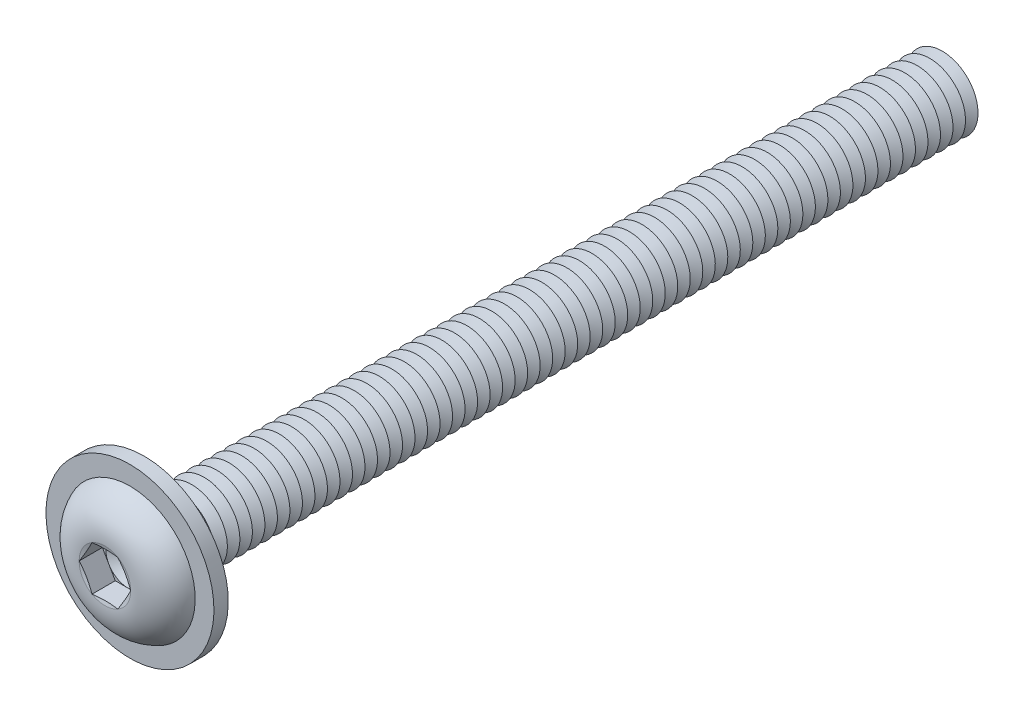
ISO-10303-21;
HEADER;
FILE_DESCRIPTION(('STEP AP214'),'2;1');
FILE_NAME('part.step','',(''),(''),'','','');
FILE_SCHEMA(('AUTOMOTIVE_DESIGN { 1 0 10303 214 1 1 1 1 }'));
ENDSEC;
DATA;
#1=APPLICATION_CONTEXT('core data for automotive mechanical design processes');
#2=APPLICATION_PROTOCOL_DEFINITION('international standard','automotive_design',2000,#1);
#3=PRODUCT_CONTEXT('',#1,'mechanical');
#4=PRODUCT('Part','Part','',(#3));
#5=PRODUCT_RELATED_PRODUCT_CATEGORY('part','',(#4));
#6=PRODUCT_DEFINITION_FORMATION('','',#4);
#7=PRODUCT_DEFINITION_CONTEXT('part definition',#1,'design');
#8=PRODUCT_DEFINITION('design','',#6,#7);
#9=PRODUCT_DEFINITION_SHAPE('','',#8);
#10=(LENGTH_UNIT() NAMED_UNIT(*) SI_UNIT(.MILLI.,.METRE.));
#11=(NAMED_UNIT(*) PLANE_ANGLE_UNIT() SI_UNIT($,.RADIAN.));
#12=(NAMED_UNIT(*) SI_UNIT($,.STERADIAN.) SOLID_ANGLE_UNIT());
#13=UNCERTAINTY_MEASURE_WITH_UNIT(LENGTH_MEASURE(1.E-05),#10,'distance_accuracy_value','');
#14=(GEOMETRIC_REPRESENTATION_CONTEXT(3) GLOBAL_UNCERTAINTY_ASSIGNED_CONTEXT((#13)) GLOBAL_UNIT_ASSIGNED_CONTEXT((#10,
#11,#12)) REPRESENTATION_CONTEXT('',''));
#15=CARTESIAN_POINT('',(0.,0.,0.));
#16=DIRECTION('',(0.,0.,1.));
#17=DIRECTION('',(1.,0.,0.));
#18=AXIS2_PLACEMENT_3D('',#15,#16,#17);
#19=CARTESIAN_POINT('',(0.,0.,-42.55));
#20=DIRECTION('',(0.,0.,1.));
#21=DIRECTION('',(0.,-1.,0.));
#22=AXIS2_PLACEMENT_3D('',#19,#20,#21);
#23=CONICAL_SURFACE('',#22,1.99999999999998,1.04719755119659);
#24=CARTESIAN_POINT('',(0.,0.,-42.9));
#25=DIRECTION('',(0.,0.,1.));
#26=DIRECTION('',(0.,-1.,0.));
#27=AXIS2_PLACEMENT_3D('',#24,#25,#26);
#28=CIRCLE('',#27,1.39378221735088);
#29=CARTESIAN_POINT('',(0.,-1.39378221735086,-42.9));
#30=VERTEX_POINT('',#29);
#31=EDGE_CURVE('E721',#30,#30,#28,.T.);
#32=ORIENTED_EDGE('',*,*,#31,.T.);
#33=EDGE_LOOP('',(#32));
#34=FACE_BOUND('',#33,.T.);
#35=CARTESIAN_POINT('',(0.,0.,-42.55));
#36=DIRECTION('',(0.,0.,1.));
#37=DIRECTION('',(0.,-1.,0.));
#38=AXIS2_PLACEMENT_3D('',#35,#36,#37);
#39=CIRCLE('',#38,1.99999999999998);
#40=CARTESIAN_POINT('',(0.,-1.99999999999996,-42.55));
#41=VERTEX_POINT('',#40);
#42=EDGE_CURVE('E717',#41,#41,#39,.T.);
#43=ORIENTED_EDGE('',*,*,#42,.F.);
#44=EDGE_LOOP('',(#43));
#45=FACE_BOUND('',#44,.T.);
#46=ADVANCED_FACE('F39',(#34,#45),#23,.T.);
#47=CARTESIAN_POINT('',(0.,0.,-42.9));
#48=DIRECTION('',(0.,0.,-1.));
#49=DIRECTION('',(0.,1.,0.));
#50=AXIS2_PLACEMENT_3D('',#47,#48,#49);
#51=CONICAL_SURFACE('',#50,1.39378221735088,1.0471975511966);
#52=CARTESIAN_POINT('',(0.,0.,-43.25));
#53=DIRECTION('',(0.,0.,1.));
#54=DIRECTION('',(0.,-1.,0.));
#55=AXIS2_PLACEMENT_3D('',#52,#53,#54);
#56=CIRCLE('',#55,1.99999999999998);
#57=CARTESIAN_POINT('',(0.,-1.99999999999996,-43.25));
#58=VERTEX_POINT('',#57);
#59=EDGE_CURVE('E725',#58,#58,#56,.T.);
#60=ORIENTED_EDGE('',*,*,#59,.T.);
#61=EDGE_LOOP('',(#60));
#62=FACE_BOUND('',#61,.T.);
#63=ORIENTED_EDGE('',*,*,#31,.F.);
#64=EDGE_LOOP('',(#63));
#65=FACE_BOUND('',#64,.T.);
#66=ADVANCED_FACE('F845',(#62,#65),#51,.T.);
#67=CARTESIAN_POINT('',(0.,2.,-45.));
#68=DIRECTION('',(0.,0.,-1.));
#69=DIRECTION('',(0.,1.,0.));
#70=AXIS2_PLACEMENT_3D('',#67,#68,#69);
#71=PLANE('',#70);
#72=CARTESIAN_POINT('',(0.,0.,-45.));
#73=DIRECTION('',(0.,0.,1.));
#74=DIRECTION('',(0.,-1.,0.));
#75=AXIS2_PLACEMENT_3D('',#72,#73,#74);
#76=CIRCLE('',#75,1.39378221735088);
#77=CARTESIAN_POINT('',(0.,-1.39378221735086,-45.));
#78=VERTEX_POINT('',#77);
#79=EDGE_CURVE('E745',#78,#78,#76,.T.);
#80=ORIENTED_EDGE('',*,*,#79,.F.);
#81=EDGE_LOOP('',(#80));
#82=FACE_BOUND('',#81,.T.);
#83=ADVANCED_FACE('F851',(#82),#71,.T.);
#84=CARTESIAN_POINT('',(0.,0.,-44.65));
#85=DIRECTION('',(0.,0.,1.));
#86=DIRECTION('',(0.,-1.,0.));
#87=AXIS2_PLACEMENT_3D('',#84,#85,#86);
#88=CONICAL_SURFACE('',#87,1.99999999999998,1.04719755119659);
#89=ORIENTED_EDGE('',*,*,#79,.T.);
#90=EDGE_LOOP('',(#89));
#91=FACE_BOUND('',#90,.T.);
#92=CARTESIAN_POINT('',(0.,0.,-44.65));
#93=DIRECTION('',(0.,0.,1.));
#94=DIRECTION('',(0.,-1.,0.));
#95=AXIS2_PLACEMENT_3D('',#92,#93,#94);
#96=CIRCLE('',#95,1.99999999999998);
#97=CARTESIAN_POINT('',(0.,-1.99999999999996,-44.65));
#98=VERTEX_POINT('',#97);
#99=EDGE_CURVE('E741',#98,#98,#96,.T.);
#100=ORIENTED_EDGE('',*,*,#99,.F.);
#101=EDGE_LOOP('',(#100));
#102=FACE_BOUND('',#101,.T.);
#103=ADVANCED_FACE('F870',(#91,#102),#88,.T.);
#104=CARTESIAN_POINT('',(0.,0.,-44.3));
#105=DIRECTION('',(0.,0.,-1.));
#106=DIRECTION('',(0.,1.,0.));
#107=AXIS2_PLACEMENT_3D('',#104,#105,#106);
#108=CONICAL_SURFACE('',#107,1.39378221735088,1.0471975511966);
#109=ORIENTED_EDGE('',*,*,#99,.T.);
#110=EDGE_LOOP('',(#109));
#111=FACE_BOUND('',#110,.T.);
#112=CARTESIAN_POINT('',(0.,0.,-44.3));
#113=DIRECTION('',(0.,0.,1.));
#114=DIRECTION('',(0.,-1.,0.));
#115=AXIS2_PLACEMENT_3D('',#112,#113,#114);
#116=CIRCLE('',#115,1.39378221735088);
#117=CARTESIAN_POINT('',(0.,-1.39378221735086,-44.3));
#118=VERTEX_POINT('',#117);
#119=EDGE_CURVE('E737',#118,#118,#116,.T.);
#120=ORIENTED_EDGE('',*,*,#119,.F.);
#121=EDGE_LOOP('',(#120));
#122=FACE_BOUND('',#121,.T.);
#123=ADVANCED_FACE('F867',(#111,#122),#108,.T.);
#124=CARTESIAN_POINT('',(0.,0.,-43.95));
#125=DIRECTION('',(0.,0.,1.));
#126=DIRECTION('',(0.,-1.,0.));
#127=AXIS2_PLACEMENT_3D('',#124,#125,#126);
#128=CONICAL_SURFACE('',#127,1.99999999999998,1.04719755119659);
#129=ORIENTED_EDGE('',*,*,#119,.T.);
#130=EDGE_LOOP('',(#129));
#131=FACE_BOUND('',#130,.T.);
#132=CARTESIAN_POINT('',(0.,0.,-43.95));
#133=DIRECTION('',(0.,0.,1.));
#134=DIRECTION('',(0.,-1.,0.));
#135=AXIS2_PLACEMENT_3D('',#132,#133,#134);
#136=CIRCLE('',#135,1.99999999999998);
#137=CARTESIAN_POINT('',(0.,-1.99999999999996,-43.95));
#138=VERTEX_POINT('',#137);
#139=EDGE_CURVE('E733',#138,#138,#136,.T.);
#140=ORIENTED_EDGE('',*,*,#139,.F.);
#141=EDGE_LOOP('',(#140));
#142=FACE_BOUND('',#141,.T.);
#143=ADVANCED_FACE('F861',(#131,#142),#128,.T.);
#144=CARTESIAN_POINT('',(0.,0.,-43.6));
#145=DIRECTION('',(0.,0.,-1.));
#146=DIRECTION('',(0.,1.,0.));
#147=AXIS2_PLACEMENT_3D('',#144,#145,#146);
#148=CONICAL_SURFACE('',#147,1.39378221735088,1.0471975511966);
#149=ORIENTED_EDGE('',*,*,#139,.T.);
#150=EDGE_LOOP('',(#149));
#151=FACE_BOUND('',#150,.T.);
#152=CARTESIAN_POINT('',(0.,0.,-43.6));
#153=DIRECTION('',(0.,0.,1.));
#154=DIRECTION('',(0.,-1.,0.));
#155=AXIS2_PLACEMENT_3D('',#152,#153,#154);
#156=CIRCLE('',#155,1.39378221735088);
#157=CARTESIAN_POINT('',(0.,-1.39378221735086,-43.6));
#158=VERTEX_POINT('',#157);
#159=EDGE_CURVE('E729',#158,#158,#156,.T.);
#160=ORIENTED_EDGE('',*,*,#159,.F.);
#161=EDGE_LOOP('',(#160));
#162=FACE_BOUND('',#161,.T.);
#163=ADVANCED_FACE('F857',(#151,#162),#148,.T.);
#164=CARTESIAN_POINT('',(0.,0.,-43.25));
#165=DIRECTION('',(0.,0.,1.));
#166=DIRECTION('',(0.,-1.,0.));
#167=AXIS2_PLACEMENT_3D('',#164,#165,#166);
#168=CONICAL_SURFACE('',#167,1.99999999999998,1.04719755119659);
#169=ORIENTED_EDGE('',*,*,#159,.T.);
#170=EDGE_LOOP('',(#169));
#171=FACE_BOUND('',#170,.T.);
#172=ORIENTED_EDGE('',*,*,#59,.F.);
#173=EDGE_LOOP('',(#172));
#174=FACE_BOUND('',#173,.T.);
#175=ADVANCED_FACE('F860',(#171,#174),#168,.T.);
#176=CARTESIAN_POINT('',(0.,0.,-41.85));
#177=DIRECTION('',(0.,0.,1.));
#178=DIRECTION('',(0.,-1.,0.));
#179=AXIS2_PLACEMENT_3D('',#176,#177,#178);
#180=CONICAL_SURFACE('',#179,1.99999999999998,1.04719755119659);
#181=CARTESIAN_POINT('',(0.,0.,-42.2));
#182=DIRECTION('',(0.,0.,1.));
#183=DIRECTION('',(0.,-1.,0.));
#184=AXIS2_PLACEMENT_3D('',#181,#182,#183);
#185=CIRCLE('',#184,1.39378221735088);
#186=CARTESIAN_POINT('',(0.,-1.39378221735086,-42.2));
#187=VERTEX_POINT('',#186);
#188=EDGE_CURVE('E713',#187,#187,#185,.T.);
#189=ORIENTED_EDGE('',*,*,#188,.T.);
#190=EDGE_LOOP('',(#189));
#191=FACE_BOUND('',#190,.T.);
#192=CARTESIAN_POINT('',(0.,0.,-41.85));
#193=DIRECTION('',(0.,0.,1.));
#194=DIRECTION('',(0.,-1.,0.));
#195=AXIS2_PLACEMENT_3D('',#192,#193,#194);
#196=CIRCLE('',#195,1.99999999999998);
#197=CARTESIAN_POINT('',(0.,-1.99999999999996,-41.85));
#198=VERTEX_POINT('',#197);
#199=EDGE_CURVE('E709',#198,#198,#196,.T.);
#200=ORIENTED_EDGE('',*,*,#199,.F.);
#201=EDGE_LOOP('',(#200));
#202=FACE_BOUND('',#201,.T.);
#203=ADVANCED_FACE('F865',(#191,#202),#180,.T.);
#204=CARTESIAN_POINT('',(0.,0.,-42.2));
#205=DIRECTION('',(0.,0.,-1.));
#206=DIRECTION('',(0.,1.,0.));
#207=AXIS2_PLACEMENT_3D('',#204,#205,#206);
#208=CONICAL_SURFACE('',#207,1.39378221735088,1.0471975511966);
#209=ORIENTED_EDGE('',*,*,#42,.T.);
#210=EDGE_LOOP('',(#209));
#211=FACE_BOUND('',#210,.T.);
#212=ORIENTED_EDGE('',*,*,#188,.F.);
#213=EDGE_LOOP('',(#212));
#214=FACE_BOUND('',#213,.T.);
#215=ADVANCED_FACE('F916',(#211,#214),#208,.T.);
#216=CARTESIAN_POINT('',(0.,0.,-41.15));
#217=DIRECTION('',(0.,0.,1.));
#218=DIRECTION('',(0.,-1.,0.));
#219=AXIS2_PLACEMENT_3D('',#216,#217,#218);
#220=CONICAL_SURFACE('',#219,1.99999999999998,1.04719755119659);
#221=CARTESIAN_POINT('',(0.,0.,-41.5));
#222=DIRECTION('',(0.,0.,1.));
#223=DIRECTION('',(0.,-1.,0.));
#224=AXIS2_PLACEMENT_3D('',#221,#222,#223);
#225=CIRCLE('',#224,1.39378221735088);
#226=CARTESIAN_POINT('',(0.,-1.39378221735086,-41.5));
#227=VERTEX_POINT('',#226);
#228=EDGE_CURVE('E705',#227,#227,#225,.T.);
#229=ORIENTED_EDGE('',*,*,#228,.T.);
#230=EDGE_LOOP('',(#229));
#231=FACE_BOUND('',#230,.T.);
#232=CARTESIAN_POINT('',(0.,0.,-41.15));
#233=DIRECTION('',(0.,0.,1.));
#234=DIRECTION('',(0.,-1.,0.));
#235=AXIS2_PLACEMENT_3D('',#232,#233,#234);
#236=CIRCLE('',#235,1.99999999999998);
#237=CARTESIAN_POINT('',(0.,-1.99999999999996,-41.15));
#238=VERTEX_POINT('',#237);
#239=EDGE_CURVE('E701',#238,#238,#236,.T.);
#240=ORIENTED_EDGE('',*,*,#239,.F.);
#241=EDGE_LOOP('',(#240));
#242=FACE_BOUND('',#241,.T.);
#243=ADVANCED_FACE('F922',(#231,#242),#220,.T.);
#244=CARTESIAN_POINT('',(0.,0.,-41.5));
#245=DIRECTION('',(0.,0.,-1.));
#246=DIRECTION('',(0.,1.,0.));
#247=AXIS2_PLACEMENT_3D('',#244,#245,#246);
#248=CONICAL_SURFACE('',#247,1.39378221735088,1.0471975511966);
#249=ORIENTED_EDGE('',*,*,#199,.T.);
#250=EDGE_LOOP('',(#249));
#251=FACE_BOUND('',#250,.T.);
#252=ORIENTED_EDGE('',*,*,#228,.F.);
#253=EDGE_LOOP('',(#252));
#254=FACE_BOUND('',#253,.T.);
#255=ADVANCED_FACE('F929',(#251,#254),#248,.T.);
#256=CARTESIAN_POINT('',(0.,0.,-40.45));
#257=DIRECTION('',(0.,0.,1.));
#258=DIRECTION('',(0.,-1.,0.));
#259=AXIS2_PLACEMENT_3D('',#256,#257,#258);
#260=CONICAL_SURFACE('',#259,1.99999999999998,1.04719755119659);
#261=CARTESIAN_POINT('',(0.,0.,-40.8));
#262=DIRECTION('',(0.,0.,1.));
#263=DIRECTION('',(0.,-1.,0.));
#264=AXIS2_PLACEMENT_3D('',#261,#262,#263);
#265=CIRCLE('',#264,1.39378221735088);
#266=CARTESIAN_POINT('',(0.,-1.39378221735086,-40.8));
#267=VERTEX_POINT('',#266);
#268=EDGE_CURVE('E697',#267,#267,#265,.T.);
#269=ORIENTED_EDGE('',*,*,#268,.T.);
#270=EDGE_LOOP('',(#269));
#271=FACE_BOUND('',#270,.T.);
#272=CARTESIAN_POINT('',(0.,0.,-40.45));
#273=DIRECTION('',(0.,0.,1.));
#274=DIRECTION('',(0.,-1.,0.));
#275=AXIS2_PLACEMENT_3D('',#272,#273,#274);
#276=CIRCLE('',#275,1.99999999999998);
#277=CARTESIAN_POINT('',(0.,-1.99999999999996,-40.45));
#278=VERTEX_POINT('',#277);
#279=EDGE_CURVE('E693',#278,#278,#276,.T.);
#280=ORIENTED_EDGE('',*,*,#279,.F.);
#281=EDGE_LOOP('',(#280));
#282=FACE_BOUND('',#281,.T.);
#283=ADVANCED_FACE('F936',(#271,#282),#260,.T.);
#284=CARTESIAN_POINT('',(0.,0.,-40.8));
#285=DIRECTION('',(0.,0.,-1.));
#286=DIRECTION('',(0.,1.,0.));
#287=AXIS2_PLACEMENT_3D('',#284,#285,#286);
#288=CONICAL_SURFACE('',#287,1.39378221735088,1.0471975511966);
#289=ORIENTED_EDGE('',*,*,#239,.T.);
#290=EDGE_LOOP('',(#289));
#291=FACE_BOUND('',#290,.T.);
#292=ORIENTED_EDGE('',*,*,#268,.F.);
#293=EDGE_LOOP('',(#292));
#294=FACE_BOUND('',#293,.T.);
#295=ADVANCED_FACE('F943',(#291,#294),#288,.T.);
#296=CARTESIAN_POINT('',(0.,0.,-39.75));
#297=DIRECTION('',(0.,0.,1.));
#298=DIRECTION('',(0.,-1.,0.));
#299=AXIS2_PLACEMENT_3D('',#296,#297,#298);
#300=CONICAL_SURFACE('',#299,1.99999999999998,1.04719755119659);
#301=CARTESIAN_POINT('',(0.,0.,-40.1));
#302=DIRECTION('',(0.,0.,1.));
#303=DIRECTION('',(0.,-1.,0.));
#304=AXIS2_PLACEMENT_3D('',#301,#302,#303);
#305=CIRCLE('',#304,1.39378221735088);
#306=CARTESIAN_POINT('',(0.,-1.39378221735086,-40.1));
#307=VERTEX_POINT('',#306);
#308=EDGE_CURVE('E689',#307,#307,#305,.T.);
#309=ORIENTED_EDGE('',*,*,#308,.T.);
#310=EDGE_LOOP('',(#309));
#311=FACE_BOUND('',#310,.T.);
#312=CARTESIAN_POINT('',(0.,0.,-39.75));
#313=DIRECTION('',(0.,0.,1.));
#314=DIRECTION('',(0.,-1.,0.));
#315=AXIS2_PLACEMENT_3D('',#312,#313,#314);
#316=CIRCLE('',#315,1.99999999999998);
#317=CARTESIAN_POINT('',(0.,-1.99999999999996,-39.75));
#318=VERTEX_POINT('',#317);
#319=EDGE_CURVE('E685',#318,#318,#316,.T.);
#320=ORIENTED_EDGE('',*,*,#319,.F.);
#321=EDGE_LOOP('',(#320));
#322=FACE_BOUND('',#321,.T.);
#323=ADVANCED_FACE('F950',(#311,#322),#300,.T.);
#324=CARTESIAN_POINT('',(0.,0.,-40.1));
#325=DIRECTION('',(0.,0.,-1.));
#326=DIRECTION('',(0.,1.,0.));
#327=AXIS2_PLACEMENT_3D('',#324,#325,#326);
#328=CONICAL_SURFACE('',#327,1.39378221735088,1.0471975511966);
#329=ORIENTED_EDGE('',*,*,#279,.T.);
#330=EDGE_LOOP('',(#329));
#331=FACE_BOUND('',#330,.T.);
#332=ORIENTED_EDGE('',*,*,#308,.F.);
#333=EDGE_LOOP('',(#332));
#334=FACE_BOUND('',#333,.T.);
#335=ADVANCED_FACE('F957',(#331,#334),#328,.T.);
#336=CARTESIAN_POINT('',(0.,0.,-39.05));
#337=DIRECTION('',(0.,0.,1.));
#338=DIRECTION('',(0.,-1.,0.));
#339=AXIS2_PLACEMENT_3D('',#336,#337,#338);
#340=CONICAL_SURFACE('',#339,1.99999999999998,1.04719755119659);
#341=CARTESIAN_POINT('',(0.,0.,-39.4));
#342=DIRECTION('',(0.,0.,1.));
#343=DIRECTION('',(0.,-1.,0.));
#344=AXIS2_PLACEMENT_3D('',#341,#342,#343);
#345=CIRCLE('',#344,1.39378221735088);
#346=CARTESIAN_POINT('',(0.,-1.39378221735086,-39.4));
#347=VERTEX_POINT('',#346);
#348=EDGE_CURVE('E681',#347,#347,#345,.T.);
#349=ORIENTED_EDGE('',*,*,#348,.T.);
#350=EDGE_LOOP('',(#349));
#351=FACE_BOUND('',#350,.T.);
#352=CARTESIAN_POINT('',(0.,0.,-39.05));
#353=DIRECTION('',(0.,0.,1.));
#354=DIRECTION('',(0.,-1.,0.));
#355=AXIS2_PLACEMENT_3D('',#352,#353,#354);
#356=CIRCLE('',#355,1.99999999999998);
#357=CARTESIAN_POINT('',(0.,-1.99999999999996,-39.05));
#358=VERTEX_POINT('',#357);
#359=EDGE_CURVE('E677',#358,#358,#356,.T.);
#360=ORIENTED_EDGE('',*,*,#359,.F.);
#361=EDGE_LOOP('',(#360));
#362=FACE_BOUND('',#361,.T.);
#363=ADVANCED_FACE('F964',(#351,#362),#340,.T.);
#364=CARTESIAN_POINT('',(0.,0.,-39.4));
#365=DIRECTION('',(0.,0.,-1.));
#366=DIRECTION('',(0.,1.,0.));
#367=AXIS2_PLACEMENT_3D('',#364,#365,#366);
#368=CONICAL_SURFACE('',#367,1.39378221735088,1.0471975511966);
#369=ORIENTED_EDGE('',*,*,#319,.T.);
#370=EDGE_LOOP('',(#369));
#371=FACE_BOUND('',#370,.T.);
#372=ORIENTED_EDGE('',*,*,#348,.F.);
#373=EDGE_LOOP('',(#372));
#374=FACE_BOUND('',#373,.T.);
#375=ADVANCED_FACE('F971',(#371,#374),#368,.T.);
#376=CARTESIAN_POINT('',(0.,0.,-38.35));
#377=DIRECTION('',(0.,0.,1.));
#378=DIRECTION('',(0.,-1.,0.));
#379=AXIS2_PLACEMENT_3D('',#376,#377,#378);
#380=CONICAL_SURFACE('',#379,1.99999999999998,1.04719755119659);
#381=CARTESIAN_POINT('',(0.,0.,-38.7));
#382=DIRECTION('',(0.,0.,1.));
#383=DIRECTION('',(0.,-1.,0.));
#384=AXIS2_PLACEMENT_3D('',#381,#382,#383);
#385=CIRCLE('',#384,1.39378221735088);
#386=CARTESIAN_POINT('',(0.,-1.39378221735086,-38.7));
#387=VERTEX_POINT('',#386);
#388=EDGE_CURVE('E673',#387,#387,#385,.T.);
#389=ORIENTED_EDGE('',*,*,#388,.T.);
#390=EDGE_LOOP('',(#389));
#391=FACE_BOUND('',#390,.T.);
#392=CARTESIAN_POINT('',(0.,0.,-38.35));
#393=DIRECTION('',(0.,0.,1.));
#394=DIRECTION('',(0.,-1.,0.));
#395=AXIS2_PLACEMENT_3D('',#392,#393,#394);
#396=CIRCLE('',#395,1.99999999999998);
#397=CARTESIAN_POINT('',(0.,-1.99999999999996,-38.35));
#398=VERTEX_POINT('',#397);
#399=EDGE_CURVE('E669',#398,#398,#396,.T.);
#400=ORIENTED_EDGE('',*,*,#399,.F.);
#401=EDGE_LOOP('',(#400));
#402=FACE_BOUND('',#401,.T.);
#403=ADVANCED_FACE('F978',(#391,#402),#380,.T.);
#404=CARTESIAN_POINT('',(0.,0.,-38.7));
#405=DIRECTION('',(0.,0.,-1.));
#406=DIRECTION('',(0.,1.,0.));
#407=AXIS2_PLACEMENT_3D('',#404,#405,#406);
#408=CONICAL_SURFACE('',#407,1.39378221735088,1.0471975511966);
#409=ORIENTED_EDGE('',*,*,#359,.T.);
#410=EDGE_LOOP('',(#409));
#411=FACE_BOUND('',#410,.T.);
#412=ORIENTED_EDGE('',*,*,#388,.F.);
#413=EDGE_LOOP('',(#412));
#414=FACE_BOUND('',#413,.T.);
#415=ADVANCED_FACE('F985',(#411,#414),#408,.T.);
#416=CARTESIAN_POINT('',(0.,0.,-37.65));
#417=DIRECTION('',(0.,0.,1.));
#418=DIRECTION('',(0.,-1.,0.));
#419=AXIS2_PLACEMENT_3D('',#416,#417,#418);
#420=CONICAL_SURFACE('',#419,1.99999999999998,1.04719755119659);
#421=CARTESIAN_POINT('',(0.,0.,-38.));
#422=DIRECTION('',(0.,0.,1.));
#423=DIRECTION('',(0.,-1.,0.));
#424=AXIS2_PLACEMENT_3D('',#421,#422,#423);
#425=CIRCLE('',#424,1.39378221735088);
#426=CARTESIAN_POINT('',(0.,-1.39378221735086,-38.));
#427=VERTEX_POINT('',#426);
#428=EDGE_CURVE('E665',#427,#427,#425,.T.);
#429=ORIENTED_EDGE('',*,*,#428,.T.);
#430=EDGE_LOOP('',(#429));
#431=FACE_BOUND('',#430,.T.);
#432=CARTESIAN_POINT('',(0.,0.,-37.65));
#433=DIRECTION('',(0.,0.,1.));
#434=DIRECTION('',(0.,-1.,0.));
#435=AXIS2_PLACEMENT_3D('',#432,#433,#434);
#436=CIRCLE('',#435,1.99999999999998);
#437=CARTESIAN_POINT('',(0.,-1.99999999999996,-37.65));
#438=VERTEX_POINT('',#437);
#439=EDGE_CURVE('E661',#438,#438,#436,.T.);
#440=ORIENTED_EDGE('',*,*,#439,.F.);
#441=EDGE_LOOP('',(#440));
#442=FACE_BOUND('',#441,.T.);
#443=ADVANCED_FACE('F992',(#431,#442),#420,.T.);
#444=CARTESIAN_POINT('',(0.,0.,-38.));
#445=DIRECTION('',(0.,0.,-1.));
#446=DIRECTION('',(0.,1.,0.));
#447=AXIS2_PLACEMENT_3D('',#444,#445,#446);
#448=CONICAL_SURFACE('',#447,1.39378221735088,1.0471975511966);
#449=ORIENTED_EDGE('',*,*,#399,.T.);
#450=EDGE_LOOP('',(#449));
#451=FACE_BOUND('',#450,.T.);
#452=ORIENTED_EDGE('',*,*,#428,.F.);
#453=EDGE_LOOP('',(#452));
#454=FACE_BOUND('',#453,.T.);
#455=ADVANCED_FACE('F999',(#451,#454),#448,.T.);
#456=CARTESIAN_POINT('',(0.,0.,-36.95));
#457=DIRECTION('',(0.,0.,1.));
#458=DIRECTION('',(0.,-1.,0.));
#459=AXIS2_PLACEMENT_3D('',#456,#457,#458);
#460=CONICAL_SURFACE('',#459,1.99999999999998,1.04719755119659);
#461=CARTESIAN_POINT('',(0.,0.,-37.3));
#462=DIRECTION('',(0.,0.,1.));
#463=DIRECTION('',(0.,-1.,0.));
#464=AXIS2_PLACEMENT_3D('',#461,#462,#463);
#465=CIRCLE('',#464,1.39378221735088);
#466=CARTESIAN_POINT('',(0.,-1.39378221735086,-37.3));
#467=VERTEX_POINT('',#466);
#468=EDGE_CURVE('E657',#467,#467,#465,.T.);
#469=ORIENTED_EDGE('',*,*,#468,.T.);
#470=EDGE_LOOP('',(#469));
#471=FACE_BOUND('',#470,.T.);
#472=CARTESIAN_POINT('',(0.,0.,-36.95));
#473=DIRECTION('',(0.,0.,1.));
#474=DIRECTION('',(0.,-1.,0.));
#475=AXIS2_PLACEMENT_3D('',#472,#473,#474);
#476=CIRCLE('',#475,1.99999999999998);
#477=CARTESIAN_POINT('',(0.,-1.99999999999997,-36.95));
#478=VERTEX_POINT('',#477);
#479=EDGE_CURVE('E653',#478,#478,#476,.T.);
#480=ORIENTED_EDGE('',*,*,#479,.F.);
#481=EDGE_LOOP('',(#480));
#482=FACE_BOUND('',#481,.T.);
#483=ADVANCED_FACE('F1006',(#471,#482),#460,.T.);
#484=CARTESIAN_POINT('',(0.,0.,-37.3));
#485=DIRECTION('',(0.,0.,-1.));
#486=DIRECTION('',(0.,1.,0.));
#487=AXIS2_PLACEMENT_3D('',#484,#485,#486);
#488=CONICAL_SURFACE('',#487,1.39378221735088,1.0471975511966);
#489=ORIENTED_EDGE('',*,*,#439,.T.);
#490=EDGE_LOOP('',(#489));
#491=FACE_BOUND('',#490,.T.);
#492=ORIENTED_EDGE('',*,*,#468,.F.);
#493=EDGE_LOOP('',(#492));
#494=FACE_BOUND('',#493,.T.);
#495=ADVANCED_FACE('F1013',(#491,#494),#488,.T.);
#496=CARTESIAN_POINT('',(0.,0.,-36.25));
#497=DIRECTION('',(0.,0.,1.));
#498=DIRECTION('',(0.,-1.,0.));
#499=AXIS2_PLACEMENT_3D('',#496,#497,#498);
#500=CONICAL_SURFACE('',#499,1.99999999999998,1.04719755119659);
#501=CARTESIAN_POINT('',(0.,0.,-36.6));
#502=DIRECTION('',(0.,0.,1.));
#503=DIRECTION('',(0.,-1.,0.));
#504=AXIS2_PLACEMENT_3D('',#501,#502,#503);
#505=CIRCLE('',#504,1.39378221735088);
#506=CARTESIAN_POINT('',(0.,-1.39378221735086,-36.6));
#507=VERTEX_POINT('',#506);
#508=EDGE_CURVE('E649',#507,#507,#505,.T.);
#509=ORIENTED_EDGE('',*,*,#508,.T.);
#510=EDGE_LOOP('',(#509));
#511=FACE_BOUND('',#510,.T.);
#512=CARTESIAN_POINT('',(0.,0.,-36.25));
#513=DIRECTION('',(0.,0.,1.));
#514=DIRECTION('',(0.,-1.,0.));
#515=AXIS2_PLACEMENT_3D('',#512,#513,#514);
#516=CIRCLE('',#515,1.99999999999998);
#517=CARTESIAN_POINT('',(0.,-1.99999999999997,-36.25));
#518=VERTEX_POINT('',#517);
#519=EDGE_CURVE('E645',#518,#518,#516,.T.);
#520=ORIENTED_EDGE('',*,*,#519,.F.);
#521=EDGE_LOOP('',(#520));
#522=FACE_BOUND('',#521,.T.);
#523=ADVANCED_FACE('F1020',(#511,#522),#500,.T.);
#524=CARTESIAN_POINT('',(0.,0.,-36.6));
#525=DIRECTION('',(0.,0.,-1.));
#526=DIRECTION('',(0.,1.,0.));
#527=AXIS2_PLACEMENT_3D('',#524,#525,#526);
#528=CONICAL_SURFACE('',#527,1.39378221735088,1.0471975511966);
#529=ORIENTED_EDGE('',*,*,#479,.T.);
#530=EDGE_LOOP('',(#529));
#531=FACE_BOUND('',#530,.T.);
#532=ORIENTED_EDGE('',*,*,#508,.F.);
#533=EDGE_LOOP('',(#532));
#534=FACE_BOUND('',#533,.T.);
#535=ADVANCED_FACE('F1027',(#531,#534),#528,.T.);
#536=CARTESIAN_POINT('',(0.,0.,-35.55));
#537=DIRECTION('',(0.,0.,1.));
#538=DIRECTION('',(0.,-1.,0.));
#539=AXIS2_PLACEMENT_3D('',#536,#537,#538);
#540=CONICAL_SURFACE('',#539,1.99999999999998,1.04719755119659);
#541=CARTESIAN_POINT('',(0.,0.,-35.9));
#542=DIRECTION('',(0.,0.,1.));
#543=DIRECTION('',(0.,-1.,0.));
#544=AXIS2_PLACEMENT_3D('',#541,#542,#543);
#545=CIRCLE('',#544,1.39378221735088);
#546=CARTESIAN_POINT('',(0.,-1.39378221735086,-35.9));
#547=VERTEX_POINT('',#546);
#548=EDGE_CURVE('E641',#547,#547,#545,.T.);
#549=ORIENTED_EDGE('',*,*,#548,.T.);
#550=EDGE_LOOP('',(#549));
#551=FACE_BOUND('',#550,.T.);
#552=CARTESIAN_POINT('',(0.,0.,-35.55));
#553=DIRECTION('',(0.,0.,1.));
#554=DIRECTION('',(0.,-1.,0.));
#555=AXIS2_PLACEMENT_3D('',#552,#553,#554);
#556=CIRCLE('',#555,1.99999999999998);
#557=CARTESIAN_POINT('',(0.,-1.99999999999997,-35.55));
#558=VERTEX_POINT('',#557);
#559=EDGE_CURVE('E637',#558,#558,#556,.T.);
#560=ORIENTED_EDGE('',*,*,#559,.F.);
#561=EDGE_LOOP('',(#560));
#562=FACE_BOUND('',#561,.T.);
#563=ADVANCED_FACE('F1034',(#551,#562),#540,.T.);
#564=CARTESIAN_POINT('',(0.,0.,-35.9));
#565=DIRECTION('',(0.,0.,-1.));
#566=DIRECTION('',(0.,1.,0.));
#567=AXIS2_PLACEMENT_3D('',#564,#565,#566);
#568=CONICAL_SURFACE('',#567,1.39378221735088,1.0471975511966);
#569=ORIENTED_EDGE('',*,*,#519,.T.);
#570=EDGE_LOOP('',(#569));
#571=FACE_BOUND('',#570,.T.);
#572=ORIENTED_EDGE('',*,*,#548,.F.);
#573=EDGE_LOOP('',(#572));
#574=FACE_BOUND('',#573,.T.);
#575=ADVANCED_FACE('F1041',(#571,#574),#568,.T.);
#576=CARTESIAN_POINT('',(0.,0.,-34.85));
#577=DIRECTION('',(0.,0.,1.));
#578=DIRECTION('',(0.,-1.,0.));
#579=AXIS2_PLACEMENT_3D('',#576,#577,#578);
#580=CONICAL_SURFACE('',#579,1.99999999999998,1.04719755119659);
#581=CARTESIAN_POINT('',(0.,0.,-35.2));
#582=DIRECTION('',(0.,0.,1.));
#583=DIRECTION('',(0.,-1.,0.));
#584=AXIS2_PLACEMENT_3D('',#581,#582,#583);
#585=CIRCLE('',#584,1.39378221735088);
#586=CARTESIAN_POINT('',(0.,-1.39378221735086,-35.2));
#587=VERTEX_POINT('',#586);
#588=EDGE_CURVE('E633',#587,#587,#585,.T.);
#589=ORIENTED_EDGE('',*,*,#588,.T.);
#590=EDGE_LOOP('',(#589));
#591=FACE_BOUND('',#590,.T.);
#592=CARTESIAN_POINT('',(0.,0.,-34.85));
#593=DIRECTION('',(0.,0.,1.));
#594=DIRECTION('',(0.,-1.,0.));
#595=AXIS2_PLACEMENT_3D('',#592,#593,#594);
#596=CIRCLE('',#595,1.99999999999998);
#597=CARTESIAN_POINT('',(0.,-1.99999999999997,-34.85));
#598=VERTEX_POINT('',#597);
#599=EDGE_CURVE('E629',#598,#598,#596,.T.);
#600=ORIENTED_EDGE('',*,*,#599,.F.);
#601=EDGE_LOOP('',(#600));
#602=FACE_BOUND('',#601,.T.);
#603=ADVANCED_FACE('F1048',(#591,#602),#580,.T.);
#604=CARTESIAN_POINT('',(0.,0.,-35.2));
#605=DIRECTION('',(0.,0.,-1.));
#606=DIRECTION('',(0.,1.,0.));
#607=AXIS2_PLACEMENT_3D('',#604,#605,#606);
#608=CONICAL_SURFACE('',#607,1.39378221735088,1.0471975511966);
#609=ORIENTED_EDGE('',*,*,#559,.T.);
#610=EDGE_LOOP('',(#609));
#611=FACE_BOUND('',#610,.T.);
#612=ORIENTED_EDGE('',*,*,#588,.F.);
#613=EDGE_LOOP('',(#612));
#614=FACE_BOUND('',#613,.T.);
#615=ADVANCED_FACE('F1055',(#611,#614),#608,.T.);
#616=CARTESIAN_POINT('',(0.,0.,-34.15));
#617=DIRECTION('',(0.,0.,1.));
#618=DIRECTION('',(0.,-1.,0.));
#619=AXIS2_PLACEMENT_3D('',#616,#617,#618);
#620=CONICAL_SURFACE('',#619,1.99999999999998,1.04719755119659);
#621=CARTESIAN_POINT('',(0.,0.,-34.5));
#622=DIRECTION('',(0.,0.,1.));
#623=DIRECTION('',(0.,-1.,0.));
#624=AXIS2_PLACEMENT_3D('',#621,#622,#623);
#625=CIRCLE('',#624,1.39378221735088);
#626=CARTESIAN_POINT('',(0.,-1.39378221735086,-34.5));
#627=VERTEX_POINT('',#626);
#628=EDGE_CURVE('E625',#627,#627,#625,.T.);
#629=ORIENTED_EDGE('',*,*,#628,.T.);
#630=EDGE_LOOP('',(#629));
#631=FACE_BOUND('',#630,.T.);
#632=CARTESIAN_POINT('',(0.,0.,-34.15));
#633=DIRECTION('',(0.,0.,1.));
#634=DIRECTION('',(0.,-1.,0.));
#635=AXIS2_PLACEMENT_3D('',#632,#633,#634);
#636=CIRCLE('',#635,1.99999999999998);
#637=CARTESIAN_POINT('',(0.,-1.99999999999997,-34.15));
#638=VERTEX_POINT('',#637);
#639=EDGE_CURVE('E621',#638,#638,#636,.T.);
#640=ORIENTED_EDGE('',*,*,#639,.F.);
#641=EDGE_LOOP('',(#640));
#642=FACE_BOUND('',#641,.T.);
#643=ADVANCED_FACE('F1062',(#631,#642),#620,.T.);
#644=CARTESIAN_POINT('',(0.,0.,-34.5));
#645=DIRECTION('',(0.,0.,-1.));
#646=DIRECTION('',(0.,1.,0.));
#647=AXIS2_PLACEMENT_3D('',#644,#645,#646);
#648=CONICAL_SURFACE('',#647,1.39378221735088,1.0471975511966);
#649=ORIENTED_EDGE('',*,*,#599,.T.);
#650=EDGE_LOOP('',(#649));
#651=FACE_BOUND('',#650,.T.);
#652=ORIENTED_EDGE('',*,*,#628,.F.);
#653=EDGE_LOOP('',(#652));
#654=FACE_BOUND('',#653,.T.);
#655=ADVANCED_FACE('F1069',(#651,#654),#648,.T.);
#656=CARTESIAN_POINT('',(0.,0.,-33.45));
#657=DIRECTION('',(0.,0.,1.));
#658=DIRECTION('',(0.,-1.,0.));
#659=AXIS2_PLACEMENT_3D('',#656,#657,#658);
#660=CONICAL_SURFACE('',#659,1.99999999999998,1.04719755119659);
#661=CARTESIAN_POINT('',(0.,0.,-33.8));
#662=DIRECTION('',(0.,0.,1.));
#663=DIRECTION('',(0.,-1.,0.));
#664=AXIS2_PLACEMENT_3D('',#661,#662,#663);
#665=CIRCLE('',#664,1.39378221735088);
#666=CARTESIAN_POINT('',(0.,-1.39378221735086,-33.8));
#667=VERTEX_POINT('',#666);
#668=EDGE_CURVE('E617',#667,#667,#665,.T.);
#669=ORIENTED_EDGE('',*,*,#668,.T.);
#670=EDGE_LOOP('',(#669));
#671=FACE_BOUND('',#670,.T.);
#672=CARTESIAN_POINT('',(0.,0.,-33.45));
#673=DIRECTION('',(0.,0.,1.));
#674=DIRECTION('',(0.,-1.,0.));
#675=AXIS2_PLACEMENT_3D('',#672,#673,#674);
#676=CIRCLE('',#675,1.99999999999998);
#677=CARTESIAN_POINT('',(0.,-1.99999999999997,-33.45));
#678=VERTEX_POINT('',#677);
#679=EDGE_CURVE('E613',#678,#678,#676,.T.);
#680=ORIENTED_EDGE('',*,*,#679,.F.);
#681=EDGE_LOOP('',(#680));
#682=FACE_BOUND('',#681,.T.);
#683=ADVANCED_FACE('F1076',(#671,#682),#660,.T.);
#684=CARTESIAN_POINT('',(0.,0.,-33.8));
#685=DIRECTION('',(0.,0.,-1.));
#686=DIRECTION('',(0.,1.,0.));
#687=AXIS2_PLACEMENT_3D('',#684,#685,#686);
#688=CONICAL_SURFACE('',#687,1.39378221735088,1.0471975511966);
#689=ORIENTED_EDGE('',*,*,#639,.T.);
#690=EDGE_LOOP('',(#689));
#691=FACE_BOUND('',#690,.T.);
#692=ORIENTED_EDGE('',*,*,#668,.F.);
#693=EDGE_LOOP('',(#692));
#694=FACE_BOUND('',#693,.T.);
#695=ADVANCED_FACE('F1083',(#691,#694),#688,.T.);
#696=CARTESIAN_POINT('',(0.,0.,-32.75));
#697=DIRECTION('',(0.,0.,1.));
#698=DIRECTION('',(0.,-1.,0.));
#699=AXIS2_PLACEMENT_3D('',#696,#697,#698);
#700=CONICAL_SURFACE('',#699,1.99999999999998,1.04719755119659);
#701=CARTESIAN_POINT('',(0.,0.,-33.1));
#702=DIRECTION('',(0.,0.,1.));
#703=DIRECTION('',(0.,-1.,0.));
#704=AXIS2_PLACEMENT_3D('',#701,#702,#703);
#705=CIRCLE('',#704,1.39378221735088);
#706=CARTESIAN_POINT('',(0.,-1.39378221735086,-33.1));
#707=VERTEX_POINT('',#706);
#708=EDGE_CURVE('E609',#707,#707,#705,.T.);
#709=ORIENTED_EDGE('',*,*,#708,.T.);
#710=EDGE_LOOP('',(#709));
#711=FACE_BOUND('',#710,.T.);
#712=CARTESIAN_POINT('',(0.,0.,-32.75));
#713=DIRECTION('',(0.,0.,1.));
#714=DIRECTION('',(0.,-1.,0.));
#715=AXIS2_PLACEMENT_3D('',#712,#713,#714);
#716=CIRCLE('',#715,1.99999999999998);
#717=CARTESIAN_POINT('',(0.,-1.99999999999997,-32.75));
#718=VERTEX_POINT('',#717);
#719=EDGE_CURVE('E605',#718,#718,#716,.T.);
#720=ORIENTED_EDGE('',*,*,#719,.F.);
#721=EDGE_LOOP('',(#720));
#722=FACE_BOUND('',#721,.T.);
#723=ADVANCED_FACE('F1090',(#711,#722),#700,.T.);
#724=CARTESIAN_POINT('',(0.,0.,-33.1));
#725=DIRECTION('',(0.,0.,-1.));
#726=DIRECTION('',(0.,1.,0.));
#727=AXIS2_PLACEMENT_3D('',#724,#725,#726);
#728=CONICAL_SURFACE('',#727,1.39378221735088,1.0471975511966);
#729=ORIENTED_EDGE('',*,*,#679,.T.);
#730=EDGE_LOOP('',(#729));
#731=FACE_BOUND('',#730,.T.);
#732=ORIENTED_EDGE('',*,*,#708,.F.);
#733=EDGE_LOOP('',(#732));
#734=FACE_BOUND('',#733,.T.);
#735=ADVANCED_FACE('F1097',(#731,#734),#728,.T.);
#736=CARTESIAN_POINT('',(0.,0.,-32.05));
#737=DIRECTION('',(0.,0.,1.));
#738=DIRECTION('',(0.,-1.,0.));
#739=AXIS2_PLACEMENT_3D('',#736,#737,#738);
#740=CONICAL_SURFACE('',#739,1.99999999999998,1.04719755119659);
#741=CARTESIAN_POINT('',(0.,0.,-32.4));
#742=DIRECTION('',(0.,0.,1.));
#743=DIRECTION('',(0.,-1.,0.));
#744=AXIS2_PLACEMENT_3D('',#741,#742,#743);
#745=CIRCLE('',#744,1.39378221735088);
#746=CARTESIAN_POINT('',(0.,-1.39378221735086,-32.4));
#747=VERTEX_POINT('',#746);
#748=EDGE_CURVE('E601',#747,#747,#745,.T.);
#749=ORIENTED_EDGE('',*,*,#748,.T.);
#750=EDGE_LOOP('',(#749));
#751=FACE_BOUND('',#750,.T.);
#752=CARTESIAN_POINT('',(0.,0.,-32.05));
#753=DIRECTION('',(0.,0.,1.));
#754=DIRECTION('',(0.,-1.,0.));
#755=AXIS2_PLACEMENT_3D('',#752,#753,#754);
#756=CIRCLE('',#755,1.99999999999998);
#757=CARTESIAN_POINT('',(0.,-1.99999999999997,-32.05));
#758=VERTEX_POINT('',#757);
#759=EDGE_CURVE('E597',#758,#758,#756,.T.);
#760=ORIENTED_EDGE('',*,*,#759,.F.);
#761=EDGE_LOOP('',(#760));
#762=FACE_BOUND('',#761,.T.);
#763=ADVANCED_FACE('F1104',(#751,#762),#740,.T.);
#764=CARTESIAN_POINT('',(0.,0.,-32.4));
#765=DIRECTION('',(0.,0.,-1.));
#766=DIRECTION('',(0.,1.,0.));
#767=AXIS2_PLACEMENT_3D('',#764,#765,#766);
#768=CONICAL_SURFACE('',#767,1.39378221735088,1.0471975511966);
#769=ORIENTED_EDGE('',*,*,#719,.T.);
#770=EDGE_LOOP('',(#769));
#771=FACE_BOUND('',#770,.T.);
#772=ORIENTED_EDGE('',*,*,#748,.F.);
#773=EDGE_LOOP('',(#772));
#774=FACE_BOUND('',#773,.T.);
#775=ADVANCED_FACE('F1111',(#771,#774),#768,.T.);
#776=CARTESIAN_POINT('',(0.,0.,-31.35));
#777=DIRECTION('',(0.,0.,1.));
#778=DIRECTION('',(0.,-1.,0.));
#779=AXIS2_PLACEMENT_3D('',#776,#777,#778);
#780=CONICAL_SURFACE('',#779,1.99999999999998,1.04719755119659);
#781=CARTESIAN_POINT('',(0.,0.,-31.7));
#782=DIRECTION('',(0.,0.,1.));
#783=DIRECTION('',(0.,-1.,0.));
#784=AXIS2_PLACEMENT_3D('',#781,#782,#783);
#785=CIRCLE('',#784,1.39378221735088);
#786=CARTESIAN_POINT('',(0.,-1.39378221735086,-31.7));
#787=VERTEX_POINT('',#786);
#788=EDGE_CURVE('E593',#787,#787,#785,.T.);
#789=ORIENTED_EDGE('',*,*,#788,.T.);
#790=EDGE_LOOP('',(#789));
#791=FACE_BOUND('',#790,.T.);
#792=CARTESIAN_POINT('',(0.,0.,-31.35));
#793=DIRECTION('',(0.,0.,1.));
#794=DIRECTION('',(0.,-1.,0.));
#795=AXIS2_PLACEMENT_3D('',#792,#793,#794);
#796=CIRCLE('',#795,1.99999999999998);
#797=CARTESIAN_POINT('',(0.,-1.99999999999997,-31.35));
#798=VERTEX_POINT('',#797);
#799=EDGE_CURVE('E589',#798,#798,#796,.T.);
#800=ORIENTED_EDGE('',*,*,#799,.F.);
#801=EDGE_LOOP('',(#800));
#802=FACE_BOUND('',#801,.T.);
#803=ADVANCED_FACE('F1118',(#791,#802),#780,.T.);
#804=CARTESIAN_POINT('',(0.,0.,-31.7));
#805=DIRECTION('',(0.,0.,-1.));
#806=DIRECTION('',(0.,1.,0.));
#807=AXIS2_PLACEMENT_3D('',#804,#805,#806);
#808=CONICAL_SURFACE('',#807,1.39378221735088,1.0471975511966);
#809=ORIENTED_EDGE('',*,*,#759,.T.);
#810=EDGE_LOOP('',(#809));
#811=FACE_BOUND('',#810,.T.);
#812=ORIENTED_EDGE('',*,*,#788,.F.);
#813=EDGE_LOOP('',(#812));
#814=FACE_BOUND('',#813,.T.);
#815=ADVANCED_FACE('F1125',(#811,#814),#808,.T.);
#816=CARTESIAN_POINT('',(0.,0.,-30.65));
#817=DIRECTION('',(0.,0.,1.));
#818=DIRECTION('',(0.,-1.,0.));
#819=AXIS2_PLACEMENT_3D('',#816,#817,#818);
#820=CONICAL_SURFACE('',#819,1.99999999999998,1.04719755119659);
#821=CARTESIAN_POINT('',(0.,0.,-31.));
#822=DIRECTION('',(0.,0.,1.));
#823=DIRECTION('',(0.,-1.,0.));
#824=AXIS2_PLACEMENT_3D('',#821,#822,#823);
#825=CIRCLE('',#824,1.39378221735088);
#826=CARTESIAN_POINT('',(0.,-1.39378221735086,-31.));
#827=VERTEX_POINT('',#826);
#828=EDGE_CURVE('E585',#827,#827,#825,.T.);
#829=ORIENTED_EDGE('',*,*,#828,.T.);
#830=EDGE_LOOP('',(#829));
#831=FACE_BOUND('',#830,.T.);
#832=CARTESIAN_POINT('',(0.,0.,-30.65));
#833=DIRECTION('',(0.,0.,1.));
#834=DIRECTION('',(0.,-1.,0.));
#835=AXIS2_PLACEMENT_3D('',#832,#833,#834);
#836=CIRCLE('',#835,1.99999999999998);
#837=CARTESIAN_POINT('',(0.,-1.99999999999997,-30.65));
#838=VERTEX_POINT('',#837);
#839=EDGE_CURVE('E581',#838,#838,#836,.T.);
#840=ORIENTED_EDGE('',*,*,#839,.F.);
#841=EDGE_LOOP('',(#840));
#842=FACE_BOUND('',#841,.T.);
#843=ADVANCED_FACE('F1132',(#831,#842),#820,.T.);
#844=CARTESIAN_POINT('',(0.,0.,-31.));
#845=DIRECTION('',(0.,0.,-1.));
#846=DIRECTION('',(0.,1.,0.));
#847=AXIS2_PLACEMENT_3D('',#844,#845,#846);
#848=CONICAL_SURFACE('',#847,1.39378221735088,1.0471975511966);
#849=ORIENTED_EDGE('',*,*,#799,.T.);
#850=EDGE_LOOP('',(#849));
#851=FACE_BOUND('',#850,.T.);
#852=ORIENTED_EDGE('',*,*,#828,.F.);
#853=EDGE_LOOP('',(#852));
#854=FACE_BOUND('',#853,.T.);
#855=ADVANCED_FACE('F1139',(#851,#854),#848,.T.);
#856=CARTESIAN_POINT('',(0.,0.,-29.95));
#857=DIRECTION('',(0.,0.,1.));
#858=DIRECTION('',(0.,-1.,0.));
#859=AXIS2_PLACEMENT_3D('',#856,#857,#858);
#860=CONICAL_SURFACE('',#859,1.99999999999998,1.04719755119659);
#861=CARTESIAN_POINT('',(0.,0.,-30.3));
#862=DIRECTION('',(0.,0.,1.));
#863=DIRECTION('',(0.,-1.,0.));
#864=AXIS2_PLACEMENT_3D('',#861,#862,#863);
#865=CIRCLE('',#864,1.39378221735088);
#866=CARTESIAN_POINT('',(0.,-1.39378221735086,-30.3));
#867=VERTEX_POINT('',#866);
#868=EDGE_CURVE('E577',#867,#867,#865,.T.);
#869=ORIENTED_EDGE('',*,*,#868,.T.);
#870=EDGE_LOOP('',(#869));
#871=FACE_BOUND('',#870,.T.);
#872=CARTESIAN_POINT('',(0.,0.,-29.95));
#873=DIRECTION('',(0.,0.,1.));
#874=DIRECTION('',(0.,-1.,0.));
#875=AXIS2_PLACEMENT_3D('',#872,#873,#874);
#876=CIRCLE('',#875,1.99999999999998);
#877=CARTESIAN_POINT('',(0.,-1.99999999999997,-29.95));
#878=VERTEX_POINT('',#877);
#879=EDGE_CURVE('E573',#878,#878,#876,.T.);
#880=ORIENTED_EDGE('',*,*,#879,.F.);
#881=EDGE_LOOP('',(#880));
#882=FACE_BOUND('',#881,.T.);
#883=ADVANCED_FACE('F1146',(#871,#882),#860,.T.);
#884=CARTESIAN_POINT('',(0.,0.,-30.3));
#885=DIRECTION('',(0.,0.,-1.));
#886=DIRECTION('',(0.,1.,0.));
#887=AXIS2_PLACEMENT_3D('',#884,#885,#886);
#888=CONICAL_SURFACE('',#887,1.39378221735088,1.0471975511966);
#889=ORIENTED_EDGE('',*,*,#839,.T.);
#890=EDGE_LOOP('',(#889));
#891=FACE_BOUND('',#890,.T.);
#892=ORIENTED_EDGE('',*,*,#868,.F.);
#893=EDGE_LOOP('',(#892));
#894=FACE_BOUND('',#893,.T.);
#895=ADVANCED_FACE('F1153',(#891,#894),#888,.T.);
#896=CARTESIAN_POINT('',(0.,0.,-29.25));
#897=DIRECTION('',(0.,0.,1.));
#898=DIRECTION('',(0.,-1.,0.));
#899=AXIS2_PLACEMENT_3D('',#896,#897,#898);
#900=CONICAL_SURFACE('',#899,1.99999999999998,1.04719755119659);
#901=CARTESIAN_POINT('',(0.,0.,-29.6));
#902=DIRECTION('',(0.,0.,1.));
#903=DIRECTION('',(0.,-1.,0.));
#904=AXIS2_PLACEMENT_3D('',#901,#902,#903);
#905=CIRCLE('',#904,1.39378221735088);
#906=CARTESIAN_POINT('',(0.,-1.39378221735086,-29.6));
#907=VERTEX_POINT('',#906);
#908=EDGE_CURVE('E569',#907,#907,#905,.T.);
#909=ORIENTED_EDGE('',*,*,#908,.T.);
#910=EDGE_LOOP('',(#909));
#911=FACE_BOUND('',#910,.T.);
#912=CARTESIAN_POINT('',(0.,0.,-29.25));
#913=DIRECTION('',(0.,0.,1.));
#914=DIRECTION('',(0.,-1.,0.));
#915=AXIS2_PLACEMENT_3D('',#912,#913,#914);
#916=CIRCLE('',#915,1.99999999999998);
#917=CARTESIAN_POINT('',(0.,-1.99999999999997,-29.25));
#918=VERTEX_POINT('',#917);
#919=EDGE_CURVE('E565',#918,#918,#916,.T.);
#920=ORIENTED_EDGE('',*,*,#919,.F.);
#921=EDGE_LOOP('',(#920));
#922=FACE_BOUND('',#921,.T.);
#923=ADVANCED_FACE('F1160',(#911,#922),#900,.T.);
#924=CARTESIAN_POINT('',(0.,0.,-29.6));
#925=DIRECTION('',(0.,0.,-1.));
#926=DIRECTION('',(0.,1.,0.));
#927=AXIS2_PLACEMENT_3D('',#924,#925,#926);
#928=CONICAL_SURFACE('',#927,1.39378221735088,1.0471975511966);
#929=ORIENTED_EDGE('',*,*,#879,.T.);
#930=EDGE_LOOP('',(#929));
#931=FACE_BOUND('',#930,.T.);
#932=ORIENTED_EDGE('',*,*,#908,.F.);
#933=EDGE_LOOP('',(#932));
#934=FACE_BOUND('',#933,.T.);
#935=ADVANCED_FACE('F1167',(#931,#934),#928,.T.);
#936=CARTESIAN_POINT('',(0.,0.,-28.55));
#937=DIRECTION('',(0.,0.,1.));
#938=DIRECTION('',(0.,-1.,0.));
#939=AXIS2_PLACEMENT_3D('',#936,#937,#938);
#940=CONICAL_SURFACE('',#939,1.99999999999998,1.04719755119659);
#941=CARTESIAN_POINT('',(0.,0.,-28.9));
#942=DIRECTION('',(0.,0.,1.));
#943=DIRECTION('',(0.,-1.,0.));
#944=AXIS2_PLACEMENT_3D('',#941,#942,#943);
#945=CIRCLE('',#944,1.39378221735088);
#946=CARTESIAN_POINT('',(0.,-1.39378221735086,-28.9));
#947=VERTEX_POINT('',#946);
#948=EDGE_CURVE('E561',#947,#947,#945,.T.);
#949=ORIENTED_EDGE('',*,*,#948,.T.);
#950=EDGE_LOOP('',(#949));
#951=FACE_BOUND('',#950,.T.);
#952=CARTESIAN_POINT('',(0.,0.,-28.55));
#953=DIRECTION('',(0.,0.,1.));
#954=DIRECTION('',(0.,-1.,0.));
#955=AXIS2_PLACEMENT_3D('',#952,#953,#954);
#956=CIRCLE('',#955,1.99999999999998);
#957=CARTESIAN_POINT('',(0.,-1.99999999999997,-28.55));
#958=VERTEX_POINT('',#957);
#959=EDGE_CURVE('E557',#958,#958,#956,.T.);
#960=ORIENTED_EDGE('',*,*,#959,.F.);
#961=EDGE_LOOP('',(#960));
#962=FACE_BOUND('',#961,.T.);
#963=ADVANCED_FACE('F1174',(#951,#962),#940,.T.);
#964=CARTESIAN_POINT('',(0.,0.,-28.9));
#965=DIRECTION('',(0.,0.,-1.));
#966=DIRECTION('',(0.,1.,0.));
#967=AXIS2_PLACEMENT_3D('',#964,#965,#966);
#968=CONICAL_SURFACE('',#967,1.39378221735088,1.0471975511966);
#969=ORIENTED_EDGE('',*,*,#919,.T.);
#970=EDGE_LOOP('',(#969));
#971=FACE_BOUND('',#970,.T.);
#972=ORIENTED_EDGE('',*,*,#948,.F.);
#973=EDGE_LOOP('',(#972));
#974=FACE_BOUND('',#973,.T.);
#975=ADVANCED_FACE('F1181',(#971,#974),#968,.T.);
#976=CARTESIAN_POINT('',(0.,0.,-27.85));
#977=DIRECTION('',(0.,0.,1.));
#978=DIRECTION('',(0.,-1.,0.));
#979=AXIS2_PLACEMENT_3D('',#976,#977,#978);
#980=CONICAL_SURFACE('',#979,1.99999999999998,1.04719755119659);
#981=CARTESIAN_POINT('',(0.,0.,-28.2));
#982=DIRECTION('',(0.,0.,1.));
#983=DIRECTION('',(0.,-1.,0.));
#984=AXIS2_PLACEMENT_3D('',#981,#982,#983);
#985=CIRCLE('',#984,1.39378221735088);
#986=CARTESIAN_POINT('',(0.,-1.39378221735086,-28.2));
#987=VERTEX_POINT('',#986);
#988=EDGE_CURVE('E553',#987,#987,#985,.T.);
#989=ORIENTED_EDGE('',*,*,#988,.T.);
#990=EDGE_LOOP('',(#989));
#991=FACE_BOUND('',#990,.T.);
#992=CARTESIAN_POINT('',(0.,0.,-27.85));
#993=DIRECTION('',(0.,0.,1.));
#994=DIRECTION('',(0.,-1.,0.));
#995=AXIS2_PLACEMENT_3D('',#992,#993,#994);
#996=CIRCLE('',#995,1.99999999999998);
#997=CARTESIAN_POINT('',(0.,-1.99999999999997,-27.85));
#998=VERTEX_POINT('',#997);
#999=EDGE_CURVE('E549',#998,#998,#996,.T.);
#1000=ORIENTED_EDGE('',*,*,#999,.F.);
#1001=EDGE_LOOP('',(#1000));
#1002=FACE_BOUND('',#1001,.T.);
#1003=ADVANCED_FACE('F1188',(#991,#1002),#980,.T.);
#1004=CARTESIAN_POINT('',(0.,0.,-28.2));
#1005=DIRECTION('',(0.,0.,-1.));
#1006=DIRECTION('',(0.,1.,0.));
#1007=AXIS2_PLACEMENT_3D('',#1004,#1005,#1006);
#1008=CONICAL_SURFACE('',#1007,1.39378221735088,1.0471975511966);
#1009=ORIENTED_EDGE('',*,*,#959,.T.);
#1010=EDGE_LOOP('',(#1009));
#1011=FACE_BOUND('',#1010,.T.);
#1012=ORIENTED_EDGE('',*,*,#988,.F.);
#1013=EDGE_LOOP('',(#1012));
#1014=FACE_BOUND('',#1013,.T.);
#1015=ADVANCED_FACE('F1195',(#1011,#1014),#1008,.T.);
#1016=CARTESIAN_POINT('',(0.,0.,-27.15));
#1017=DIRECTION('',(0.,0.,1.));
#1018=DIRECTION('',(0.,-1.,0.));
#1019=AXIS2_PLACEMENT_3D('',#1016,#1017,#1018);
#1020=CONICAL_SURFACE('',#1019,1.99999999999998,1.04719755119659);
#1021=CARTESIAN_POINT('',(0.,0.,-27.5));
#1022=DIRECTION('',(0.,0.,1.));
#1023=DIRECTION('',(0.,-1.,0.));
#1024=AXIS2_PLACEMENT_3D('',#1021,#1022,#1023);
#1025=CIRCLE('',#1024,1.39378221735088);
#1026=CARTESIAN_POINT('',(0.,-1.39378221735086,-27.5));
#1027=VERTEX_POINT('',#1026);
#1028=EDGE_CURVE('E545',#1027,#1027,#1025,.T.);
#1029=ORIENTED_EDGE('',*,*,#1028,.T.);
#1030=EDGE_LOOP('',(#1029));
#1031=FACE_BOUND('',#1030,.T.);
#1032=CARTESIAN_POINT('',(0.,0.,-27.15));
#1033=DIRECTION('',(0.,0.,1.));
#1034=DIRECTION('',(0.,-1.,0.));
#1035=AXIS2_PLACEMENT_3D('',#1032,#1033,#1034);
#1036=CIRCLE('',#1035,1.99999999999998);
#1037=CARTESIAN_POINT('',(0.,-1.99999999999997,-27.15));
#1038=VERTEX_POINT('',#1037);
#1039=EDGE_CURVE('E541',#1038,#1038,#1036,.T.);
#1040=ORIENTED_EDGE('',*,*,#1039,.F.);
#1041=EDGE_LOOP('',(#1040));
#1042=FACE_BOUND('',#1041,.T.);
#1043=ADVANCED_FACE('F1202',(#1031,#1042),#1020,.T.);
#1044=CARTESIAN_POINT('',(0.,0.,-27.5));
#1045=DIRECTION('',(0.,0.,-1.));
#1046=DIRECTION('',(0.,1.,0.));
#1047=AXIS2_PLACEMENT_3D('',#1044,#1045,#1046);
#1048=CONICAL_SURFACE('',#1047,1.39378221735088,1.0471975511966);
#1049=ORIENTED_EDGE('',*,*,#999,.T.);
#1050=EDGE_LOOP('',(#1049));
#1051=FACE_BOUND('',#1050,.T.);
#1052=ORIENTED_EDGE('',*,*,#1028,.F.);
#1053=EDGE_LOOP('',(#1052));
#1054=FACE_BOUND('',#1053,.T.);
#1055=ADVANCED_FACE('F1209',(#1051,#1054),#1048,.T.);
#1056=CARTESIAN_POINT('',(0.,0.,-26.45));
#1057=DIRECTION('',(0.,0.,1.));
#1058=DIRECTION('',(0.,-1.,0.));
#1059=AXIS2_PLACEMENT_3D('',#1056,#1057,#1058);
#1060=CONICAL_SURFACE('',#1059,1.99999999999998,1.04719755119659);
#1061=CARTESIAN_POINT('',(0.,0.,-26.8));
#1062=DIRECTION('',(0.,0.,1.));
#1063=DIRECTION('',(0.,-1.,0.));
#1064=AXIS2_PLACEMENT_3D('',#1061,#1062,#1063);
#1065=CIRCLE('',#1064,1.39378221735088);
#1066=CARTESIAN_POINT('',(0.,-1.39378221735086,-26.8));
#1067=VERTEX_POINT('',#1066);
#1068=EDGE_CURVE('E537',#1067,#1067,#1065,.T.);
#1069=ORIENTED_EDGE('',*,*,#1068,.T.);
#1070=EDGE_LOOP('',(#1069));
#1071=FACE_BOUND('',#1070,.T.);
#1072=CARTESIAN_POINT('',(0.,0.,-26.45));
#1073=DIRECTION('',(0.,0.,1.));
#1074=DIRECTION('',(0.,-1.,0.));
#1075=AXIS2_PLACEMENT_3D('',#1072,#1073,#1074);
#1076=CIRCLE('',#1075,1.99999999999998);
#1077=CARTESIAN_POINT('',(0.,-1.99999999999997,-26.45));
#1078=VERTEX_POINT('',#1077);
#1079=EDGE_CURVE('E533',#1078,#1078,#1076,.T.);
#1080=ORIENTED_EDGE('',*,*,#1079,.F.);
#1081=EDGE_LOOP('',(#1080));
#1082=FACE_BOUND('',#1081,.T.);
#1083=ADVANCED_FACE('F1216',(#1071,#1082),#1060,.T.);
#1084=CARTESIAN_POINT('',(0.,0.,-26.8));
#1085=DIRECTION('',(0.,0.,-1.));
#1086=DIRECTION('',(0.,1.,0.));
#1087=AXIS2_PLACEMENT_3D('',#1084,#1085,#1086);
#1088=CONICAL_SURFACE('',#1087,1.39378221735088,1.0471975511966);
#1089=ORIENTED_EDGE('',*,*,#1039,.T.);
#1090=EDGE_LOOP('',(#1089));
#1091=FACE_BOUND('',#1090,.T.);
#1092=ORIENTED_EDGE('',*,*,#1068,.F.);
#1093=EDGE_LOOP('',(#1092));
#1094=FACE_BOUND('',#1093,.T.);
#1095=ADVANCED_FACE('F1223',(#1091,#1094),#1088,.T.);
#1096=CARTESIAN_POINT('',(0.,0.,-25.75));
#1097=DIRECTION('',(0.,0.,1.));
#1098=DIRECTION('',(0.,-1.,0.));
#1099=AXIS2_PLACEMENT_3D('',#1096,#1097,#1098);
#1100=CONICAL_SURFACE('',#1099,1.99999999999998,1.04719755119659);
#1101=CARTESIAN_POINT('',(0.,0.,-26.1));
#1102=DIRECTION('',(0.,0.,1.));
#1103=DIRECTION('',(0.,-1.,0.));
#1104=AXIS2_PLACEMENT_3D('',#1101,#1102,#1103);
#1105=CIRCLE('',#1104,1.39378221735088);
#1106=CARTESIAN_POINT('',(0.,-1.39378221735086,-26.1));
#1107=VERTEX_POINT('',#1106);
#1108=EDGE_CURVE('E529',#1107,#1107,#1105,.T.);
#1109=ORIENTED_EDGE('',*,*,#1108,.T.);
#1110=EDGE_LOOP('',(#1109));
#1111=FACE_BOUND('',#1110,.T.);
#1112=CARTESIAN_POINT('',(0.,0.,-25.75));
#1113=DIRECTION('',(0.,0.,1.));
#1114=DIRECTION('',(0.,-1.,0.));
#1115=AXIS2_PLACEMENT_3D('',#1112,#1113,#1114);
#1116=CIRCLE('',#1115,1.99999999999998);
#1117=CARTESIAN_POINT('',(0.,-1.99999999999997,-25.75));
#1118=VERTEX_POINT('',#1117);
#1119=EDGE_CURVE('E525',#1118,#1118,#1116,.T.);
#1120=ORIENTED_EDGE('',*,*,#1119,.F.);
#1121=EDGE_LOOP('',(#1120));
#1122=FACE_BOUND('',#1121,.T.);
#1123=ADVANCED_FACE('F1230',(#1111,#1122),#1100,.T.);
#1124=CARTESIAN_POINT('',(0.,0.,-26.1));
#1125=DIRECTION('',(0.,0.,-1.));
#1126=DIRECTION('',(0.,1.,0.));
#1127=AXIS2_PLACEMENT_3D('',#1124,#1125,#1126);
#1128=CONICAL_SURFACE('',#1127,1.39378221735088,1.0471975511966);
#1129=ORIENTED_EDGE('',*,*,#1079,.T.);
#1130=EDGE_LOOP('',(#1129));
#1131=FACE_BOUND('',#1130,.T.);
#1132=ORIENTED_EDGE('',*,*,#1108,.F.);
#1133=EDGE_LOOP('',(#1132));
#1134=FACE_BOUND('',#1133,.T.);
#1135=ADVANCED_FACE('F1237',(#1131,#1134),#1128,.T.);
#1136=CARTESIAN_POINT('',(0.,0.,-25.05));
#1137=DIRECTION('',(0.,0.,1.));
#1138=DIRECTION('',(0.,-1.,0.));
#1139=AXIS2_PLACEMENT_3D('',#1136,#1137,#1138);
#1140=CONICAL_SURFACE('',#1139,1.99999999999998,1.04719755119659);
#1141=CARTESIAN_POINT('',(0.,0.,-25.4));
#1142=DIRECTION('',(0.,0.,1.));
#1143=DIRECTION('',(0.,-1.,0.));
#1144=AXIS2_PLACEMENT_3D('',#1141,#1142,#1143);
#1145=CIRCLE('',#1144,1.39378221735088);
#1146=CARTESIAN_POINT('',(0.,-1.39378221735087,-25.4));
#1147=VERTEX_POINT('',#1146);
#1148=EDGE_CURVE('E521',#1147,#1147,#1145,.T.);
#1149=ORIENTED_EDGE('',*,*,#1148,.T.);
#1150=EDGE_LOOP('',(#1149));
#1151=FACE_BOUND('',#1150,.T.);
#1152=CARTESIAN_POINT('',(0.,0.,-25.05));
#1153=DIRECTION('',(0.,0.,1.));
#1154=DIRECTION('',(0.,-1.,0.));
#1155=AXIS2_PLACEMENT_3D('',#1152,#1153,#1154);
#1156=CIRCLE('',#1155,1.99999999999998);
#1157=CARTESIAN_POINT('',(0.,-1.99999999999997,-25.05));
#1158=VERTEX_POINT('',#1157);
#1159=EDGE_CURVE('E517',#1158,#1158,#1156,.T.);
#1160=ORIENTED_EDGE('',*,*,#1159,.F.);
#1161=EDGE_LOOP('',(#1160));
#1162=FACE_BOUND('',#1161,.T.);
#1163=ADVANCED_FACE('F1244',(#1151,#1162),#1140,.T.);
#1164=CARTESIAN_POINT('',(0.,0.,-25.4));
#1165=DIRECTION('',(0.,0.,-1.));
#1166=DIRECTION('',(0.,1.,0.));
#1167=AXIS2_PLACEMENT_3D('',#1164,#1165,#1166);
#1168=CONICAL_SURFACE('',#1167,1.39378221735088,1.0471975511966);
#1169=ORIENTED_EDGE('',*,*,#1119,.T.);
#1170=EDGE_LOOP('',(#1169));
#1171=FACE_BOUND('',#1170,.T.);
#1172=ORIENTED_EDGE('',*,*,#1148,.F.);
#1173=EDGE_LOOP('',(#1172));
#1174=FACE_BOUND('',#1173,.T.);
#1175=ADVANCED_FACE('F1251',(#1171,#1174),#1168,.T.);
#1176=CARTESIAN_POINT('',(0.,0.,-24.35));
#1177=DIRECTION('',(0.,0.,1.));
#1178=DIRECTION('',(0.,-1.,0.));
#1179=AXIS2_PLACEMENT_3D('',#1176,#1177,#1178);
#1180=CONICAL_SURFACE('',#1179,1.99999999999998,1.04719755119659);
#1181=CARTESIAN_POINT('',(0.,0.,-24.7));
#1182=DIRECTION('',(0.,0.,1.));
#1183=DIRECTION('',(0.,-1.,0.));
#1184=AXIS2_PLACEMENT_3D('',#1181,#1182,#1183);
#1185=CIRCLE('',#1184,1.39378221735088);
#1186=CARTESIAN_POINT('',(0.,-1.39378221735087,-24.7));
#1187=VERTEX_POINT('',#1186);
#1188=EDGE_CURVE('E513',#1187,#1187,#1185,.T.);
#1189=ORIENTED_EDGE('',*,*,#1188,.T.);
#1190=EDGE_LOOP('',(#1189));
#1191=FACE_BOUND('',#1190,.T.);
#1192=CARTESIAN_POINT('',(0.,0.,-24.35));
#1193=DIRECTION('',(0.,0.,1.));
#1194=DIRECTION('',(0.,-1.,0.));
#1195=AXIS2_PLACEMENT_3D('',#1192,#1193,#1194);
#1196=CIRCLE('',#1195,1.99999999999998);
#1197=CARTESIAN_POINT('',(0.,-1.99999999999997,-24.35));
#1198=VERTEX_POINT('',#1197);
#1199=EDGE_CURVE('E509',#1198,#1198,#1196,.T.);
#1200=ORIENTED_EDGE('',*,*,#1199,.F.);
#1201=EDGE_LOOP('',(#1200));
#1202=FACE_BOUND('',#1201,.T.);
#1203=ADVANCED_FACE('F1258',(#1191,#1202),#1180,.T.);
#1204=CARTESIAN_POINT('',(0.,0.,-24.7));
#1205=DIRECTION('',(0.,0.,-1.));
#1206=DIRECTION('',(0.,1.,0.));
#1207=AXIS2_PLACEMENT_3D('',#1204,#1205,#1206);
#1208=CONICAL_SURFACE('',#1207,1.39378221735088,1.0471975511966);
#1209=ORIENTED_EDGE('',*,*,#1159,.T.);
#1210=EDGE_LOOP('',(#1209));
#1211=FACE_BOUND('',#1210,.T.);
#1212=ORIENTED_EDGE('',*,*,#1188,.F.);
#1213=EDGE_LOOP('',(#1212));
#1214=FACE_BOUND('',#1213,.T.);
#1215=ADVANCED_FACE('F1265',(#1211,#1214),#1208,.T.);
#1216=CARTESIAN_POINT('',(0.,0.,-23.65));
#1217=DIRECTION('',(0.,0.,1.));
#1218=DIRECTION('',(0.,-1.,0.));
#1219=AXIS2_PLACEMENT_3D('',#1216,#1217,#1218);
#1220=CONICAL_SURFACE('',#1219,1.99999999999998,1.04719755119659);
#1221=CARTESIAN_POINT('',(0.,0.,-24.));
#1222=DIRECTION('',(0.,0.,1.));
#1223=DIRECTION('',(0.,-1.,0.));
#1224=AXIS2_PLACEMENT_3D('',#1221,#1222,#1223);
#1225=CIRCLE('',#1224,1.39378221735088);
#1226=CARTESIAN_POINT('',(0.,-1.39378221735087,-24.));
#1227=VERTEX_POINT('',#1226);
#1228=EDGE_CURVE('E505',#1227,#1227,#1225,.T.);
#1229=ORIENTED_EDGE('',*,*,#1228,.T.);
#1230=EDGE_LOOP('',(#1229));
#1231=FACE_BOUND('',#1230,.T.);
#1232=CARTESIAN_POINT('',(0.,0.,-23.65));
#1233=DIRECTION('',(0.,0.,1.));
#1234=DIRECTION('',(0.,-1.,0.));
#1235=AXIS2_PLACEMENT_3D('',#1232,#1233,#1234);
#1236=CIRCLE('',#1235,1.99999999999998);
#1237=CARTESIAN_POINT('',(0.,-1.99999999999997,-23.65));
#1238=VERTEX_POINT('',#1237);
#1239=EDGE_CURVE('E501',#1238,#1238,#1236,.T.);
#1240=ORIENTED_EDGE('',*,*,#1239,.F.);
#1241=EDGE_LOOP('',(#1240));
#1242=FACE_BOUND('',#1241,.T.);
#1243=ADVANCED_FACE('F1272',(#1231,#1242),#1220,.T.);
#1244=CARTESIAN_POINT('',(0.,0.,-24.));
#1245=DIRECTION('',(0.,0.,-1.));
#1246=DIRECTION('',(0.,1.,0.));
#1247=AXIS2_PLACEMENT_3D('',#1244,#1245,#1246);
#1248=CONICAL_SURFACE('',#1247,1.39378221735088,1.0471975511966);
#1249=ORIENTED_EDGE('',*,*,#1199,.T.);
#1250=EDGE_LOOP('',(#1249));
#1251=FACE_BOUND('',#1250,.T.);
#1252=ORIENTED_EDGE('',*,*,#1228,.F.);
#1253=EDGE_LOOP('',(#1252));
#1254=FACE_BOUND('',#1253,.T.);
#1255=ADVANCED_FACE('F1279',(#1251,#1254),#1248,.T.);
#1256=CARTESIAN_POINT('',(0.,0.,-22.95));
#1257=DIRECTION('',(0.,0.,1.));
#1258=DIRECTION('',(0.,-1.,0.));
#1259=AXIS2_PLACEMENT_3D('',#1256,#1257,#1258);
#1260=CONICAL_SURFACE('',#1259,1.99999999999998,1.04719755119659);
#1261=CARTESIAN_POINT('',(0.,0.,-23.3));
#1262=DIRECTION('',(0.,0.,1.));
#1263=DIRECTION('',(0.,-1.,0.));
#1264=AXIS2_PLACEMENT_3D('',#1261,#1262,#1263);
#1265=CIRCLE('',#1264,1.39378221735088);
#1266=CARTESIAN_POINT('',(0.,-1.39378221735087,-23.3));
#1267=VERTEX_POINT('',#1266);
#1268=EDGE_CURVE('E497',#1267,#1267,#1265,.T.);
#1269=ORIENTED_EDGE('',*,*,#1268,.T.);
#1270=EDGE_LOOP('',(#1269));
#1271=FACE_BOUND('',#1270,.T.);
#1272=CARTESIAN_POINT('',(0.,0.,-22.95));
#1273=DIRECTION('',(0.,0.,1.));
#1274=DIRECTION('',(0.,-1.,0.));
#1275=AXIS2_PLACEMENT_3D('',#1272,#1273,#1274);
#1276=CIRCLE('',#1275,1.99999999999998);
#1277=CARTESIAN_POINT('',(0.,-1.99999999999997,-22.95));
#1278=VERTEX_POINT('',#1277);
#1279=EDGE_CURVE('E493',#1278,#1278,#1276,.T.);
#1280=ORIENTED_EDGE('',*,*,#1279,.F.);
#1281=EDGE_LOOP('',(#1280));
#1282=FACE_BOUND('',#1281,.T.);
#1283=ADVANCED_FACE('F1286',(#1271,#1282),#1260,.T.);
#1284=CARTESIAN_POINT('',(0.,0.,-23.3));
#1285=DIRECTION('',(0.,0.,-1.));
#1286=DIRECTION('',(0.,1.,0.));
#1287=AXIS2_PLACEMENT_3D('',#1284,#1285,#1286);
#1288=CONICAL_SURFACE('',#1287,1.39378221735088,1.0471975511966);
#1289=ORIENTED_EDGE('',*,*,#1239,.T.);
#1290=EDGE_LOOP('',(#1289));
#1291=FACE_BOUND('',#1290,.T.);
#1292=ORIENTED_EDGE('',*,*,#1268,.F.);
#1293=EDGE_LOOP('',(#1292));
#1294=FACE_BOUND('',#1293,.T.);
#1295=ADVANCED_FACE('F1293',(#1291,#1294),#1288,.T.);
#1296=CARTESIAN_POINT('',(0.,0.,-22.25));
#1297=DIRECTION('',(0.,0.,1.));
#1298=DIRECTION('',(0.,-1.,0.));
#1299=AXIS2_PLACEMENT_3D('',#1296,#1297,#1298);
#1300=CONICAL_SURFACE('',#1299,1.99999999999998,1.04719755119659);
#1301=CARTESIAN_POINT('',(0.,0.,-22.6));
#1302=DIRECTION('',(0.,0.,1.));
#1303=DIRECTION('',(0.,-1.,0.));
#1304=AXIS2_PLACEMENT_3D('',#1301,#1302,#1303);
#1305=CIRCLE('',#1304,1.39378221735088);
#1306=CARTESIAN_POINT('',(0.,-1.39378221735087,-22.6));
#1307=VERTEX_POINT('',#1306);
#1308=EDGE_CURVE('E489',#1307,#1307,#1305,.T.);
#1309=ORIENTED_EDGE('',*,*,#1308,.T.);
#1310=EDGE_LOOP('',(#1309));
#1311=FACE_BOUND('',#1310,.T.);
#1312=CARTESIAN_POINT('',(0.,0.,-22.25));
#1313=DIRECTION('',(0.,0.,1.));
#1314=DIRECTION('',(0.,-1.,0.));
#1315=AXIS2_PLACEMENT_3D('',#1312,#1313,#1314);
#1316=CIRCLE('',#1315,1.99999999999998);
#1317=CARTESIAN_POINT('',(0.,-1.99999999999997,-22.25));
#1318=VERTEX_POINT('',#1317);
#1319=EDGE_CURVE('E485',#1318,#1318,#1316,.T.);
#1320=ORIENTED_EDGE('',*,*,#1319,.F.);
#1321=EDGE_LOOP('',(#1320));
#1322=FACE_BOUND('',#1321,.T.);
#1323=ADVANCED_FACE('F1300',(#1311,#1322),#1300,.T.);
#1324=CARTESIAN_POINT('',(0.,0.,-22.6));
#1325=DIRECTION('',(0.,0.,-1.));
#1326=DIRECTION('',(0.,1.,0.));
#1327=AXIS2_PLACEMENT_3D('',#1324,#1325,#1326);
#1328=CONICAL_SURFACE('',#1327,1.39378221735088,1.0471975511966);
#1329=ORIENTED_EDGE('',*,*,#1279,.T.);
#1330=EDGE_LOOP('',(#1329));
#1331=FACE_BOUND('',#1330,.T.);
#1332=ORIENTED_EDGE('',*,*,#1308,.F.);
#1333=EDGE_LOOP('',(#1332));
#1334=FACE_BOUND('',#1333,.T.);
#1335=ADVANCED_FACE('F1307',(#1331,#1334),#1328,.T.);
#1336=CARTESIAN_POINT('',(0.,0.,-21.55));
#1337=DIRECTION('',(0.,0.,1.));
#1338=DIRECTION('',(0.,-1.,0.));
#1339=AXIS2_PLACEMENT_3D('',#1336,#1337,#1338);
#1340=CONICAL_SURFACE('',#1339,1.99999999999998,1.04719755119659);
#1341=CARTESIAN_POINT('',(0.,0.,-21.9));
#1342=DIRECTION('',(0.,0.,1.));
#1343=DIRECTION('',(0.,-1.,0.));
#1344=AXIS2_PLACEMENT_3D('',#1341,#1342,#1343);
#1345=CIRCLE('',#1344,1.39378221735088);
#1346=CARTESIAN_POINT('',(0.,-1.39378221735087,-21.9));
#1347=VERTEX_POINT('',#1346);
#1348=EDGE_CURVE('E481',#1347,#1347,#1345,.T.);
#1349=ORIENTED_EDGE('',*,*,#1348,.T.);
#1350=EDGE_LOOP('',(#1349));
#1351=FACE_BOUND('',#1350,.T.);
#1352=CARTESIAN_POINT('',(0.,0.,-21.55));
#1353=DIRECTION('',(0.,0.,1.));
#1354=DIRECTION('',(0.,-1.,0.));
#1355=AXIS2_PLACEMENT_3D('',#1352,#1353,#1354);
#1356=CIRCLE('',#1355,1.99999999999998);
#1357=CARTESIAN_POINT('',(0.,-1.99999999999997,-21.55));
#1358=VERTEX_POINT('',#1357);
#1359=EDGE_CURVE('E477',#1358,#1358,#1356,.T.);
#1360=ORIENTED_EDGE('',*,*,#1359,.F.);
#1361=EDGE_LOOP('',(#1360));
#1362=FACE_BOUND('',#1361,.T.);
#1363=ADVANCED_FACE('F1314',(#1351,#1362),#1340,.T.);
#1364=CARTESIAN_POINT('',(0.,0.,-21.9));
#1365=DIRECTION('',(0.,0.,-1.));
#1366=DIRECTION('',(0.,1.,0.));
#1367=AXIS2_PLACEMENT_3D('',#1364,#1365,#1366);
#1368=CONICAL_SURFACE('',#1367,1.39378221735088,1.0471975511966);
#1369=ORIENTED_EDGE('',*,*,#1319,.T.);
#1370=EDGE_LOOP('',(#1369));
#1371=FACE_BOUND('',#1370,.T.);
#1372=ORIENTED_EDGE('',*,*,#1348,.F.);
#1373=EDGE_LOOP('',(#1372));
#1374=FACE_BOUND('',#1373,.T.);
#1375=ADVANCED_FACE('F1321',(#1371,#1374),#1368,.T.);
#1376=CARTESIAN_POINT('',(0.,0.,-20.85));
#1377=DIRECTION('',(0.,0.,1.));
#1378=DIRECTION('',(0.,-1.,0.));
#1379=AXIS2_PLACEMENT_3D('',#1376,#1377,#1378);
#1380=CONICAL_SURFACE('',#1379,1.99999999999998,1.04719755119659);
#1381=CARTESIAN_POINT('',(0.,0.,-21.2));
#1382=DIRECTION('',(0.,0.,1.));
#1383=DIRECTION('',(0.,-1.,0.));
#1384=AXIS2_PLACEMENT_3D('',#1381,#1382,#1383);
#1385=CIRCLE('',#1384,1.39378221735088);
#1386=CARTESIAN_POINT('',(0.,-1.39378221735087,-21.2));
#1387=VERTEX_POINT('',#1386);
#1388=EDGE_CURVE('E473',#1387,#1387,#1385,.T.);
#1389=ORIENTED_EDGE('',*,*,#1388,.T.);
#1390=EDGE_LOOP('',(#1389));
#1391=FACE_BOUND('',#1390,.T.);
#1392=CARTESIAN_POINT('',(0.,0.,-20.85));
#1393=DIRECTION('',(0.,0.,1.));
#1394=DIRECTION('',(0.,-1.,0.));
#1395=AXIS2_PLACEMENT_3D('',#1392,#1393,#1394);
#1396=CIRCLE('',#1395,1.99999999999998);
#1397=CARTESIAN_POINT('',(0.,-1.99999999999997,-20.85));
#1398=VERTEX_POINT('',#1397);
#1399=EDGE_CURVE('E469',#1398,#1398,#1396,.T.);
#1400=ORIENTED_EDGE('',*,*,#1399,.F.);
#1401=EDGE_LOOP('',(#1400));
#1402=FACE_BOUND('',#1401,.T.);
#1403=ADVANCED_FACE('F1328',(#1391,#1402),#1380,.T.);
#1404=CARTESIAN_POINT('',(0.,0.,-21.2));
#1405=DIRECTION('',(0.,0.,-1.));
#1406=DIRECTION('',(0.,1.,0.));
#1407=AXIS2_PLACEMENT_3D('',#1404,#1405,#1406);
#1408=CONICAL_SURFACE('',#1407,1.39378221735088,1.0471975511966);
#1409=ORIENTED_EDGE('',*,*,#1359,.T.);
#1410=EDGE_LOOP('',(#1409));
#1411=FACE_BOUND('',#1410,.T.);
#1412=ORIENTED_EDGE('',*,*,#1388,.F.);
#1413=EDGE_LOOP('',(#1412));
#1414=FACE_BOUND('',#1413,.T.);
#1415=ADVANCED_FACE('F1335',(#1411,#1414),#1408,.T.);
#1416=CARTESIAN_POINT('',(0.,0.,-20.15));
#1417=DIRECTION('',(0.,0.,1.));
#1418=DIRECTION('',(0.,-1.,0.));
#1419=AXIS2_PLACEMENT_3D('',#1416,#1417,#1418);
#1420=CONICAL_SURFACE('',#1419,1.99999999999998,1.04719755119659);
#1421=CARTESIAN_POINT('',(0.,0.,-20.5));
#1422=DIRECTION('',(0.,0.,1.));
#1423=DIRECTION('',(0.,-1.,0.));
#1424=AXIS2_PLACEMENT_3D('',#1421,#1422,#1423);
#1425=CIRCLE('',#1424,1.39378221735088);
#1426=CARTESIAN_POINT('',(0.,-1.39378221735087,-20.5));
#1427=VERTEX_POINT('',#1426);
#1428=EDGE_CURVE('E465',#1427,#1427,#1425,.T.);
#1429=ORIENTED_EDGE('',*,*,#1428,.T.);
#1430=EDGE_LOOP('',(#1429));
#1431=FACE_BOUND('',#1430,.T.);
#1432=CARTESIAN_POINT('',(0.,0.,-20.15));
#1433=DIRECTION('',(0.,0.,1.));
#1434=DIRECTION('',(0.,-1.,0.));
#1435=AXIS2_PLACEMENT_3D('',#1432,#1433,#1434);
#1436=CIRCLE('',#1435,1.99999999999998);
#1437=CARTESIAN_POINT('',(0.,-1.99999999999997,-20.15));
#1438=VERTEX_POINT('',#1437);
#1439=EDGE_CURVE('E461',#1438,#1438,#1436,.T.);
#1440=ORIENTED_EDGE('',*,*,#1439,.F.);
#1441=EDGE_LOOP('',(#1440));
#1442=FACE_BOUND('',#1441,.T.);
#1443=ADVANCED_FACE('F1342',(#1431,#1442),#1420,.T.);
#1444=CARTESIAN_POINT('',(0.,0.,-20.5));
#1445=DIRECTION('',(0.,0.,-1.));
#1446=DIRECTION('',(0.,1.,0.));
#1447=AXIS2_PLACEMENT_3D('',#1444,#1445,#1446);
#1448=CONICAL_SURFACE('',#1447,1.39378221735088,1.0471975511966);
#1449=ORIENTED_EDGE('',*,*,#1399,.T.);
#1450=EDGE_LOOP('',(#1449));
#1451=FACE_BOUND('',#1450,.T.);
#1452=ORIENTED_EDGE('',*,*,#1428,.F.);
#1453=EDGE_LOOP('',(#1452));
#1454=FACE_BOUND('',#1453,.T.);
#1455=ADVANCED_FACE('F1349',(#1451,#1454),#1448,.T.);
#1456=CARTESIAN_POINT('',(0.,0.,-19.45));
#1457=DIRECTION('',(0.,0.,1.));
#1458=DIRECTION('',(0.,-1.,0.));
#1459=AXIS2_PLACEMENT_3D('',#1456,#1457,#1458);
#1460=CONICAL_SURFACE('',#1459,1.99999999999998,1.04719755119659);
#1461=CARTESIAN_POINT('',(0.,0.,-19.8));
#1462=DIRECTION('',(0.,0.,1.));
#1463=DIRECTION('',(0.,-1.,0.));
#1464=AXIS2_PLACEMENT_3D('',#1461,#1462,#1463);
#1465=CIRCLE('',#1464,1.39378221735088);
#1466=CARTESIAN_POINT('',(0.,-1.39378221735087,-19.8));
#1467=VERTEX_POINT('',#1466);
#1468=EDGE_CURVE('E457',#1467,#1467,#1465,.T.);
#1469=ORIENTED_EDGE('',*,*,#1468,.T.);
#1470=EDGE_LOOP('',(#1469));
#1471=FACE_BOUND('',#1470,.T.);
#1472=CARTESIAN_POINT('',(0.,0.,-19.45));
#1473=DIRECTION('',(0.,0.,1.));
#1474=DIRECTION('',(0.,-1.,0.));
#1475=AXIS2_PLACEMENT_3D('',#1472,#1473,#1474);
#1476=CIRCLE('',#1475,1.99999999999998);
#1477=CARTESIAN_POINT('',(0.,-1.99999999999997,-19.45));
#1478=VERTEX_POINT('',#1477);
#1479=EDGE_CURVE('E453',#1478,#1478,#1476,.T.);
#1480=ORIENTED_EDGE('',*,*,#1479,.F.);
#1481=EDGE_LOOP('',(#1480));
#1482=FACE_BOUND('',#1481,.T.);
#1483=ADVANCED_FACE('F1356',(#1471,#1482),#1460,.T.);
#1484=CARTESIAN_POINT('',(0.,0.,-19.8));
#1485=DIRECTION('',(0.,0.,-1.));
#1486=DIRECTION('',(0.,1.,0.));
#1487=AXIS2_PLACEMENT_3D('',#1484,#1485,#1486);
#1488=CONICAL_SURFACE('',#1487,1.39378221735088,1.0471975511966);
#1489=ORIENTED_EDGE('',*,*,#1439,.T.);
#1490=EDGE_LOOP('',(#1489));
#1491=FACE_BOUND('',#1490,.T.);
#1492=ORIENTED_EDGE('',*,*,#1468,.F.);
#1493=EDGE_LOOP('',(#1492));
#1494=FACE_BOUND('',#1493,.T.);
#1495=ADVANCED_FACE('F1363',(#1491,#1494),#1488,.T.);
#1496=CARTESIAN_POINT('',(0.,0.,-18.75));
#1497=DIRECTION('',(0.,0.,1.));
#1498=DIRECTION('',(0.,-1.,0.));
#1499=AXIS2_PLACEMENT_3D('',#1496,#1497,#1498);
#1500=CONICAL_SURFACE('',#1499,1.99999999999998,1.04719755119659);
#1501=CARTESIAN_POINT('',(0.,0.,-19.1));
#1502=DIRECTION('',(0.,0.,1.));
#1503=DIRECTION('',(0.,-1.,0.));
#1504=AXIS2_PLACEMENT_3D('',#1501,#1502,#1503);
#1505=CIRCLE('',#1504,1.39378221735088);
#1506=CARTESIAN_POINT('',(0.,-1.39378221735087,-19.1));
#1507=VERTEX_POINT('',#1506);
#1508=EDGE_CURVE('E449',#1507,#1507,#1505,.T.);
#1509=ORIENTED_EDGE('',*,*,#1508,.T.);
#1510=EDGE_LOOP('',(#1509));
#1511=FACE_BOUND('',#1510,.T.);
#1512=CARTESIAN_POINT('',(0.,0.,-18.75));
#1513=DIRECTION('',(0.,0.,1.));
#1514=DIRECTION('',(0.,-1.,0.));
#1515=AXIS2_PLACEMENT_3D('',#1512,#1513,#1514);
#1516=CIRCLE('',#1515,1.99999999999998);
#1517=CARTESIAN_POINT('',(0.,-1.99999999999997,-18.75));
#1518=VERTEX_POINT('',#1517);
#1519=EDGE_CURVE('E445',#1518,#1518,#1516,.T.);
#1520=ORIENTED_EDGE('',*,*,#1519,.F.);
#1521=EDGE_LOOP('',(#1520));
#1522=FACE_BOUND('',#1521,.T.);
#1523=ADVANCED_FACE('F1370',(#1511,#1522),#1500,.T.);
#1524=CARTESIAN_POINT('',(0.,0.,-19.1));
#1525=DIRECTION('',(0.,0.,-1.));
#1526=DIRECTION('',(0.,1.,0.));
#1527=AXIS2_PLACEMENT_3D('',#1524,#1525,#1526);
#1528=CONICAL_SURFACE('',#1527,1.39378221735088,1.0471975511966);
#1529=ORIENTED_EDGE('',*,*,#1479,.T.);
#1530=EDGE_LOOP('',(#1529));
#1531=FACE_BOUND('',#1530,.T.);
#1532=ORIENTED_EDGE('',*,*,#1508,.F.);
#1533=EDGE_LOOP('',(#1532));
#1534=FACE_BOUND('',#1533,.T.);
#1535=ADVANCED_FACE('F1377',(#1531,#1534),#1528,.T.);
#1536=CARTESIAN_POINT('',(0.,0.,-18.05));
#1537=DIRECTION('',(0.,0.,1.));
#1538=DIRECTION('',(0.,-1.,0.));
#1539=AXIS2_PLACEMENT_3D('',#1536,#1537,#1538);
#1540=CONICAL_SURFACE('',#1539,1.99999999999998,1.04719755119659);
#1541=CARTESIAN_POINT('',(0.,0.,-18.4));
#1542=DIRECTION('',(0.,0.,1.));
#1543=DIRECTION('',(0.,-1.,0.));
#1544=AXIS2_PLACEMENT_3D('',#1541,#1542,#1543);
#1545=CIRCLE('',#1544,1.39378221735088);
#1546=CARTESIAN_POINT('',(0.,-1.39378221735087,-18.4));
#1547=VERTEX_POINT('',#1546);
#1548=EDGE_CURVE('E441',#1547,#1547,#1545,.T.);
#1549=ORIENTED_EDGE('',*,*,#1548,.T.);
#1550=EDGE_LOOP('',(#1549));
#1551=FACE_BOUND('',#1550,.T.);
#1552=CARTESIAN_POINT('',(0.,0.,-18.05));
#1553=DIRECTION('',(0.,0.,1.));
#1554=DIRECTION('',(0.,-1.,0.));
#1555=AXIS2_PLACEMENT_3D('',#1552,#1553,#1554);
#1556=CIRCLE('',#1555,1.99999999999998);
#1557=CARTESIAN_POINT('',(0.,-1.99999999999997,-18.05));
#1558=VERTEX_POINT('',#1557);
#1559=EDGE_CURVE('E437',#1558,#1558,#1556,.T.);
#1560=ORIENTED_EDGE('',*,*,#1559,.F.);
#1561=EDGE_LOOP('',(#1560));
#1562=FACE_BOUND('',#1561,.T.);
#1563=ADVANCED_FACE('F1384',(#1551,#1562),#1540,.T.);
#1564=CARTESIAN_POINT('',(0.,0.,-18.4));
#1565=DIRECTION('',(0.,0.,-1.));
#1566=DIRECTION('',(0.,1.,0.));
#1567=AXIS2_PLACEMENT_3D('',#1564,#1565,#1566);
#1568=CONICAL_SURFACE('',#1567,1.39378221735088,1.0471975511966);
#1569=ORIENTED_EDGE('',*,*,#1519,.T.);
#1570=EDGE_LOOP('',(#1569));
#1571=FACE_BOUND('',#1570,.T.);
#1572=ORIENTED_EDGE('',*,*,#1548,.F.);
#1573=EDGE_LOOP('',(#1572));
#1574=FACE_BOUND('',#1573,.T.);
#1575=ADVANCED_FACE('F1391',(#1571,#1574),#1568,.T.);
#1576=CARTESIAN_POINT('',(0.,0.,-17.35));
#1577=DIRECTION('',(0.,0.,1.));
#1578=DIRECTION('',(0.,-1.,0.));
#1579=AXIS2_PLACEMENT_3D('',#1576,#1577,#1578);
#1580=CONICAL_SURFACE('',#1579,1.99999999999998,1.04719755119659);
#1581=CARTESIAN_POINT('',(0.,0.,-17.7));
#1582=DIRECTION('',(0.,0.,1.));
#1583=DIRECTION('',(0.,-1.,0.));
#1584=AXIS2_PLACEMENT_3D('',#1581,#1582,#1583);
#1585=CIRCLE('',#1584,1.39378221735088);
#1586=CARTESIAN_POINT('',(0.,-1.39378221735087,-17.7));
#1587=VERTEX_POINT('',#1586);
#1588=EDGE_CURVE('E433',#1587,#1587,#1585,.T.);
#1589=ORIENTED_EDGE('',*,*,#1588,.T.);
#1590=EDGE_LOOP('',(#1589));
#1591=FACE_BOUND('',#1590,.T.);
#1592=CARTESIAN_POINT('',(0.,0.,-17.35));
#1593=DIRECTION('',(0.,0.,1.));
#1594=DIRECTION('',(0.,-1.,0.));
#1595=AXIS2_PLACEMENT_3D('',#1592,#1593,#1594);
#1596=CIRCLE('',#1595,1.99999999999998);
#1597=CARTESIAN_POINT('',(0.,-1.99999999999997,-17.35));
#1598=VERTEX_POINT('',#1597);
#1599=EDGE_CURVE('E429',#1598,#1598,#1596,.T.);
#1600=ORIENTED_EDGE('',*,*,#1599,.F.);
#1601=EDGE_LOOP('',(#1600));
#1602=FACE_BOUND('',#1601,.T.);
#1603=ADVANCED_FACE('F1398',(#1591,#1602),#1580,.T.);
#1604=CARTESIAN_POINT('',(0.,0.,-17.7));
#1605=DIRECTION('',(0.,0.,-1.));
#1606=DIRECTION('',(0.,1.,0.));
#1607=AXIS2_PLACEMENT_3D('',#1604,#1605,#1606);
#1608=CONICAL_SURFACE('',#1607,1.39378221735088,1.0471975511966);
#1609=ORIENTED_EDGE('',*,*,#1559,.T.);
#1610=EDGE_LOOP('',(#1609));
#1611=FACE_BOUND('',#1610,.T.);
#1612=ORIENTED_EDGE('',*,*,#1588,.F.);
#1613=EDGE_LOOP('',(#1612));
#1614=FACE_BOUND('',#1613,.T.);
#1615=ADVANCED_FACE('F1405',(#1611,#1614),#1608,.T.);
#1616=CARTESIAN_POINT('',(0.,0.,-16.65));
#1617=DIRECTION('',(0.,0.,1.));
#1618=DIRECTION('',(0.,-1.,0.));
#1619=AXIS2_PLACEMENT_3D('',#1616,#1617,#1618);
#1620=CONICAL_SURFACE('',#1619,1.99999999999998,1.04719755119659);
#1621=CARTESIAN_POINT('',(0.,0.,-17.));
#1622=DIRECTION('',(0.,0.,1.));
#1623=DIRECTION('',(0.,-1.,0.));
#1624=AXIS2_PLACEMENT_3D('',#1621,#1622,#1623);
#1625=CIRCLE('',#1624,1.39378221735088);
#1626=CARTESIAN_POINT('',(0.,-1.39378221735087,-17.));
#1627=VERTEX_POINT('',#1626);
#1628=EDGE_CURVE('E425',#1627,#1627,#1625,.T.);
#1629=ORIENTED_EDGE('',*,*,#1628,.T.);
#1630=EDGE_LOOP('',(#1629));
#1631=FACE_BOUND('',#1630,.T.);
#1632=CARTESIAN_POINT('',(0.,0.,-16.65));
#1633=DIRECTION('',(0.,0.,1.));
#1634=DIRECTION('',(0.,-1.,0.));
#1635=AXIS2_PLACEMENT_3D('',#1632,#1633,#1634);
#1636=CIRCLE('',#1635,1.99999999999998);
#1637=CARTESIAN_POINT('',(0.,-1.99999999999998,-16.65));
#1638=VERTEX_POINT('',#1637);
#1639=EDGE_CURVE('E421',#1638,#1638,#1636,.T.);
#1640=ORIENTED_EDGE('',*,*,#1639,.F.);
#1641=EDGE_LOOP('',(#1640));
#1642=FACE_BOUND('',#1641,.T.);
#1643=ADVANCED_FACE('F1412',(#1631,#1642),#1620,.T.);
#1644=CARTESIAN_POINT('',(0.,0.,-17.));
#1645=DIRECTION('',(0.,0.,-1.));
#1646=DIRECTION('',(0.,1.,0.));
#1647=AXIS2_PLACEMENT_3D('',#1644,#1645,#1646);
#1648=CONICAL_SURFACE('',#1647,1.39378221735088,1.0471975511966);
#1649=ORIENTED_EDGE('',*,*,#1599,.T.);
#1650=EDGE_LOOP('',(#1649));
#1651=FACE_BOUND('',#1650,.T.);
#1652=ORIENTED_EDGE('',*,*,#1628,.F.);
#1653=EDGE_LOOP('',(#1652));
#1654=FACE_BOUND('',#1653,.T.);
#1655=ADVANCED_FACE('F1419',(#1651,#1654),#1648,.T.);
#1656=CARTESIAN_POINT('',(0.,0.,-15.95));
#1657=DIRECTION('',(0.,0.,1.));
#1658=DIRECTION('',(0.,-1.,0.));
#1659=AXIS2_PLACEMENT_3D('',#1656,#1657,#1658);
#1660=CONICAL_SURFACE('',#1659,1.99999999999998,1.04719755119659);
#1661=CARTESIAN_POINT('',(0.,0.,-16.3));
#1662=DIRECTION('',(0.,0.,1.));
#1663=DIRECTION('',(0.,-1.,0.));
#1664=AXIS2_PLACEMENT_3D('',#1661,#1662,#1663);
#1665=CIRCLE('',#1664,1.39378221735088);
#1666=CARTESIAN_POINT('',(0.,-1.39378221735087,-16.3));
#1667=VERTEX_POINT('',#1666);
#1668=EDGE_CURVE('E417',#1667,#1667,#1665,.T.);
#1669=ORIENTED_EDGE('',*,*,#1668,.T.);
#1670=EDGE_LOOP('',(#1669));
#1671=FACE_BOUND('',#1670,.T.);
#1672=CARTESIAN_POINT('',(0.,0.,-15.95));
#1673=DIRECTION('',(0.,0.,1.));
#1674=DIRECTION('',(0.,-1.,0.));
#1675=AXIS2_PLACEMENT_3D('',#1672,#1673,#1674);
#1676=CIRCLE('',#1675,1.99999999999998);
#1677=CARTESIAN_POINT('',(0.,-1.99999999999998,-15.95));
#1678=VERTEX_POINT('',#1677);
#1679=EDGE_CURVE('E413',#1678,#1678,#1676,.T.);
#1680=ORIENTED_EDGE('',*,*,#1679,.F.);
#1681=EDGE_LOOP('',(#1680));
#1682=FACE_BOUND('',#1681,.T.);
#1683=ADVANCED_FACE('F1426',(#1671,#1682),#1660,.T.);
#1684=CARTESIAN_POINT('',(0.,0.,-16.3));
#1685=DIRECTION('',(0.,0.,-1.));
#1686=DIRECTION('',(0.,1.,0.));
#1687=AXIS2_PLACEMENT_3D('',#1684,#1685,#1686);
#1688=CONICAL_SURFACE('',#1687,1.39378221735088,1.0471975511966);
#1689=ORIENTED_EDGE('',*,*,#1639,.T.);
#1690=EDGE_LOOP('',(#1689));
#1691=FACE_BOUND('',#1690,.T.);
#1692=ORIENTED_EDGE('',*,*,#1668,.F.);
#1693=EDGE_LOOP('',(#1692));
#1694=FACE_BOUND('',#1693,.T.);
#1695=ADVANCED_FACE('F1433',(#1691,#1694),#1688,.T.);
#1696=CARTESIAN_POINT('',(0.,0.,-15.25));
#1697=DIRECTION('',(0.,0.,1.));
#1698=DIRECTION('',(0.,-1.,0.));
#1699=AXIS2_PLACEMENT_3D('',#1696,#1697,#1698);
#1700=CONICAL_SURFACE('',#1699,1.99999999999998,1.04719755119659);
#1701=CARTESIAN_POINT('',(0.,0.,-15.6));
#1702=DIRECTION('',(0.,0.,1.));
#1703=DIRECTION('',(0.,-1.,0.));
#1704=AXIS2_PLACEMENT_3D('',#1701,#1702,#1703);
#1705=CIRCLE('',#1704,1.39378221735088);
#1706=CARTESIAN_POINT('',(0.,-1.39378221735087,-15.6));
#1707=VERTEX_POINT('',#1706);
#1708=EDGE_CURVE('E409',#1707,#1707,#1705,.T.);
#1709=ORIENTED_EDGE('',*,*,#1708,.T.);
#1710=EDGE_LOOP('',(#1709));
#1711=FACE_BOUND('',#1710,.T.);
#1712=CARTESIAN_POINT('',(0.,0.,-15.25));
#1713=DIRECTION('',(0.,0.,1.));
#1714=DIRECTION('',(0.,-1.,0.));
#1715=AXIS2_PLACEMENT_3D('',#1712,#1713,#1714);
#1716=CIRCLE('',#1715,1.99999999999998);
#1717=CARTESIAN_POINT('',(0.,-1.99999999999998,-15.25));
#1718=VERTEX_POINT('',#1717);
#1719=EDGE_CURVE('E405',#1718,#1718,#1716,.T.);
#1720=ORIENTED_EDGE('',*,*,#1719,.F.);
#1721=EDGE_LOOP('',(#1720));
#1722=FACE_BOUND('',#1721,.T.);
#1723=ADVANCED_FACE('F1440',(#1711,#1722),#1700,.T.);
#1724=CARTESIAN_POINT('',(0.,0.,-15.6));
#1725=DIRECTION('',(0.,0.,-1.));
#1726=DIRECTION('',(0.,1.,0.));
#1727=AXIS2_PLACEMENT_3D('',#1724,#1725,#1726);
#1728=CONICAL_SURFACE('',#1727,1.39378221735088,1.0471975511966);
#1729=ORIENTED_EDGE('',*,*,#1679,.T.);
#1730=EDGE_LOOP('',(#1729));
#1731=FACE_BOUND('',#1730,.T.);
#1732=ORIENTED_EDGE('',*,*,#1708,.F.);
#1733=EDGE_LOOP('',(#1732));
#1734=FACE_BOUND('',#1733,.T.);
#1735=ADVANCED_FACE('F1447',(#1731,#1734),#1728,.T.);
#1736=CARTESIAN_POINT('',(0.,0.,-14.55));
#1737=DIRECTION('',(0.,0.,1.));
#1738=DIRECTION('',(0.,-1.,0.));
#1739=AXIS2_PLACEMENT_3D('',#1736,#1737,#1738);
#1740=CONICAL_SURFACE('',#1739,1.99999999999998,1.04719755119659);
#1741=CARTESIAN_POINT('',(0.,0.,-14.9));
#1742=DIRECTION('',(0.,0.,1.));
#1743=DIRECTION('',(0.,-1.,0.));
#1744=AXIS2_PLACEMENT_3D('',#1741,#1742,#1743);
#1745=CIRCLE('',#1744,1.39378221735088);
#1746=CARTESIAN_POINT('',(0.,-1.39378221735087,-14.9));
#1747=VERTEX_POINT('',#1746);
#1748=EDGE_CURVE('E401',#1747,#1747,#1745,.T.);
#1749=ORIENTED_EDGE('',*,*,#1748,.T.);
#1750=EDGE_LOOP('',(#1749));
#1751=FACE_BOUND('',#1750,.T.);
#1752=CARTESIAN_POINT('',(0.,0.,-14.55));
#1753=DIRECTION('',(0.,0.,1.));
#1754=DIRECTION('',(0.,-1.,0.));
#1755=AXIS2_PLACEMENT_3D('',#1752,#1753,#1754);
#1756=CIRCLE('',#1755,1.99999999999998);
#1757=CARTESIAN_POINT('',(0.,-1.99999999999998,-14.55));
#1758=VERTEX_POINT('',#1757);
#1759=EDGE_CURVE('E397',#1758,#1758,#1756,.T.);
#1760=ORIENTED_EDGE('',*,*,#1759,.F.);
#1761=EDGE_LOOP('',(#1760));
#1762=FACE_BOUND('',#1761,.T.);
#1763=ADVANCED_FACE('F1454',(#1751,#1762),#1740,.T.);
#1764=CARTESIAN_POINT('',(0.,0.,-14.9));
#1765=DIRECTION('',(0.,0.,-1.));
#1766=DIRECTION('',(0.,1.,0.));
#1767=AXIS2_PLACEMENT_3D('',#1764,#1765,#1766);
#1768=CONICAL_SURFACE('',#1767,1.39378221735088,1.0471975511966);
#1769=ORIENTED_EDGE('',*,*,#1719,.T.);
#1770=EDGE_LOOP('',(#1769));
#1771=FACE_BOUND('',#1770,.T.);
#1772=ORIENTED_EDGE('',*,*,#1748,.F.);
#1773=EDGE_LOOP('',(#1772));
#1774=FACE_BOUND('',#1773,.T.);
#1775=ADVANCED_FACE('F1461',(#1771,#1774),#1768,.T.);
#1776=CARTESIAN_POINT('',(0.,0.,-13.85));
#1777=DIRECTION('',(0.,0.,1.));
#1778=DIRECTION('',(0.,-1.,0.));
#1779=AXIS2_PLACEMENT_3D('',#1776,#1777,#1778);
#1780=CONICAL_SURFACE('',#1779,1.99999999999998,1.04719755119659);
#1781=CARTESIAN_POINT('',(0.,0.,-14.2));
#1782=DIRECTION('',(0.,0.,1.));
#1783=DIRECTION('',(0.,-1.,0.));
#1784=AXIS2_PLACEMENT_3D('',#1781,#1782,#1783);
#1785=CIRCLE('',#1784,1.39378221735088);
#1786=CARTESIAN_POINT('',(0.,-1.39378221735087,-14.2));
#1787=VERTEX_POINT('',#1786);
#1788=EDGE_CURVE('E393',#1787,#1787,#1785,.T.);
#1789=ORIENTED_EDGE('',*,*,#1788,.T.);
#1790=EDGE_LOOP('',(#1789));
#1791=FACE_BOUND('',#1790,.T.);
#1792=CARTESIAN_POINT('',(0.,0.,-13.85));
#1793=DIRECTION('',(0.,0.,1.));
#1794=DIRECTION('',(0.,-1.,0.));
#1795=AXIS2_PLACEMENT_3D('',#1792,#1793,#1794);
#1796=CIRCLE('',#1795,1.99999999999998);
#1797=CARTESIAN_POINT('',(0.,-1.99999999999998,-13.85));
#1798=VERTEX_POINT('',#1797);
#1799=EDGE_CURVE('E389',#1798,#1798,#1796,.T.);
#1800=ORIENTED_EDGE('',*,*,#1799,.F.);
#1801=EDGE_LOOP('',(#1800));
#1802=FACE_BOUND('',#1801,.T.);
#1803=ADVANCED_FACE('F1468',(#1791,#1802),#1780,.T.);
#1804=CARTESIAN_POINT('',(0.,0.,-14.2));
#1805=DIRECTION('',(0.,0.,-1.));
#1806=DIRECTION('',(0.,1.,0.));
#1807=AXIS2_PLACEMENT_3D('',#1804,#1805,#1806);
#1808=CONICAL_SURFACE('',#1807,1.39378221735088,1.0471975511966);
#1809=ORIENTED_EDGE('',*,*,#1759,.T.);
#1810=EDGE_LOOP('',(#1809));
#1811=FACE_BOUND('',#1810,.T.);
#1812=ORIENTED_EDGE('',*,*,#1788,.F.);
#1813=EDGE_LOOP('',(#1812));
#1814=FACE_BOUND('',#1813,.T.);
#1815=ADVANCED_FACE('F1475',(#1811,#1814),#1808,.T.);
#1816=CARTESIAN_POINT('',(0.,0.,-13.15));
#1817=DIRECTION('',(0.,0.,1.));
#1818=DIRECTION('',(0.,-1.,0.));
#1819=AXIS2_PLACEMENT_3D('',#1816,#1817,#1818);
#1820=CONICAL_SURFACE('',#1819,1.99999999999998,1.04719755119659);
#1821=CARTESIAN_POINT('',(0.,0.,-13.5));
#1822=DIRECTION('',(0.,0.,1.));
#1823=DIRECTION('',(0.,-1.,0.));
#1824=AXIS2_PLACEMENT_3D('',#1821,#1822,#1823);
#1825=CIRCLE('',#1824,1.39378221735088);
#1826=CARTESIAN_POINT('',(0.,-1.39378221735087,-13.5));
#1827=VERTEX_POINT('',#1826);
#1828=EDGE_CURVE('E385',#1827,#1827,#1825,.T.);
#1829=ORIENTED_EDGE('',*,*,#1828,.T.);
#1830=EDGE_LOOP('',(#1829));
#1831=FACE_BOUND('',#1830,.T.);
#1832=CARTESIAN_POINT('',(0.,0.,-13.15));
#1833=DIRECTION('',(0.,0.,1.));
#1834=DIRECTION('',(0.,-1.,0.));
#1835=AXIS2_PLACEMENT_3D('',#1832,#1833,#1834);
#1836=CIRCLE('',#1835,1.99999999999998);
#1837=CARTESIAN_POINT('',(0.,-1.99999999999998,-13.15));
#1838=VERTEX_POINT('',#1837);
#1839=EDGE_CURVE('E381',#1838,#1838,#1836,.T.);
#1840=ORIENTED_EDGE('',*,*,#1839,.F.);
#1841=EDGE_LOOP('',(#1840));
#1842=FACE_BOUND('',#1841,.T.);
#1843=ADVANCED_FACE('F1482',(#1831,#1842),#1820,.T.);
#1844=CARTESIAN_POINT('',(0.,0.,-13.5));
#1845=DIRECTION('',(0.,0.,-1.));
#1846=DIRECTION('',(0.,1.,0.));
#1847=AXIS2_PLACEMENT_3D('',#1844,#1845,#1846);
#1848=CONICAL_SURFACE('',#1847,1.39378221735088,1.0471975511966);
#1849=ORIENTED_EDGE('',*,*,#1799,.T.);
#1850=EDGE_LOOP('',(#1849));
#1851=FACE_BOUND('',#1850,.T.);
#1852=ORIENTED_EDGE('',*,*,#1828,.F.);
#1853=EDGE_LOOP('',(#1852));
#1854=FACE_BOUND('',#1853,.T.);
#1855=ADVANCED_FACE('F1489',(#1851,#1854),#1848,.T.);
#1856=CARTESIAN_POINT('',(0.,0.,-12.45));
#1857=DIRECTION('',(0.,0.,1.));
#1858=DIRECTION('',(0.,-1.,0.));
#1859=AXIS2_PLACEMENT_3D('',#1856,#1857,#1858);
#1860=CONICAL_SURFACE('',#1859,1.99999999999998,1.04719755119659);
#1861=CARTESIAN_POINT('',(0.,0.,-12.8));
#1862=DIRECTION('',(0.,0.,1.));
#1863=DIRECTION('',(0.,-1.,0.));
#1864=AXIS2_PLACEMENT_3D('',#1861,#1862,#1863);
#1865=CIRCLE('',#1864,1.39378221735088);
#1866=CARTESIAN_POINT('',(0.,-1.39378221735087,-12.8));
#1867=VERTEX_POINT('',#1866);
#1868=EDGE_CURVE('E377',#1867,#1867,#1865,.T.);
#1869=ORIENTED_EDGE('',*,*,#1868,.T.);
#1870=EDGE_LOOP('',(#1869));
#1871=FACE_BOUND('',#1870,.T.);
#1872=CARTESIAN_POINT('',(0.,0.,-12.45));
#1873=DIRECTION('',(0.,0.,1.));
#1874=DIRECTION('',(0.,-1.,0.));
#1875=AXIS2_PLACEMENT_3D('',#1872,#1873,#1874);
#1876=CIRCLE('',#1875,1.99999999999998);
#1877=CARTESIAN_POINT('',(0.,-1.99999999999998,-12.45));
#1878=VERTEX_POINT('',#1877);
#1879=EDGE_CURVE('E373',#1878,#1878,#1876,.T.);
#1880=ORIENTED_EDGE('',*,*,#1879,.F.);
#1881=EDGE_LOOP('',(#1880));
#1882=FACE_BOUND('',#1881,.T.);
#1883=ADVANCED_FACE('F1496',(#1871,#1882),#1860,.T.);
#1884=CARTESIAN_POINT('',(0.,0.,-12.8));
#1885=DIRECTION('',(0.,0.,-1.));
#1886=DIRECTION('',(0.,1.,0.));
#1887=AXIS2_PLACEMENT_3D('',#1884,#1885,#1886);
#1888=CONICAL_SURFACE('',#1887,1.39378221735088,1.0471975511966);
#1889=ORIENTED_EDGE('',*,*,#1839,.T.);
#1890=EDGE_LOOP('',(#1889));
#1891=FACE_BOUND('',#1890,.T.);
#1892=ORIENTED_EDGE('',*,*,#1868,.F.);
#1893=EDGE_LOOP('',(#1892));
#1894=FACE_BOUND('',#1893,.T.);
#1895=ADVANCED_FACE('F1503',(#1891,#1894),#1888,.T.);
#1896=CARTESIAN_POINT('',(0.,0.,-11.75));
#1897=DIRECTION('',(0.,0.,1.));
#1898=DIRECTION('',(0.,-1.,0.));
#1899=AXIS2_PLACEMENT_3D('',#1896,#1897,#1898);
#1900=CONICAL_SURFACE('',#1899,1.99999999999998,1.04719755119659);
#1901=CARTESIAN_POINT('',(0.,0.,-12.1));
#1902=DIRECTION('',(0.,0.,1.));
#1903=DIRECTION('',(0.,-1.,0.));
#1904=AXIS2_PLACEMENT_3D('',#1901,#1902,#1903);
#1905=CIRCLE('',#1904,1.39378221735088);
#1906=CARTESIAN_POINT('',(0.,-1.39378221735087,-12.1));
#1907=VERTEX_POINT('',#1906);
#1908=EDGE_CURVE('E369',#1907,#1907,#1905,.T.);
#1909=ORIENTED_EDGE('',*,*,#1908,.T.);
#1910=EDGE_LOOP('',(#1909));
#1911=FACE_BOUND('',#1910,.T.);
#1912=CARTESIAN_POINT('',(0.,0.,-11.75));
#1913=DIRECTION('',(0.,0.,1.));
#1914=DIRECTION('',(0.,-1.,0.));
#1915=AXIS2_PLACEMENT_3D('',#1912,#1913,#1914);
#1916=CIRCLE('',#1915,1.99999999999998);
#1917=CARTESIAN_POINT('',(0.,-1.99999999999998,-11.75));
#1918=VERTEX_POINT('',#1917);
#1919=EDGE_CURVE('E365',#1918,#1918,#1916,.T.);
#1920=ORIENTED_EDGE('',*,*,#1919,.F.);
#1921=EDGE_LOOP('',(#1920));
#1922=FACE_BOUND('',#1921,.T.);
#1923=ADVANCED_FACE('F1510',(#1911,#1922),#1900,.T.);
#1924=CARTESIAN_POINT('',(0.,0.,-12.1));
#1925=DIRECTION('',(0.,0.,-1.));
#1926=DIRECTION('',(0.,1.,0.));
#1927=AXIS2_PLACEMENT_3D('',#1924,#1925,#1926);
#1928=CONICAL_SURFACE('',#1927,1.39378221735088,1.0471975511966);
#1929=ORIENTED_EDGE('',*,*,#1879,.T.);
#1930=EDGE_LOOP('',(#1929));
#1931=FACE_BOUND('',#1930,.T.);
#1932=ORIENTED_EDGE('',*,*,#1908,.F.);
#1933=EDGE_LOOP('',(#1932));
#1934=FACE_BOUND('',#1933,.T.);
#1935=ADVANCED_FACE('F1517',(#1931,#1934),#1928,.T.);
#1936=CARTESIAN_POINT('',(0.,0.,-11.05));
#1937=DIRECTION('',(0.,0.,1.));
#1938=DIRECTION('',(0.,-1.,0.));
#1939=AXIS2_PLACEMENT_3D('',#1936,#1937,#1938);
#1940=CONICAL_SURFACE('',#1939,1.99999999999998,1.04719755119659);
#1941=CARTESIAN_POINT('',(0.,0.,-11.4));
#1942=DIRECTION('',(0.,0.,1.));
#1943=DIRECTION('',(0.,-1.,0.));
#1944=AXIS2_PLACEMENT_3D('',#1941,#1942,#1943);
#1945=CIRCLE('',#1944,1.39378221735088);
#1946=CARTESIAN_POINT('',(0.,-1.39378221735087,-11.4));
#1947=VERTEX_POINT('',#1946);
#1948=EDGE_CURVE('E361',#1947,#1947,#1945,.T.);
#1949=ORIENTED_EDGE('',*,*,#1948,.T.);
#1950=EDGE_LOOP('',(#1949));
#1951=FACE_BOUND('',#1950,.T.);
#1952=CARTESIAN_POINT('',(0.,0.,-11.05));
#1953=DIRECTION('',(0.,0.,1.));
#1954=DIRECTION('',(0.,-1.,0.));
#1955=AXIS2_PLACEMENT_3D('',#1952,#1953,#1954);
#1956=CIRCLE('',#1955,1.99999999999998);
#1957=CARTESIAN_POINT('',(0.,-1.99999999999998,-11.05));
#1958=VERTEX_POINT('',#1957);
#1959=EDGE_CURVE('E357',#1958,#1958,#1956,.T.);
#1960=ORIENTED_EDGE('',*,*,#1959,.F.);
#1961=EDGE_LOOP('',(#1960));
#1962=FACE_BOUND('',#1961,.T.);
#1963=ADVANCED_FACE('F1524',(#1951,#1962),#1940,.T.);
#1964=CARTESIAN_POINT('',(0.,0.,-11.4));
#1965=DIRECTION('',(0.,0.,-1.));
#1966=DIRECTION('',(0.,1.,0.));
#1967=AXIS2_PLACEMENT_3D('',#1964,#1965,#1966);
#1968=CONICAL_SURFACE('',#1967,1.39378221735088,1.0471975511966);
#1969=ORIENTED_EDGE('',*,*,#1919,.T.);
#1970=EDGE_LOOP('',(#1969));
#1971=FACE_BOUND('',#1970,.T.);
#1972=ORIENTED_EDGE('',*,*,#1948,.F.);
#1973=EDGE_LOOP('',(#1972));
#1974=FACE_BOUND('',#1973,.T.);
#1975=ADVANCED_FACE('F1531',(#1971,#1974),#1968,.T.);
#1976=CARTESIAN_POINT('',(0.,0.,-10.35));
#1977=DIRECTION('',(0.,0.,1.));
#1978=DIRECTION('',(0.,-1.,0.));
#1979=AXIS2_PLACEMENT_3D('',#1976,#1977,#1978);
#1980=CONICAL_SURFACE('',#1979,1.99999999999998,1.04719755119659);
#1981=CARTESIAN_POINT('',(0.,0.,-10.7));
#1982=DIRECTION('',(0.,0.,1.));
#1983=DIRECTION('',(0.,-1.,0.));
#1984=AXIS2_PLACEMENT_3D('',#1981,#1982,#1983);
#1985=CIRCLE('',#1984,1.39378221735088);
#1986=CARTESIAN_POINT('',(0.,-1.39378221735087,-10.7));
#1987=VERTEX_POINT('',#1986);
#1988=EDGE_CURVE('E353',#1987,#1987,#1985,.T.);
#1989=ORIENTED_EDGE('',*,*,#1988,.T.);
#1990=EDGE_LOOP('',(#1989));
#1991=FACE_BOUND('',#1990,.T.);
#1992=CARTESIAN_POINT('',(0.,0.,-10.35));
#1993=DIRECTION('',(0.,0.,1.));
#1994=DIRECTION('',(0.,-1.,0.));
#1995=AXIS2_PLACEMENT_3D('',#1992,#1993,#1994);
#1996=CIRCLE('',#1995,1.99999999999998);
#1997=CARTESIAN_POINT('',(0.,-1.99999999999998,-10.35));
#1998=VERTEX_POINT('',#1997);
#1999=EDGE_CURVE('E349',#1998,#1998,#1996,.T.);
#2000=ORIENTED_EDGE('',*,*,#1999,.F.);
#2001=EDGE_LOOP('',(#2000));
#2002=FACE_BOUND('',#2001,.T.);
#2003=ADVANCED_FACE('F1538',(#1991,#2002),#1980,.T.);
#2004=CARTESIAN_POINT('',(0.,0.,-10.7));
#2005=DIRECTION('',(0.,0.,-1.));
#2006=DIRECTION('',(0.,1.,0.));
#2007=AXIS2_PLACEMENT_3D('',#2004,#2005,#2006);
#2008=CONICAL_SURFACE('',#2007,1.39378221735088,1.0471975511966);
#2009=ORIENTED_EDGE('',*,*,#1959,.T.);
#2010=EDGE_LOOP('',(#2009));
#2011=FACE_BOUND('',#2010,.T.);
#2012=ORIENTED_EDGE('',*,*,#1988,.F.);
#2013=EDGE_LOOP('',(#2012));
#2014=FACE_BOUND('',#2013,.T.);
#2015=ADVANCED_FACE('F1545',(#2011,#2014),#2008,.T.);
#2016=CARTESIAN_POINT('',(0.,0.,-9.65));
#2017=DIRECTION('',(0.,0.,1.));
#2018=DIRECTION('',(0.,-1.,0.));
#2019=AXIS2_PLACEMENT_3D('',#2016,#2017,#2018);
#2020=CONICAL_SURFACE('',#2019,1.99999999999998,1.04719755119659);
#2021=CARTESIAN_POINT('',(0.,0.,-10.));
#2022=DIRECTION('',(0.,0.,1.));
#2023=DIRECTION('',(0.,-1.,0.));
#2024=AXIS2_PLACEMENT_3D('',#2021,#2022,#2023);
#2025=CIRCLE('',#2024,1.39378221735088);
#2026=CARTESIAN_POINT('',(0.,-1.39378221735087,-10.));
#2027=VERTEX_POINT('',#2026);
#2028=EDGE_CURVE('E345',#2027,#2027,#2025,.T.);
#2029=ORIENTED_EDGE('',*,*,#2028,.T.);
#2030=EDGE_LOOP('',(#2029));
#2031=FACE_BOUND('',#2030,.T.);
#2032=CARTESIAN_POINT('',(0.,0.,-9.64999999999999));
#2033=DIRECTION('',(0.,0.,1.));
#2034=DIRECTION('',(0.,-1.,0.));
#2035=AXIS2_PLACEMENT_3D('',#2032,#2033,#2034);
#2036=CIRCLE('',#2035,1.99999999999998);
#2037=CARTESIAN_POINT('',(0.,-1.99999999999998,-9.64999999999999));
#2038=VERTEX_POINT('',#2037);
#2039=EDGE_CURVE('E341',#2038,#2038,#2036,.T.);
#2040=ORIENTED_EDGE('',*,*,#2039,.F.);
#2041=EDGE_LOOP('',(#2040));
#2042=FACE_BOUND('',#2041,.T.);
#2043=ADVANCED_FACE('F1552',(#2031,#2042),#2020,.T.);
#2044=CARTESIAN_POINT('',(0.,0.,-10.));
#2045=DIRECTION('',(0.,0.,-1.));
#2046=DIRECTION('',(0.,1.,0.));
#2047=AXIS2_PLACEMENT_3D('',#2044,#2045,#2046);
#2048=CONICAL_SURFACE('',#2047,1.39378221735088,1.0471975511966);
#2049=ORIENTED_EDGE('',*,*,#1999,.T.);
#2050=EDGE_LOOP('',(#2049));
#2051=FACE_BOUND('',#2050,.T.);
#2052=ORIENTED_EDGE('',*,*,#2028,.F.);
#2053=EDGE_LOOP('',(#2052));
#2054=FACE_BOUND('',#2053,.T.);
#2055=ADVANCED_FACE('F1559',(#2051,#2054),#2048,.T.);
#2056=CARTESIAN_POINT('',(0.,0.,-8.94999999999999));
#2057=DIRECTION('',(0.,0.,1.));
#2058=DIRECTION('',(0.,-1.,0.));
#2059=AXIS2_PLACEMENT_3D('',#2056,#2057,#2058);
#2060=CONICAL_SURFACE('',#2059,1.99999999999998,1.04719755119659);
#2061=CARTESIAN_POINT('',(0.,0.,-9.3));
#2062=DIRECTION('',(0.,0.,1.));
#2063=DIRECTION('',(0.,-1.,0.));
#2064=AXIS2_PLACEMENT_3D('',#2061,#2062,#2063);
#2065=CIRCLE('',#2064,1.39378221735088);
#2066=CARTESIAN_POINT('',(0.,-1.39378221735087,-9.3));
#2067=VERTEX_POINT('',#2066);
#2068=EDGE_CURVE('E337',#2067,#2067,#2065,.T.);
#2069=ORIENTED_EDGE('',*,*,#2068,.T.);
#2070=EDGE_LOOP('',(#2069));
#2071=FACE_BOUND('',#2070,.T.);
#2072=CARTESIAN_POINT('',(0.,0.,-8.94999999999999));
#2073=DIRECTION('',(0.,0.,1.));
#2074=DIRECTION('',(0.,-1.,0.));
#2075=AXIS2_PLACEMENT_3D('',#2072,#2073,#2074);
#2076=CIRCLE('',#2075,1.99999999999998);
#2077=CARTESIAN_POINT('',(0.,-1.99999999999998,-8.94999999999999));
#2078=VERTEX_POINT('',#2077);
#2079=EDGE_CURVE('E333',#2078,#2078,#2076,.T.);
#2080=ORIENTED_EDGE('',*,*,#2079,.F.);
#2081=EDGE_LOOP('',(#2080));
#2082=FACE_BOUND('',#2081,.T.);
#2083=ADVANCED_FACE('F1566',(#2071,#2082),#2060,.T.);
#2084=CARTESIAN_POINT('',(0.,0.,-9.3));
#2085=DIRECTION('',(0.,0.,-1.));
#2086=DIRECTION('',(0.,1.,0.));
#2087=AXIS2_PLACEMENT_3D('',#2084,#2085,#2086);
#2088=CONICAL_SURFACE('',#2087,1.39378221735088,1.0471975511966);
#2089=ORIENTED_EDGE('',*,*,#2039,.T.);
#2090=EDGE_LOOP('',(#2089));
#2091=FACE_BOUND('',#2090,.T.);
#2092=ORIENTED_EDGE('',*,*,#2068,.F.);
#2093=EDGE_LOOP('',(#2092));
#2094=FACE_BOUND('',#2093,.T.);
#2095=ADVANCED_FACE('F1573',(#2091,#2094),#2088,.T.);
#2096=CARTESIAN_POINT('',(0.,0.,-8.24999999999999));
#2097=DIRECTION('',(0.,0.,1.));
#2098=DIRECTION('',(0.,-1.,0.));
#2099=AXIS2_PLACEMENT_3D('',#2096,#2097,#2098);
#2100=CONICAL_SURFACE('',#2099,1.99999999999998,1.04719755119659);
#2101=CARTESIAN_POINT('',(0.,0.,-8.6));
#2102=DIRECTION('',(0.,0.,1.));
#2103=DIRECTION('',(0.,-1.,0.));
#2104=AXIS2_PLACEMENT_3D('',#2101,#2102,#2103);
#2105=CIRCLE('',#2104,1.39378221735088);
#2106=CARTESIAN_POINT('',(0.,-1.39378221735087,-8.6));
#2107=VERTEX_POINT('',#2106);
#2108=EDGE_CURVE('E329',#2107,#2107,#2105,.T.);
#2109=ORIENTED_EDGE('',*,*,#2108,.T.);
#2110=EDGE_LOOP('',(#2109));
#2111=FACE_BOUND('',#2110,.T.);
#2112=CARTESIAN_POINT('',(0.,0.,-8.24999999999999));
#2113=DIRECTION('',(0.,0.,1.));
#2114=DIRECTION('',(0.,-1.,0.));
#2115=AXIS2_PLACEMENT_3D('',#2112,#2113,#2114);
#2116=CIRCLE('',#2115,1.99999999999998);
#2117=CARTESIAN_POINT('',(0.,-1.99999999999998,-8.24999999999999));
#2118=VERTEX_POINT('',#2117);
#2119=EDGE_CURVE('E325',#2118,#2118,#2116,.T.);
#2120=ORIENTED_EDGE('',*,*,#2119,.F.);
#2121=EDGE_LOOP('',(#2120));
#2122=FACE_BOUND('',#2121,.T.);
#2123=ADVANCED_FACE('F1580',(#2111,#2122),#2100,.T.);
#2124=CARTESIAN_POINT('',(0.,0.,-8.6));
#2125=DIRECTION('',(0.,0.,-1.));
#2126=DIRECTION('',(0.,1.,0.));
#2127=AXIS2_PLACEMENT_3D('',#2124,#2125,#2126);
#2128=CONICAL_SURFACE('',#2127,1.39378221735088,1.0471975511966);
#2129=ORIENTED_EDGE('',*,*,#2079,.T.);
#2130=EDGE_LOOP('',(#2129));
#2131=FACE_BOUND('',#2130,.T.);
#2132=ORIENTED_EDGE('',*,*,#2108,.F.);
#2133=EDGE_LOOP('',(#2132));
#2134=FACE_BOUND('',#2133,.T.);
#2135=ADVANCED_FACE('F1587',(#2131,#2134),#2128,.T.);
#2136=CARTESIAN_POINT('',(0.,0.,-7.54999999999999));
#2137=DIRECTION('',(0.,0.,1.));
#2138=DIRECTION('',(0.,-1.,0.));
#2139=AXIS2_PLACEMENT_3D('',#2136,#2137,#2138);
#2140=CONICAL_SURFACE('',#2139,1.99999999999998,1.04719755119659);
#2141=CARTESIAN_POINT('',(0.,0.,-7.9));
#2142=DIRECTION('',(0.,0.,1.));
#2143=DIRECTION('',(0.,-1.,0.));
#2144=AXIS2_PLACEMENT_3D('',#2141,#2142,#2143);
#2145=CIRCLE('',#2144,1.39378221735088);
#2146=CARTESIAN_POINT('',(0.,-1.39378221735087,-7.9));
#2147=VERTEX_POINT('',#2146);
#2148=EDGE_CURVE('E321',#2147,#2147,#2145,.T.);
#2149=ORIENTED_EDGE('',*,*,#2148,.T.);
#2150=EDGE_LOOP('',(#2149));
#2151=FACE_BOUND('',#2150,.T.);
#2152=CARTESIAN_POINT('',(0.,0.,-7.54999999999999));
#2153=DIRECTION('',(0.,0.,1.));
#2154=DIRECTION('',(0.,-1.,0.));
#2155=AXIS2_PLACEMENT_3D('',#2152,#2153,#2154);
#2156=CIRCLE('',#2155,1.99999999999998);
#2157=CARTESIAN_POINT('',(0.,-1.99999999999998,-7.55));
#2158=VERTEX_POINT('',#2157);
#2159=EDGE_CURVE('E317',#2158,#2158,#2156,.T.);
#2160=ORIENTED_EDGE('',*,*,#2159,.F.);
#2161=EDGE_LOOP('',(#2160));
#2162=FACE_BOUND('',#2161,.T.);
#2163=ADVANCED_FACE('F1594',(#2151,#2162),#2140,.T.);
#2164=CARTESIAN_POINT('',(0.,0.,-7.9));
#2165=DIRECTION('',(0.,0.,-1.));
#2166=DIRECTION('',(0.,1.,0.));
#2167=AXIS2_PLACEMENT_3D('',#2164,#2165,#2166);
#2168=CONICAL_SURFACE('',#2167,1.39378221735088,1.0471975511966);
#2169=ORIENTED_EDGE('',*,*,#2119,.T.);
#2170=EDGE_LOOP('',(#2169));
#2171=FACE_BOUND('',#2170,.T.);
#2172=ORIENTED_EDGE('',*,*,#2148,.F.);
#2173=EDGE_LOOP('',(#2172));
#2174=FACE_BOUND('',#2173,.T.);
#2175=ADVANCED_FACE('F1601',(#2171,#2174),#2168,.T.);
#2176=CARTESIAN_POINT('',(0.,0.,-6.85));
#2177=DIRECTION('',(0.,0.,1.));
#2178=DIRECTION('',(0.,-1.,0.));
#2179=AXIS2_PLACEMENT_3D('',#2176,#2177,#2178);
#2180=CONICAL_SURFACE('',#2179,1.99999999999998,1.04719755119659);
#2181=CARTESIAN_POINT('',(0.,0.,-7.2));
#2182=DIRECTION('',(0.,0.,1.));
#2183=DIRECTION('',(0.,-1.,0.));
#2184=AXIS2_PLACEMENT_3D('',#2181,#2182,#2183);
#2185=CIRCLE('',#2184,1.39378221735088);
#2186=CARTESIAN_POINT('',(0.,-1.39378221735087,-7.2));
#2187=VERTEX_POINT('',#2186);
#2188=EDGE_CURVE('E313',#2187,#2187,#2185,.T.);
#2189=ORIENTED_EDGE('',*,*,#2188,.T.);
#2190=EDGE_LOOP('',(#2189));
#2191=FACE_BOUND('',#2190,.T.);
#2192=CARTESIAN_POINT('',(0.,0.,-6.85));
#2193=DIRECTION('',(0.,0.,1.));
#2194=DIRECTION('',(0.,-1.,0.));
#2195=AXIS2_PLACEMENT_3D('',#2192,#2193,#2194);
#2196=CIRCLE('',#2195,1.99999999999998);
#2197=CARTESIAN_POINT('',(0.,-1.99999999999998,-6.85));
#2198=VERTEX_POINT('',#2197);
#2199=EDGE_CURVE('E309',#2198,#2198,#2196,.T.);
#2200=ORIENTED_EDGE('',*,*,#2199,.F.);
#2201=EDGE_LOOP('',(#2200));
#2202=FACE_BOUND('',#2201,.T.);
#2203=ADVANCED_FACE('F1608',(#2191,#2202),#2180,.T.);
#2204=CARTESIAN_POINT('',(0.,0.,-7.2));
#2205=DIRECTION('',(0.,0.,-1.));
#2206=DIRECTION('',(0.,1.,0.));
#2207=AXIS2_PLACEMENT_3D('',#2204,#2205,#2206);
#2208=CONICAL_SURFACE('',#2207,1.39378221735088,1.0471975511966);
#2209=ORIENTED_EDGE('',*,*,#2159,.T.);
#2210=EDGE_LOOP('',(#2209));
#2211=FACE_BOUND('',#2210,.T.);
#2212=ORIENTED_EDGE('',*,*,#2188,.F.);
#2213=EDGE_LOOP('',(#2212));
#2214=FACE_BOUND('',#2213,.T.);
#2215=ADVANCED_FACE('F1615',(#2211,#2214),#2208,.T.);
#2216=CARTESIAN_POINT('',(0.,0.,-6.15));
#2217=DIRECTION('',(0.,0.,1.));
#2218=DIRECTION('',(0.,-1.,0.));
#2219=AXIS2_PLACEMENT_3D('',#2216,#2217,#2218);
#2220=CONICAL_SURFACE('',#2219,1.99999999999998,1.04719755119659);
#2221=CARTESIAN_POINT('',(0.,0.,-6.5));
#2222=DIRECTION('',(0.,0.,1.));
#2223=DIRECTION('',(0.,-1.,0.));
#2224=AXIS2_PLACEMENT_3D('',#2221,#2222,#2223);
#2225=CIRCLE('',#2224,1.39378221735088);
#2226=CARTESIAN_POINT('',(0.,-1.39378221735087,-6.5));
#2227=VERTEX_POINT('',#2226);
#2228=EDGE_CURVE('E305',#2227,#2227,#2225,.T.);
#2229=ORIENTED_EDGE('',*,*,#2228,.T.);
#2230=EDGE_LOOP('',(#2229));
#2231=FACE_BOUND('',#2230,.T.);
#2232=CARTESIAN_POINT('',(0.,0.,-6.15));
#2233=DIRECTION('',(0.,0.,1.));
#2234=DIRECTION('',(0.,-1.,0.));
#2235=AXIS2_PLACEMENT_3D('',#2232,#2233,#2234);
#2236=CIRCLE('',#2235,1.99999999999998);
#2237=CARTESIAN_POINT('',(0.,-1.99999999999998,-6.15));
#2238=VERTEX_POINT('',#2237);
#2239=EDGE_CURVE('E301',#2238,#2238,#2236,.T.);
#2240=ORIENTED_EDGE('',*,*,#2239,.F.);
#2241=EDGE_LOOP('',(#2240));
#2242=FACE_BOUND('',#2241,.T.);
#2243=ADVANCED_FACE('F1622',(#2231,#2242),#2220,.T.);
#2244=CARTESIAN_POINT('',(0.,0.,-6.5));
#2245=DIRECTION('',(0.,0.,-1.));
#2246=DIRECTION('',(0.,1.,0.));
#2247=AXIS2_PLACEMENT_3D('',#2244,#2245,#2246);
#2248=CONICAL_SURFACE('',#2247,1.39378221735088,1.0471975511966);
#2249=ORIENTED_EDGE('',*,*,#2199,.T.);
#2250=EDGE_LOOP('',(#2249));
#2251=FACE_BOUND('',#2250,.T.);
#2252=ORIENTED_EDGE('',*,*,#2228,.F.);
#2253=EDGE_LOOP('',(#2252));
#2254=FACE_BOUND('',#2253,.T.);
#2255=ADVANCED_FACE('F1629',(#2251,#2254),#2248,.T.);
#2256=CARTESIAN_POINT('',(0.,0.,-5.45));
#2257=DIRECTION('',(0.,0.,1.));
#2258=DIRECTION('',(0.,-1.,0.));
#2259=AXIS2_PLACEMENT_3D('',#2256,#2257,#2258);
#2260=CONICAL_SURFACE('',#2259,1.99999999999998,1.04719755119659);
#2261=CARTESIAN_POINT('',(0.,0.,-5.8));
#2262=DIRECTION('',(0.,0.,1.));
#2263=DIRECTION('',(0.,-1.,0.));
#2264=AXIS2_PLACEMENT_3D('',#2261,#2262,#2263);
#2265=CIRCLE('',#2264,1.39378221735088);
#2266=CARTESIAN_POINT('',(0.,-1.39378221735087,-5.8));
#2267=VERTEX_POINT('',#2266);
#2268=EDGE_CURVE('E298',#2267,#2267,#2265,.T.);
#2269=ORIENTED_EDGE('',*,*,#2268,.T.);
#2270=EDGE_LOOP('',(#2269));
#2271=FACE_BOUND('',#2270,.T.);
#2272=CARTESIAN_POINT('',(0.,0.,-5.45));
#2273=DIRECTION('',(0.,0.,1.));
#2274=DIRECTION('',(0.,-1.,0.));
#2275=AXIS2_PLACEMENT_3D('',#2272,#2273,#2274);
#2276=CIRCLE('',#2275,1.99999999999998);
#2277=CARTESIAN_POINT('',(0.,-1.99999999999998,-5.45));
#2278=VERTEX_POINT('',#2277);
#2279=EDGE_CURVE('E294',#2278,#2278,#2276,.T.);
#2280=ORIENTED_EDGE('',*,*,#2279,.F.);
#2281=EDGE_LOOP('',(#2280));
#2282=FACE_BOUND('',#2281,.T.);
#2283=ADVANCED_FACE('F1636',(#2271,#2282),#2260,.T.);
#2284=CARTESIAN_POINT('',(0.,0.,-5.8));
#2285=DIRECTION('',(0.,0.,-1.));
#2286=DIRECTION('',(0.,1.,0.));
#2287=AXIS2_PLACEMENT_3D('',#2284,#2285,#2286);
#2288=CONICAL_SURFACE('',#2287,1.39378221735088,1.0471975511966);
#2289=ORIENTED_EDGE('',*,*,#2239,.T.);
#2290=EDGE_LOOP('',(#2289));
#2291=FACE_BOUND('',#2290,.T.);
#2292=ORIENTED_EDGE('',*,*,#2268,.F.);
#2293=EDGE_LOOP('',(#2292));
#2294=FACE_BOUND('',#2293,.T.);
#2295=ADVANCED_FACE('F1643',(#2291,#2294),#2288,.T.);
#2296=CARTESIAN_POINT('',(0.,0.,-4.75));
#2297=DIRECTION('',(0.,0.,1.));
#2298=DIRECTION('',(0.,-1.,0.));
#2299=AXIS2_PLACEMENT_3D('',#2296,#2297,#2298);
#2300=CONICAL_SURFACE('',#2299,1.99999999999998,1.04719755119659);
#2301=CARTESIAN_POINT('',(0.,0.,-5.1));
#2302=DIRECTION('',(0.,0.,1.));
#2303=DIRECTION('',(0.,-1.,0.));
#2304=AXIS2_PLACEMENT_3D('',#2301,#2302,#2303);
#2305=CIRCLE('',#2304,1.39378221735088);
#2306=CARTESIAN_POINT('',(0.,-1.39378221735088,-5.1));
#2307=VERTEX_POINT('',#2306);
#2308=EDGE_CURVE('E290',#2307,#2307,#2305,.T.);
#2309=ORIENTED_EDGE('',*,*,#2308,.T.);
#2310=EDGE_LOOP('',(#2309));
#2311=FACE_BOUND('',#2310,.T.);
#2312=CARTESIAN_POINT('',(0.,0.,-4.75));
#2313=DIRECTION('',(0.,0.,1.));
#2314=DIRECTION('',(0.,-1.,0.));
#2315=AXIS2_PLACEMENT_3D('',#2312,#2313,#2314);
#2316=CIRCLE('',#2315,1.99999999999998);
#2317=CARTESIAN_POINT('',(0.,-1.99999999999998,-4.75));
#2318=VERTEX_POINT('',#2317);
#2319=EDGE_CURVE('E286',#2318,#2318,#2316,.T.);
#2320=ORIENTED_EDGE('',*,*,#2319,.F.);
#2321=EDGE_LOOP('',(#2320));
#2322=FACE_BOUND('',#2321,.T.);
#2323=ADVANCED_FACE('F1650',(#2311,#2322),#2300,.T.);
#2324=CARTESIAN_POINT('',(0.,0.,-5.1));
#2325=DIRECTION('',(0.,0.,-1.));
#2326=DIRECTION('',(0.,1.,0.));
#2327=AXIS2_PLACEMENT_3D('',#2324,#2325,#2326);
#2328=CONICAL_SURFACE('',#2327,1.39378221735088,1.0471975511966);
#2329=ORIENTED_EDGE('',*,*,#2279,.T.);
#2330=EDGE_LOOP('',(#2329));
#2331=FACE_BOUND('',#2330,.T.);
#2332=ORIENTED_EDGE('',*,*,#2308,.F.);
#2333=EDGE_LOOP('',(#2332));
#2334=FACE_BOUND('',#2333,.T.);
#2335=ADVANCED_FACE('F1657',(#2331,#2334),#2328,.T.);
#2336=CARTESIAN_POINT('',(0.,0.,-4.05));
#2337=DIRECTION('',(0.,0.,1.));
#2338=DIRECTION('',(0.,-1.,0.));
#2339=AXIS2_PLACEMENT_3D('',#2336,#2337,#2338);
#2340=CONICAL_SURFACE('',#2339,1.99999999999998,1.04719755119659);
#2341=CARTESIAN_POINT('',(0.,0.,-4.4));
#2342=DIRECTION('',(0.,0.,1.));
#2343=DIRECTION('',(0.,-1.,0.));
#2344=AXIS2_PLACEMENT_3D('',#2341,#2342,#2343);
#2345=CIRCLE('',#2344,1.39378221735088);
#2346=CARTESIAN_POINT('',(0.,-1.39378221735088,-4.4));
#2347=VERTEX_POINT('',#2346);
#2348=EDGE_CURVE('E282',#2347,#2347,#2345,.T.);
#2349=ORIENTED_EDGE('',*,*,#2348,.T.);
#2350=EDGE_LOOP('',(#2349));
#2351=FACE_BOUND('',#2350,.T.);
#2352=CARTESIAN_POINT('',(0.,0.,-4.05));
#2353=DIRECTION('',(0.,0.,1.));
#2354=DIRECTION('',(0.,-1.,0.));
#2355=AXIS2_PLACEMENT_3D('',#2352,#2353,#2354);
#2356=CIRCLE('',#2355,1.99999999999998);
#2357=CARTESIAN_POINT('',(0.,-1.99999999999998,-4.05));
#2358=VERTEX_POINT('',#2357);
#2359=EDGE_CURVE('E278',#2358,#2358,#2356,.T.);
#2360=ORIENTED_EDGE('',*,*,#2359,.F.);
#2361=EDGE_LOOP('',(#2360));
#2362=FACE_BOUND('',#2361,.T.);
#2363=ADVANCED_FACE('F1664',(#2351,#2362),#2340,.T.);
#2364=CARTESIAN_POINT('',(0.,0.,-4.4));
#2365=DIRECTION('',(0.,0.,-1.));
#2366=DIRECTION('',(0.,1.,0.));
#2367=AXIS2_PLACEMENT_3D('',#2364,#2365,#2366);
#2368=CONICAL_SURFACE('',#2367,1.39378221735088,1.0471975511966);
#2369=ORIENTED_EDGE('',*,*,#2319,.T.);
#2370=EDGE_LOOP('',(#2369));
#2371=FACE_BOUND('',#2370,.T.);
#2372=ORIENTED_EDGE('',*,*,#2348,.F.);
#2373=EDGE_LOOP('',(#2372));
#2374=FACE_BOUND('',#2373,.T.);
#2375=ADVANCED_FACE('F1671',(#2371,#2374),#2368,.T.);
#2376=CARTESIAN_POINT('',(0.,0.,-3.35));
#2377=DIRECTION('',(0.,0.,1.));
#2378=DIRECTION('',(0.,-1.,0.));
#2379=AXIS2_PLACEMENT_3D('',#2376,#2377,#2378);
#2380=CONICAL_SURFACE('',#2379,1.99999999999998,1.04719755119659);
#2381=CARTESIAN_POINT('',(0.,0.,-3.7));
#2382=DIRECTION('',(0.,0.,1.));
#2383=DIRECTION('',(0.,-1.,0.));
#2384=AXIS2_PLACEMENT_3D('',#2381,#2382,#2383);
#2385=CIRCLE('',#2384,1.39378221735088);
#2386=CARTESIAN_POINT('',(0.,-1.39378221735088,-3.7));
#2387=VERTEX_POINT('',#2386);
#2388=EDGE_CURVE('E274',#2387,#2387,#2385,.T.);
#2389=ORIENTED_EDGE('',*,*,#2388,.T.);
#2390=EDGE_LOOP('',(#2389));
#2391=FACE_BOUND('',#2390,.T.);
#2392=CARTESIAN_POINT('',(0.,0.,-3.34999999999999));
#2393=DIRECTION('',(0.,0.,1.));
#2394=DIRECTION('',(0.,-1.,0.));
#2395=AXIS2_PLACEMENT_3D('',#2392,#2393,#2394);
#2396=CIRCLE('',#2395,1.99999999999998);
#2397=CARTESIAN_POINT('',(0.,-1.99999999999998,-3.34999999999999));
#2398=VERTEX_POINT('',#2397);
#2399=EDGE_CURVE('E270',#2398,#2398,#2396,.T.);
#2400=ORIENTED_EDGE('',*,*,#2399,.F.);
#2401=EDGE_LOOP('',(#2400));
#2402=FACE_BOUND('',#2401,.T.);
#2403=ADVANCED_FACE('F1678',(#2391,#2402),#2380,.T.);
#2404=CARTESIAN_POINT('',(0.,0.,-3.7));
#2405=DIRECTION('',(0.,0.,-1.));
#2406=DIRECTION('',(0.,1.,0.));
#2407=AXIS2_PLACEMENT_3D('',#2404,#2405,#2406);
#2408=CONICAL_SURFACE('',#2407,1.39378221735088,1.0471975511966);
#2409=ORIENTED_EDGE('',*,*,#2359,.T.);
#2410=EDGE_LOOP('',(#2409));
#2411=FACE_BOUND('',#2410,.T.);
#2412=ORIENTED_EDGE('',*,*,#2388,.F.);
#2413=EDGE_LOOP('',(#2412));
#2414=FACE_BOUND('',#2413,.T.);
#2415=ADVANCED_FACE('F1685',(#2411,#2414),#2408,.T.);
#2416=CARTESIAN_POINT('',(0.,0.,-2.64999999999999));
#2417=DIRECTION('',(0.,0.,1.));
#2418=DIRECTION('',(0.,-1.,0.));
#2419=AXIS2_PLACEMENT_3D('',#2416,#2417,#2418);
#2420=CONICAL_SURFACE('',#2419,1.99999999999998,1.04719755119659);
#2421=CARTESIAN_POINT('',(0.,0.,-3.));
#2422=DIRECTION('',(0.,0.,1.));
#2423=DIRECTION('',(0.,-1.,0.));
#2424=AXIS2_PLACEMENT_3D('',#2421,#2422,#2423);
#2425=CIRCLE('',#2424,1.39378221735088);
#2426=CARTESIAN_POINT('',(0.,-1.39378221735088,-3.));
#2427=VERTEX_POINT('',#2426);
#2428=EDGE_CURVE('E266',#2427,#2427,#2425,.T.);
#2429=ORIENTED_EDGE('',*,*,#2428,.T.);
#2430=EDGE_LOOP('',(#2429));
#2431=FACE_BOUND('',#2430,.T.);
#2432=CARTESIAN_POINT('',(0.,0.,-2.64999999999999));
#2433=DIRECTION('',(0.,0.,1.));
#2434=DIRECTION('',(0.,-1.,0.));
#2435=AXIS2_PLACEMENT_3D('',#2432,#2433,#2434);
#2436=CIRCLE('',#2435,1.99999999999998);
#2437=CARTESIAN_POINT('',(0.,-1.99999999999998,-2.64999999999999));
#2438=VERTEX_POINT('',#2437);
#2439=EDGE_CURVE('E262',#2438,#2438,#2436,.T.);
#2440=ORIENTED_EDGE('',*,*,#2439,.F.);
#2441=EDGE_LOOP('',(#2440));
#2442=FACE_BOUND('',#2441,.T.);
#2443=ADVANCED_FACE('F1692',(#2431,#2442),#2420,.T.);
#2444=CARTESIAN_POINT('',(0.,0.,-3.));
#2445=DIRECTION('',(0.,0.,-1.));
#2446=DIRECTION('',(0.,1.,0.));
#2447=AXIS2_PLACEMENT_3D('',#2444,#2445,#2446);
#2448=CONICAL_SURFACE('',#2447,1.39378221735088,1.0471975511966);
#2449=ORIENTED_EDGE('',*,*,#2399,.T.);
#2450=EDGE_LOOP('',(#2449));
#2451=FACE_BOUND('',#2450,.T.);
#2452=ORIENTED_EDGE('',*,*,#2428,.F.);
#2453=EDGE_LOOP('',(#2452));
#2454=FACE_BOUND('',#2453,.T.);
#2455=ADVANCED_FACE('F1699',(#2451,#2454),#2448,.T.);
#2456=CARTESIAN_POINT('',(0.,0.,-1.94999999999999));
#2457=DIRECTION('',(0.,0.,1.));
#2458=DIRECTION('',(0.,-1.,0.));
#2459=AXIS2_PLACEMENT_3D('',#2456,#2457,#2458);
#2460=CONICAL_SURFACE('',#2459,1.99999999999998,1.04719755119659);
#2461=CARTESIAN_POINT('',(0.,0.,-2.3));
#2462=DIRECTION('',(0.,0.,1.));
#2463=DIRECTION('',(0.,-1.,0.));
#2464=AXIS2_PLACEMENT_3D('',#2461,#2462,#2463);
#2465=CIRCLE('',#2464,1.39378221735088);
#2466=CARTESIAN_POINT('',(0.,-1.39378221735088,-2.3));
#2467=VERTEX_POINT('',#2466);
#2468=EDGE_CURVE('E258',#2467,#2467,#2465,.T.);
#2469=ORIENTED_EDGE('',*,*,#2468,.T.);
#2470=EDGE_LOOP('',(#2469));
#2471=FACE_BOUND('',#2470,.T.);
#2472=CARTESIAN_POINT('',(0.,0.,-1.94999999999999));
#2473=DIRECTION('',(0.,0.,1.));
#2474=DIRECTION('',(0.,-1.,0.));
#2475=AXIS2_PLACEMENT_3D('',#2472,#2473,#2474);
#2476=CIRCLE('',#2475,1.99999999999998);
#2477=CARTESIAN_POINT('',(0.,-1.99999999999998,-1.94999999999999));
#2478=VERTEX_POINT('',#2477);
#2479=EDGE_CURVE('E254',#2478,#2478,#2476,.T.);
#2480=ORIENTED_EDGE('',*,*,#2479,.F.);
#2481=EDGE_LOOP('',(#2480));
#2482=FACE_BOUND('',#2481,.T.);
#2483=ADVANCED_FACE('F1706',(#2471,#2482),#2460,.T.);
#2484=CARTESIAN_POINT('',(0.,0.,-2.3));
#2485=DIRECTION('',(0.,0.,-1.));
#2486=DIRECTION('',(0.,1.,0.));
#2487=AXIS2_PLACEMENT_3D('',#2484,#2485,#2486);
#2488=CONICAL_SURFACE('',#2487,1.39378221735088,1.0471975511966);
#2489=ORIENTED_EDGE('',*,*,#2439,.T.);
#2490=EDGE_LOOP('',(#2489));
#2491=FACE_BOUND('',#2490,.T.);
#2492=ORIENTED_EDGE('',*,*,#2468,.F.);
#2493=EDGE_LOOP('',(#2492));
#2494=FACE_BOUND('',#2493,.T.);
#2495=ADVANCED_FACE('F1713',(#2491,#2494),#2488,.T.);
#2496=CARTESIAN_POINT('',(0.,0.,-1.24999999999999));
#2497=DIRECTION('',(0.,0.,1.));
#2498=DIRECTION('',(0.,-1.,0.));
#2499=AXIS2_PLACEMENT_3D('',#2496,#2497,#2498);
#2500=CONICAL_SURFACE('',#2499,1.99999999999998,1.04719755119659);
#2501=CARTESIAN_POINT('',(0.,0.,-1.6));
#2502=DIRECTION('',(0.,0.,1.));
#2503=DIRECTION('',(0.,-1.,0.));
#2504=AXIS2_PLACEMENT_3D('',#2501,#2502,#2503);
#2505=CIRCLE('',#2504,1.39378221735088);
#2506=CARTESIAN_POINT('',(0.,-1.39378221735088,-1.6));
#2507=VERTEX_POINT('',#2506);
#2508=EDGE_CURVE('E250',#2507,#2507,#2505,.T.);
#2509=ORIENTED_EDGE('',*,*,#2508,.T.);
#2510=EDGE_LOOP('',(#2509));
#2511=FACE_BOUND('',#2510,.T.);
#2512=CARTESIAN_POINT('',(0.,0.,-1.24999999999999));
#2513=DIRECTION('',(0.,0.,1.));
#2514=DIRECTION('',(0.,-1.,0.));
#2515=AXIS2_PLACEMENT_3D('',#2512,#2513,#2514);
#2516=CIRCLE('',#2515,1.99999999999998);
#2517=CARTESIAN_POINT('',(0.,-1.99999999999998,-1.25));
#2518=VERTEX_POINT('',#2517);
#2519=EDGE_CURVE('E242',#2518,#2518,#2516,.T.);
#2520=ORIENTED_EDGE('',*,*,#2519,.F.);
#2521=EDGE_LOOP('',(#2520));
#2522=FACE_BOUND('',#2521,.T.);
#2523=ADVANCED_FACE('F1720',(#2511,#2522),#2500,.T.);
#2524=CARTESIAN_POINT('',(0.,0.,-1.6));
#2525=DIRECTION('',(0.,0.,-1.));
#2526=DIRECTION('',(0.,1.,0.));
#2527=AXIS2_PLACEMENT_3D('',#2524,#2525,#2526);
#2528=CONICAL_SURFACE('',#2527,1.39378221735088,1.0471975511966);
#2529=ORIENTED_EDGE('',*,*,#2479,.T.);
#2530=EDGE_LOOP('',(#2529));
#2531=FACE_BOUND('',#2530,.T.);
#2532=ORIENTED_EDGE('',*,*,#2508,.F.);
#2533=EDGE_LOOP('',(#2532));
#2534=FACE_BOUND('',#2533,.T.);
#2535=ADVANCED_FACE('F1727',(#2531,#2534),#2528,.T.);
#2536=CARTESIAN_POINT('',(0.,0.,-0.549999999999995));
#2537=DIRECTION('',(0.,0.,1.));
#2538=DIRECTION('',(0.,-1.,0.));
#2539=AXIS2_PLACEMENT_3D('',#2536,#2537,#2538);
#2540=CONICAL_SURFACE('',#2539,1.99999999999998,1.04719755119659);
#2541=CARTESIAN_POINT('',(0.,0.,-0.899999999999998));
#2542=DIRECTION('',(0.,0.,1.));
#2543=DIRECTION('',(0.,-1.,0.));
#2544=AXIS2_PLACEMENT_3D('',#2541,#2542,#2543);
#2545=CIRCLE('',#2544,1.39378221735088);
#2546=CARTESIAN_POINT('',(0.,-1.39378221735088,-0.899999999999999));
#2547=VERTEX_POINT('',#2546);
#2548=EDGE_CURVE('E231',#2547,#2547,#2545,.T.);
#2549=ORIENTED_EDGE('',*,*,#2548,.T.);
#2550=EDGE_LOOP('',(#2549));
#2551=FACE_BOUND('',#2550,.T.);
#2552=CARTESIAN_POINT('',(0.,0.,-0.549999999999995));
#2553=DIRECTION('',(0.,0.,1.));
#2554=DIRECTION('',(0.,-1.,0.));
#2555=AXIS2_PLACEMENT_3D('',#2552,#2553,#2554);
#2556=CIRCLE('',#2555,1.99999999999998);
#2557=CARTESIAN_POINT('',(0.,-1.99999999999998,-0.549999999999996));
#2558=VERTEX_POINT('',#2557);
#2559=EDGE_CURVE('E246',#2558,#2558,#2556,.T.);
#2560=ORIENTED_EDGE('',*,*,#2559,.F.);
#2561=EDGE_LOOP('',(#2560));
#2562=FACE_BOUND('',#2561,.T.);
#2563=ADVANCED_FACE('F1734',(#2551,#2562),#2540,.T.);
#2564=CARTESIAN_POINT('',(0.,0.,-0.899999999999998));
#2565=DIRECTION('',(0.,0.,-1.));
#2566=DIRECTION('',(0.,1.,0.));
#2567=AXIS2_PLACEMENT_3D('',#2564,#2565,#2566);
#2568=CONICAL_SURFACE('',#2567,1.39378221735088,1.0471975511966);
#2569=ORIENTED_EDGE('',*,*,#2519,.T.);
#2570=EDGE_LOOP('',(#2569));
#2571=FACE_BOUND('',#2570,.T.);
#2572=ORIENTED_EDGE('',*,*,#2548,.F.);
#2573=EDGE_LOOP('',(#2572));
#2574=FACE_BOUND('',#2573,.T.);
#2575=ADVANCED_FACE('F220',(#2571,#2574),#2568,.T.);
#2576=CARTESIAN_POINT('',(0.,2.,0.));
#2577=DIRECTION('',(0.,0.,-1.));
#2578=DIRECTION('',(0.,1.,0.));
#2579=AXIS2_PLACEMENT_3D('',#2576,#2577,#2578);
#2580=PLANE('',#2579);
#2581=CARTESIAN_POINT('',(0.,0.,0.));
#2582=DIRECTION('',(0.,0.,-1.));
#2583=DIRECTION('',(0.,1.,0.));
#2584=AXIS2_PLACEMENT_3D('',#2581,#2582,#2583);
#2585=CIRCLE('',#2584,2.34999999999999);
#2586=CARTESIAN_POINT('',(0.,2.34999999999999,0.));
#2587=VERTEX_POINT('',#2586);
#2588=EDGE_CURVE('E759',#2587,#2587,#2585,.F.);
#2589=ORIENTED_EDGE('',*,*,#2588,.T.);
#2590=EDGE_LOOP('',(#2589));
#2591=FACE_BOUND('',#2590,.T.);
#2592=CARTESIAN_POINT('',(0.,0.,0.));
#2593=DIRECTION('',(0.,0.,-1.));
#2594=DIRECTION('',(0.,1.,0.));
#2595=AXIS2_PLACEMENT_3D('',#2592,#2593,#2594);
#2596=CIRCLE('',#2595,4.7);
#2597=CARTESIAN_POINT('',(0.,4.7,0.));
#2598=VERTEX_POINT('',#2597);
#2599=EDGE_CURVE('E2485',#2598,#2598,#2596,.T.);
#2600=ORIENTED_EDGE('',*,*,#2599,.T.);
#2601=EDGE_LOOP('',(#2600));
#2602=FACE_BOUND('',#2601,.T.);
#2603=ADVANCED_FACE('F1746',(#2591,#2602),#2580,.T.);
#2604=CARTESIAN_POINT('',(0.,0.,-0.350000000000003));
#2605=DIRECTION('',(0.,0.,-1.));
#2606=DIRECTION('',(0.,1.,0.));
#2607=AXIS2_PLACEMENT_3D('',#2604,#2605,#2606);
#2608=TOROIDAL_SURFACE('',#2607,2.34999999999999,0.35);
#2609=ORIENTED_EDGE('',*,*,#2588,.F.);
#2610=EDGE_LOOP('',(#2609));
#2611=FACE_BOUND('',#2610,.T.);
#2612=CARTESIAN_POINT('',(0.,0.,-0.350000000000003));
#2613=DIRECTION('',(0.,0.,-1.));
#2614=DIRECTION('',(0.,1.,0.));
#2615=AXIS2_PLACEMENT_3D('',#2612,#2613,#2614);
#2616=CIRCLE('',#2615,1.99999999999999);
#2617=CARTESIAN_POINT('',(0.,1.99999999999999,-0.350000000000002));
#2618=VERTEX_POINT('',#2617);
#2619=EDGE_CURVE('E754',#2618,#2618,#2616,.T.);
#2620=ORIENTED_EDGE('',*,*,#2619,.F.);
#2621=EDGE_LOOP('',(#2620));
#2622=FACE_BOUND('',#2621,.T.);
#2623=ADVANCED_FACE('F41',(#2611,#2622),#2608,.F.);
#2624=CARTESIAN_POINT('',(0.,0.,-45.));
#2625=DIRECTION('',(0.,0.,-1.));
#2626=DIRECTION('',(0.,1.,0.));
#2627=AXIS2_PLACEMENT_3D('',#2624,#2625,#2626);
#2628=CYLINDRICAL_SURFACE('',#2627,1.99999999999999);
#2629=ORIENTED_EDGE('',*,*,#2619,.T.);
#2630=EDGE_LOOP('',(#2629));
#2631=FACE_BOUND('',#2630,.T.);
#2632=ORIENTED_EDGE('',*,*,#2559,.T.);
#2633=EDGE_LOOP('',(#2632));
#2634=FACE_BOUND('',#2633,.T.);
#2635=ADVANCED_FACE('F1758',(#2631,#2634),#2628,.T.);
#2636=CARTESIAN_POINT('',(0.,0.,0.8));
#2637=DIRECTION('',(0.,0.,-1.));
#2638=DIRECTION('',(0.,1.,0.));
#2639=AXIS2_PLACEMENT_3D('',#2636,#2637,#2638);
#2640=CYLINDRICAL_SURFACE('',#2639,4.7);
#2641=CARTESIAN_POINT('',(0.,0.,0.8));
#2642=DIRECTION('',(0.,0.,-1.));
#2643=DIRECTION('',(0.,1.,0.));
#2644=AXIS2_PLACEMENT_3D('',#2641,#2642,#2643);
#2645=CIRCLE('',#2644,4.7);
#2646=CARTESIAN_POINT('',(0.,4.7,0.8));
#2647=VERTEX_POINT('',#2646);
#2648=EDGE_CURVE('E2483',#2647,#2647,#2645,.T.);
#2649=ORIENTED_EDGE('',*,*,#2648,.T.);
#2650=EDGE_LOOP('',(#2649));
#2651=FACE_BOUND('',#2650,.T.);
#2652=ORIENTED_EDGE('',*,*,#2599,.F.);
#2653=EDGE_LOOP('',(#2652));
#2654=FACE_BOUND('',#2653,.T.);
#2655=ADVANCED_FACE('F1764',(#2651,#2654),#2640,.T.);
#2656=CARTESIAN_POINT('',(0.,0.,0.8));
#2657=DIRECTION('',(0.,0.,-1.));
#2658=DIRECTION('',(0.,1.,0.));
#2659=AXIS2_PLACEMENT_3D('',#2656,#2657,#2658);
#2660=PLANE('',#2659);
#2661=CARTESIAN_POINT('',(0.,0.,0.8));
#2662=DIRECTION('',(0.,0.,-1.));
#2663=DIRECTION('',(0.,1.,0.));
#2664=AXIS2_PLACEMENT_3D('',#2661,#2662,#2663);
#2665=CIRCLE('',#2664,3.64977164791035);
#2666=CARTESIAN_POINT('',(0.,3.64977164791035,0.8));
#2667=VERTEX_POINT('',#2666);
#2668=EDGE_CURVE('E43',#2667,#2667,#2665,.F.);
#2669=ORIENTED_EDGE('',*,*,#2668,.F.);
#2670=EDGE_LOOP('',(#2669));
#2671=FACE_BOUND('',#2670,.T.);
#2672=ORIENTED_EDGE('',*,*,#2648,.F.);
#2673=EDGE_LOOP('',(#2672));
#2674=FACE_BOUND('',#2673,.T.);
#2675=ADVANCED_FACE('F117',(#2671,#2674),#2660,.F.);
#2676=CARTESIAN_POINT('',(0.,0.,0.899999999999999));
#2677=DIRECTION('',(0.,0.,1.));
#2678=DIRECTION('',(1.,0.,0.));
#2679=AXIS2_PLACEMENT_3D('',#2676,#2677,#2678);
#2680=CONICAL_SURFACE('',#2679,1.24999941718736,1.0471975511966);
#2681=CARTESIAN_POINT('',(0.,0.,0.178312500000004));
#2682=VERTEX_POINT('',#2681);
#2683=VERTEX_LOOP('',#2682);
#2684=FACE_BOUND('',#2683,.T.);
#2685=CARTESIAN_POINT('',(0.,0.,0.899999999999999));
#2686=DIRECTION('',(0.,0.,1.));
#2687=DIRECTION('',(1.,0.,0.));
#2688=AXIS2_PLACEMENT_3D('',#2685,#2686,#2687);
#2689=CIRCLE('',#2688,1.24999941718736);
#2690=CARTESIAN_POINT('',(1.08253125,0.624999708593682,0.899999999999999));
#2691=VERTEX_POINT('',#2690);
#2692=CARTESIAN_POINT('',(0.,1.24999941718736,0.899999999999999));
#2693=VERTEX_POINT('',#2692);
#2694=EDGE_CURVE('E120',#2691,#2693,#2689,.T.);
#2695=ORIENTED_EDGE('',*,*,#2694,.T.);
#2696=CARTESIAN_POINT('',(0.,0.,0.899999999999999));
#2697=DIRECTION('',(0.,0.,1.));
#2698=DIRECTION('',(1.,0.,0.));
#2699=AXIS2_PLACEMENT_3D('',#2696,#2697,#2698);
#2700=CIRCLE('',#2699,1.24999941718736);
#2701=CARTESIAN_POINT('',(-1.08253125,0.624999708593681,0.899999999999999));
#2702=VERTEX_POINT('',#2701);
#2703=EDGE_CURVE('E11',#2693,#2702,#2700,.T.);
#2704=ORIENTED_EDGE('',*,*,#2703,.T.);
#2705=CARTESIAN_POINT('',(-1.08253125,-0.624999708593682,0.899999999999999));
#2706=VERTEX_POINT('',#2705);
#2707=EDGE_CURVE('E49',#2702,#2706,#2700,.T.);
#2708=ORIENTED_EDGE('',*,*,#2707,.T.);
#2709=CARTESIAN_POINT('',(0.,-1.24999941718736,0.899999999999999));
#2710=VERTEX_POINT('',#2709);
#2711=EDGE_CURVE('E765',#2706,#2710,#2700,.T.);
#2712=ORIENTED_EDGE('',*,*,#2711,.T.);
#2713=CARTESIAN_POINT('',(1.08253125,-0.624999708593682,0.899999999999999));
#2714=VERTEX_POINT('',#2713);
#2715=EDGE_CURVE('E57',#2710,#2714,#2700,.T.);
#2716=ORIENTED_EDGE('',*,*,#2715,.T.);
#2717=EDGE_CURVE('E50',#2714,#2691,#2700,.T.);
#2718=ORIENTED_EDGE('',*,*,#2717,.T.);
#2719=EDGE_LOOP('',(#2695,#2704,#2708,#2712,#2716,#2718));
#2720=FACE_BOUND('',#2719,.T.);
#2721=ADVANCED_FACE('F114',(#2684,#2720),#2680,.F.);
#2722=CARTESIAN_POINT('',(0.,0.,0.899999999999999));
#2723=DIRECTION('',(0.,0.,1.));
#2724=DIRECTION('',(1.,0.,0.));
#2725=AXIS2_PLACEMENT_3D('',#2722,#2723,#2724);
#2726=PLANE('',#2725);
#2727=ORIENTED_EDGE('',*,*,#2703,.F.);
#2728=DIRECTION('',(-1.,0.,0.));
#2729=VECTOR('',#2728,1.);
#2730=CARTESIAN_POINT('',(0.7216875,1.24999941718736,0.899999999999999));
#2731=LINE('',#2730,#2729);
#2732=CARTESIAN_POINT('',(-0.721687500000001,1.24999941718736,0.899999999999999));
#2733=VERTEX_POINT('',#2732);
#2734=EDGE_CURVE('E132',#2693,#2733,#2731,.T.);
#2735=ORIENTED_EDGE('',*,*,#2734,.T.);
#2736=DIRECTION('',(-0.5,-0.866025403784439,0.));
#2737=VECTOR('',#2736,1.);
#2738=CARTESIAN_POINT('',(-0.721687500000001,1.24999941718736,0.899999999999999));
#2739=LINE('',#2738,#2737);
#2740=EDGE_CURVE('E135',#2733,#2702,#2739,.T.);
#2741=ORIENTED_EDGE('',*,*,#2740,.T.);
#2742=EDGE_LOOP('',(#2727,#2735,#2741));
#2743=FACE_BOUND('',#2742,.T.);
#2744=ADVANCED_FACE('F116',(#2743),#2726,.T.);
#2745=ORIENTED_EDGE('',*,*,#2707,.F.);
#2746=CARTESIAN_POINT('',(-1.443375,0.,0.899999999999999));
#2747=VERTEX_POINT('',#2746);
#2748=EDGE_CURVE('E145',#2702,#2747,#2739,.T.);
#2749=ORIENTED_EDGE('',*,*,#2748,.T.);
#2750=DIRECTION('',(0.5,-0.866025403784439,0.));
#2751=VECTOR('',#2750,1.);
#2752=CARTESIAN_POINT('',(-1.443375,0.,0.899999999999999));
#2753=LINE('',#2752,#2751);
#2754=EDGE_CURVE('E154',#2747,#2706,#2753,.T.);
#2755=ORIENTED_EDGE('',*,*,#2754,.T.);
#2756=EDGE_LOOP('',(#2745,#2749,#2755));
#2757=FACE_BOUND('',#2756,.T.);
#2758=ADVANCED_FACE('F781',(#2757),#2726,.T.);
#2759=ORIENTED_EDGE('',*,*,#2711,.F.);
#2760=CARTESIAN_POINT('',(-0.7216875,-1.24999941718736,0.899999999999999));
#2761=VERTEX_POINT('',#2760);
#2762=EDGE_CURVE('E153',#2706,#2761,#2753,.T.);
#2763=ORIENTED_EDGE('',*,*,#2762,.T.);
#2764=DIRECTION('',(1.,0.,0.));
#2765=VECTOR('',#2764,1.);
#2766=CARTESIAN_POINT('',(-0.7216875,-1.24999941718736,0.899999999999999));
#2767=LINE('',#2766,#2765);
#2768=EDGE_CURVE('E159',#2761,#2710,#2767,.T.);
#2769=ORIENTED_EDGE('',*,*,#2768,.T.);
#2770=EDGE_LOOP('',(#2759,#2763,#2769));
#2771=FACE_BOUND('',#2770,.T.);
#2772=ADVANCED_FACE('F775',(#2771),#2726,.T.);
#2773=ORIENTED_EDGE('',*,*,#2715,.F.);
#2774=CARTESIAN_POINT('',(0.721687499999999,-1.24999941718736,0.899999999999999));
#2775=VERTEX_POINT('',#2774);
#2776=EDGE_CURVE('E158',#2710,#2775,#2767,.T.);
#2777=ORIENTED_EDGE('',*,*,#2776,.T.);
#2778=DIRECTION('',(0.5,0.866025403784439,0.));
#2779=VECTOR('',#2778,1.);
#2780=CARTESIAN_POINT('',(0.721687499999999,-1.24999941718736,0.899999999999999));
#2781=LINE('',#2780,#2779);
#2782=EDGE_CURVE('E164',#2775,#2714,#2781,.T.);
#2783=ORIENTED_EDGE('',*,*,#2782,.T.);
#2784=EDGE_LOOP('',(#2773,#2777,#2783));
#2785=FACE_BOUND('',#2784,.T.);
#2786=ADVANCED_FACE('F1793',(#2785),#2726,.T.);
#2787=ORIENTED_EDGE('',*,*,#2717,.F.);
#2788=CARTESIAN_POINT('',(1.443375,0.,0.899999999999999));
#2789=VERTEX_POINT('',#2788);
#2790=EDGE_CURVE('E163',#2714,#2789,#2781,.T.);
#2791=ORIENTED_EDGE('',*,*,#2790,.T.);
#2792=DIRECTION('',(-0.5,0.866025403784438,0.));
#2793=VECTOR('',#2792,1.);
#2794=CARTESIAN_POINT('',(1.443375,0.,0.899999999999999));
#2795=LINE('',#2794,#2793);
#2796=EDGE_CURVE('E141',#2789,#2691,#2795,.T.);
#2797=ORIENTED_EDGE('',*,*,#2796,.T.);
#2798=EDGE_LOOP('',(#2787,#2791,#2797));
#2799=FACE_BOUND('',#2798,.T.);
#2800=ADVANCED_FACE('F1798',(#2799),#2726,.T.);
#2801=ORIENTED_EDGE('',*,*,#2694,.F.);
#2802=CARTESIAN_POINT('',(0.7216875,1.24999941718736,0.899999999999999));
#2803=VERTEX_POINT('',#2802);
#2804=EDGE_CURVE('E127',#2691,#2803,#2795,.T.);
#2805=ORIENTED_EDGE('',*,*,#2804,.T.);
#2806=EDGE_CURVE('E137',#2803,#2693,#2731,.T.);
#2807=ORIENTED_EDGE('',*,*,#2806,.T.);
#2808=EDGE_LOOP('',(#2801,#2805,#2807));
#2809=FACE_BOUND('',#2808,.T.);
#2810=ADVANCED_FACE('F143',(#2809),#2726,.T.);
#2811=CARTESIAN_POINT('',(0.7216875,1.24999941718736,0.899999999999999));
#2812=DIRECTION('',(0.,1.,0.));
#2813=DIRECTION('',(-1.,0.,0.));
#2814=AXIS2_PLACEMENT_3D('',#2811,#2812,#2813);
#2815=PLANE('',#2814);
#2816=CARTESIAN_POINT('',(2.17815859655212,1.24999941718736,2.48616275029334));
#2817=CARTESIAN_POINT('',(2.07269794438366,1.24999941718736,2.4616881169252));
#2818=CARTESIAN_POINT('',(1.96714913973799,1.24999941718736,2.43756889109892));
#2819=CARTESIAN_POINT('',(1.75576352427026,1.24999941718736,2.39052699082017));
#2820=CARTESIAN_POINT('',(1.64992665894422,1.24999941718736,2.36760456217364));
#2821=CARTESIAN_POINT('',(1.43690237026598,1.24999941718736,2.3232454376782));
#2822=CARTESIAN_POINT('',(1.32971158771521,1.24999941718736,2.30182468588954));
#2823=CARTESIAN_POINT('',(1.1148274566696,1.24999941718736,2.26156703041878));
#2824=CARTESIAN_POINT('',(1.00713406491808,1.24999941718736,2.24273035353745));
#2825=CARTESIAN_POINT('',(0.794044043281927,1.24999941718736,2.2093913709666));
#2826=CARTESIAN_POINT('',(0.68866405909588,1.24999941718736,2.19478562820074));
#2827=CARTESIAN_POINT('',(0.477310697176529,1.24999941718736,2.17085809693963));
#2828=CARTESIAN_POINT('',(0.371337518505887,1.24999941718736,2.16153463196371));
#2829=CARTESIAN_POINT('',(0.159455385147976,1.24999941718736,2.14976770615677));
#2830=CARTESIAN_POINT('',(0.0535482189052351,1.24999941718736,2.14729400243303));
#2831=CARTESIAN_POINT('',(-0.15818919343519,1.24999941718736,2.14966287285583));
#2832=CARTESIAN_POINT('',(-0.264019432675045,1.24999941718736,2.15450603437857));
#2833=CARTESIAN_POINT('',(-0.445148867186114,1.24999941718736,2.16825380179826));
#2834=CARTESIAN_POINT('',(-0.520574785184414,1.24999941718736,2.17561242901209));
#2835=CARTESIAN_POINT('',(-0.671115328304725,1.24999941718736,2.19297000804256));
#2836=CARTESIAN_POINT('',(-0.746229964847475,1.24999941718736,2.20296886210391));
#2837=CARTESIAN_POINT('',(-0.896387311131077,1.24999941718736,2.22505910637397));
#2838=CARTESIAN_POINT('',(-0.971429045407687,1.24999941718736,2.23715700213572));
#2839=CARTESIAN_POINT('',(-1.12124320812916,1.24999941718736,2.26292371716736));
#2840=CARTESIAN_POINT('',(-1.19601562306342,1.24999941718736,2.27659261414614));
#2841=CARTESIAN_POINT('',(-1.34686913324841,1.24999941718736,2.30540811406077));
#2842=CARTESIAN_POINT('',(-1.42294548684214,1.24999941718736,2.32057934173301));
#2843=CARTESIAN_POINT('',(-1.57490676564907,1.24999941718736,2.351851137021));
#2844=CARTESIAN_POINT('',(-1.65079168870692,1.24999941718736,2.36795171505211));
#2845=CARTESIAN_POINT('',(-1.80199501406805,1.24999941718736,2.40076814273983));
#2846=CARTESIAN_POINT('',(-1.87731425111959,1.24999941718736,2.41748016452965));
#2847=CARTESIAN_POINT('',(-2.02782424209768,1.24999941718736,2.45144971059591));
#2848=CARTESIAN_POINT('',(-2.10301500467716,1.24999941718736,2.46870719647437));
#2849=CARTESIAN_POINT('',(-2.17815859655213,1.24999941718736,2.48616275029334));
#2850=B_SPLINE_CURVE_WITH_KNOTS('',3,(#2816,#2817,#2818,#2819,#2820,#2821,#2822,#2823,#2824,
#2825,#2826,#2827,#2828,#2829,#2830,#2831,#2832,#2833,#2834,#2835,#2836,#2837,#2838,#2839,#2840,
#2841,#2842,#2843,#2844,#2845,#2846,#2847,#2848,#2849),.UNSPECIFIED.,.F.,.F.,(4,2,2,2,2,2,2,2,2,
2,2,2,2,2,2,2,4),(0.,0.324797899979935,0.649662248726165,0.977572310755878,1.30551113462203,
1.62458166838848,1.94355087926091,2.26110952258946,2.57869365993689,2.80599541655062,
3.03328875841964,3.2612995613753,3.48932164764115,3.7220371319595,3.95475522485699,
4.18620606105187,4.41764064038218),.UNSPECIFIED.);
#2851=CARTESIAN_POINT('',(0.721687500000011,1.24999941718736,2.2));
#2852=VERTEX_POINT('',#2851);
#2853=CARTESIAN_POINT('',(-0.721687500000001,1.24999941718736,2.2));
#2854=VERTEX_POINT('',#2853);
#2855=EDGE_CURVE('E172',#2852,#2854,#2850,.T.);
#2856=ORIENTED_EDGE('',*,*,#2855,.T.);
#2857=DIRECTION('',(0.,0.,1.));
#2858=VECTOR('',#2857,1.);
#2859=CARTESIAN_POINT('',(-0.721687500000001,1.24999941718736,0.899999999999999));
#2860=LINE('',#2859,#2858);
#2861=EDGE_CURVE('E139',#2733,#2854,#2860,.T.);
#2862=ORIENTED_EDGE('',*,*,#2861,.F.);
#2863=ORIENTED_EDGE('',*,*,#2734,.F.);
#2864=ORIENTED_EDGE('',*,*,#2806,.F.);
#2865=DIRECTION('',(0.,0.,1.));
#2866=VECTOR('',#2865,1.);
#2867=CARTESIAN_POINT('',(0.7216875,1.24999941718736,0.899999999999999));
#2868=LINE('',#2867,#2866);
#2869=EDGE_CURVE('E65',#2803,#2852,#2868,.T.);
#2870=ORIENTED_EDGE('',*,*,#2869,.T.);
#2871=EDGE_LOOP('',(#2856,#2862,#2863,#2864,#2870));
#2872=FACE_BOUND('',#2871,.T.);
#2873=ADVANCED_FACE('F136',(#2872),#2815,.F.);
#2874=CARTESIAN_POINT('',(-0.721687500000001,1.24999941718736,0.899999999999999));
#2875=DIRECTION('',(-0.866025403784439,0.5,0.));
#2876=DIRECTION('',(-0.5,-0.866025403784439,0.));
#2877=AXIS2_PLACEMENT_3D('',#2874,#2875,#2876);
#2878=PLANE('',#2877);
#2879=CARTESIAN_POINT('',(-0.721572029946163,1.25019941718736,2.20003094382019));
#2880=CARTESIAN_POINT('',(-0.751551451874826,1.19827353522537,2.19199301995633));
#2881=CARTESIAN_POINT('',(-0.781585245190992,1.14625347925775,2.18469579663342));
#2882=CARTESIAN_POINT('',(-0.841758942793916,1.0420295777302,2.17187512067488));
#2883=CARTESIAN_POINT('',(-0.871898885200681,0.989825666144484,2.16635238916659));
#2884=CARTESIAN_POINT('',(-0.932102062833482,0.885550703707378,2.15740323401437));
#2885=CARTESIAN_POINT('',(-0.962164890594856,0.833480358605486,2.15396613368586));
#2886=CARTESIAN_POINT('',(-1.02232890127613,0.729273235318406,2.14935732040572));
#2887=CARTESIAN_POINT('',(-1.05243007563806,0.677136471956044,2.14818516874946));
#2888=CARTESIAN_POINT('',(-1.11263242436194,0.572862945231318,2.14818516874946));
#2889=CARTESIAN_POINT('',(-1.14273359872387,0.520726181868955,2.14935732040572));
#2890=CARTESIAN_POINT('',(-1.20289760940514,0.416519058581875,2.15396613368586));
#2891=CARTESIAN_POINT('',(-1.23296043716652,0.364448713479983,2.15740323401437));
#2892=CARTESIAN_POINT('',(-1.29316361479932,0.260173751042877,2.16635238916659));
#2893=CARTESIAN_POINT('',(-1.32330355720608,0.20796983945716,2.17187512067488));
#2894=CARTESIAN_POINT('',(-1.38347725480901,0.10374593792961,2.18469579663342));
#2895=CARTESIAN_POINT('',(-1.41351104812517,0.0517258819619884,2.19199301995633));
#2896=CARTESIAN_POINT('',(-1.44349047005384,-0.000200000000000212,2.20003094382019));
#2897=B_SPLINE_CURVE_WITH_KNOTS('',3,(#2879,#2880,#2881,#2882,#2883,#2884,#2885,#2886,#2887,
#2888,#2889,#2890,#2891,#2892,#2893,#2894,#2895,#2896),.UNSPECIFIED.,.F.,.F.,(4,2,2,2,2,2,2,2,
4),(0.,0.181495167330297,0.363063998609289,0.543695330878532,0.724291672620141,0.90488801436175,
1.08551934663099,1.26708817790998,1.44858334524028),.UNSPECIFIED.);
#2898=CARTESIAN_POINT('',(-1.443375,0.,2.2));
#2899=VERTEX_POINT('',#2898);
#2900=EDGE_CURVE('E197',#2854,#2899,#2897,.T.);
#2901=ORIENTED_EDGE('',*,*,#2900,.T.);
#2902=DIRECTION('',(0.,0.,1.));
#2903=VECTOR('',#2902,1.);
#2904=CARTESIAN_POINT('',(-1.443375,0.,0.899999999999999));
#2905=LINE('',#2904,#2903);
#2906=EDGE_CURVE('E181',#2747,#2899,#2905,.T.);
#2907=ORIENTED_EDGE('',*,*,#2906,.F.);
#2908=ORIENTED_EDGE('',*,*,#2748,.F.);
#2909=ORIENTED_EDGE('',*,*,#2740,.F.);
#2910=ORIENTED_EDGE('',*,*,#2861,.T.);
#2911=EDGE_LOOP('',(#2901,#2907,#2908,#2909,#2910));
#2912=FACE_BOUND('',#2911,.T.);
#2913=ADVANCED_FACE('F211',(#2912),#2878,.F.);
#2914=CARTESIAN_POINT('',(-1.443375,0.,0.899999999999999));
#2915=DIRECTION('',(-0.866025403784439,-0.5,0.));
#2916=DIRECTION('',(0.5,-0.866025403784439,0.));
#2917=AXIS2_PLACEMENT_3D('',#2914,#2915,#2916);
#2918=PLANE('',#2917);
#2919=CARTESIAN_POINT('',(-1.44349047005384,0.000199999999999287,2.20003094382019));
#2920=CARTESIAN_POINT('',(-1.41351104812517,-0.0517258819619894,2.19199301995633));
#2921=CARTESIAN_POINT('',(-1.38347725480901,-0.103745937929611,2.18469579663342));
#2922=CARTESIAN_POINT('',(-1.32330355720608,-0.207969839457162,2.17187512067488));
#2923=CARTESIAN_POINT('',(-1.29316361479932,-0.260173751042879,2.16635238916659));
#2924=CARTESIAN_POINT('',(-1.23296043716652,-0.364448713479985,2.15740323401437));
#2925=CARTESIAN_POINT('',(-1.20289760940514,-0.416519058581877,2.15396613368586));
#2926=CARTESIAN_POINT('',(-1.14273359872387,-0.520726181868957,2.14935732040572));
#2927=CARTESIAN_POINT('',(-1.11263242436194,-0.57286294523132,2.14818516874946));
#2928=CARTESIAN_POINT('',(-1.05243007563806,-0.677136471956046,2.14818516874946));
#2929=CARTESIAN_POINT('',(-1.02232890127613,-0.729273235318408,2.14935732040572));
#2930=CARTESIAN_POINT('',(-0.962164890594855,-0.833480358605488,2.15396613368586));
#2931=CARTESIAN_POINT('',(-0.932102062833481,-0.88555070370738,2.15740323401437));
#2932=CARTESIAN_POINT('',(-0.87189888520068,-0.989825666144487,2.16635238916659));
#2933=CARTESIAN_POINT('',(-0.841758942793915,-1.0420295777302,2.17187512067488));
#2934=CARTESIAN_POINT('',(-0.78158524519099,-1.14625347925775,2.18469579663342));
#2935=CARTESIAN_POINT('',(-0.751551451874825,-1.19827353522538,2.19199301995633));
#2936=CARTESIAN_POINT('',(-0.721572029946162,-1.25019941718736,2.20003094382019));
#2937=B_SPLINE_CURVE_WITH_KNOTS('',3,(#2919,#2920,#2921,#2922,#2923,#2924,#2925,#2926,#2927,
#2928,#2929,#2930,#2931,#2932,#2933,#2934,#2935,#2936),.UNSPECIFIED.,.F.,.F.,(4,2,2,2,2,2,2,2,
4),(0.,0.181495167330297,0.363063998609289,0.543695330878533,0.724291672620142,
0.904888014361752,1.08551934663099,1.26708817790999,1.44858334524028),.UNSPECIFIED.);
#2938=CARTESIAN_POINT('',(-0.7216875,-1.24999941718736,2.2));
#2939=VERTEX_POINT('',#2938);
#2940=EDGE_CURVE('E786',#2899,#2939,#2937,.T.);
#2941=ORIENTED_EDGE('',*,*,#2940,.T.);
#2942=DIRECTION('',(0.,0.,1.));
#2943=VECTOR('',#2942,1.);
#2944=CARTESIAN_POINT('',(-0.7216875,-1.24999941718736,0.899999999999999));
#2945=LINE('',#2944,#2943);
#2946=EDGE_CURVE('E177',#2761,#2939,#2945,.T.);
#2947=ORIENTED_EDGE('',*,*,#2946,.F.);
#2948=ORIENTED_EDGE('',*,*,#2762,.F.);
#2949=ORIENTED_EDGE('',*,*,#2754,.F.);
#2950=ORIENTED_EDGE('',*,*,#2906,.T.);
#2951=EDGE_LOOP('',(#2941,#2947,#2948,#2949,#2950));
#2952=FACE_BOUND('',#2951,.T.);
#2953=ADVANCED_FACE('F780',(#2952),#2918,.F.);
#2954=CARTESIAN_POINT('',(-0.7216875,-1.24999941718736,0.899999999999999));
#2955=DIRECTION('',(0.,-1.,0.));
#2956=DIRECTION('',(0.,0.,-1.));
#2957=AXIS2_PLACEMENT_3D('',#2954,#2955,#2956);
#2958=PLANE('',#2957);
#2959=CARTESIAN_POINT('',(-2.17815859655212,-1.24999941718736,2.48616275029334));
#2960=CARTESIAN_POINT('',(-2.07269794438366,-1.24999941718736,2.46168811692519));
#2961=CARTESIAN_POINT('',(-1.96714913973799,-1.24999941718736,2.43756889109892));
#2962=CARTESIAN_POINT('',(-1.75576352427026,-1.24999941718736,2.39052699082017));
#2963=CARTESIAN_POINT('',(-1.64992665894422,-1.24999941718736,2.36760456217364));
#2964=CARTESIAN_POINT('',(-1.43690237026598,-1.24999941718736,2.3232454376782));
#2965=CARTESIAN_POINT('',(-1.32971158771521,-1.24999941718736,2.30182468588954));
#2966=CARTESIAN_POINT('',(-1.1148274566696,-1.24999941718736,2.26156703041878));
#2967=CARTESIAN_POINT('',(-1.00713406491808,-1.24999941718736,2.24273035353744));
#2968=CARTESIAN_POINT('',(-0.794044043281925,-1.24999941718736,2.2093913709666));
#2969=CARTESIAN_POINT('',(-0.688664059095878,-1.24999941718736,2.19478562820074));
#2970=CARTESIAN_POINT('',(-0.477310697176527,-1.24999941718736,2.17085809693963));
#2971=CARTESIAN_POINT('',(-0.371337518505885,-1.24999941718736,2.16153463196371));
#2972=CARTESIAN_POINT('',(-0.159455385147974,-1.24999941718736,2.14976770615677));
#2973=CARTESIAN_POINT('',(-0.0535482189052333,-1.24999941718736,2.14729400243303));
#2974=CARTESIAN_POINT('',(0.158189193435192,-1.24999941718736,2.14966287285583));
#2975=CARTESIAN_POINT('',(0.264019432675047,-1.24999941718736,2.15450603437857));
#2976=CARTESIAN_POINT('',(0.445148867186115,-1.24999941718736,2.16825380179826));
#2977=CARTESIAN_POINT('',(0.520574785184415,-1.24999941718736,2.17561242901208));
#2978=CARTESIAN_POINT('',(0.671115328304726,-1.24999941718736,2.19297000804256));
#2979=CARTESIAN_POINT('',(0.746229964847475,-1.24999941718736,2.20296886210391));
#2980=CARTESIAN_POINT('',(0.896387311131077,-1.24999941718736,2.22505910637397));
#2981=CARTESIAN_POINT('',(0.971429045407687,-1.24999941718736,2.23715700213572));
#2982=CARTESIAN_POINT('',(1.12124320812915,-1.24999941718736,2.26292371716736));
#2983=CARTESIAN_POINT('',(1.19601562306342,-1.24999941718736,2.27659261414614));
#2984=CARTESIAN_POINT('',(1.34686913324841,-1.24999941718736,2.30540811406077));
#2985=CARTESIAN_POINT('',(1.42294548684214,-1.24999941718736,2.32057934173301));
#2986=CARTESIAN_POINT('',(1.57490676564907,-1.24999941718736,2.351851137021));
#2987=CARTESIAN_POINT('',(1.65079168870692,-1.24999941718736,2.36795171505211));
#2988=CARTESIAN_POINT('',(1.80199501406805,-1.24999941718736,2.40076814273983));
#2989=CARTESIAN_POINT('',(1.87731425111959,-1.24999941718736,2.41748016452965));
#2990=CARTESIAN_POINT('',(2.02782424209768,-1.24999941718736,2.45144971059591));
#2991=CARTESIAN_POINT('',(2.10301500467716,-1.24999941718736,2.46870719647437));
#2992=CARTESIAN_POINT('',(2.17815859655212,-1.24999941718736,2.48616275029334));
#2993=B_SPLINE_CURVE_WITH_KNOTS('',3,(#2959,#2960,#2961,#2962,#2963,#2964,#2965,#2966,#2967,
#2968,#2969,#2970,#2971,#2972,#2973,#2974,#2975,#2976,#2977,#2978,#2979,#2980,#2981,#2982,#2983,
#2984,#2985,#2986,#2987,#2988,#2989,#2990,#2991,#2992),.UNSPECIFIED.,.F.,.F.,(4,2,2,2,2,2,2,2,2,
2,2,2,2,2,2,2,4),(0.,0.324797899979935,0.649662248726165,0.977572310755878,1.30551113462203,
1.62458166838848,1.94355087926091,2.26110952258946,2.57869365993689,2.80599541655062,
3.03328875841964,3.26129956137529,3.48932164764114,3.7220371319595,3.95475522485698,
4.18620606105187,4.41764064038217),.UNSPECIFIED.);
#2994=CARTESIAN_POINT('',(0.721687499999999,-1.24999941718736,2.2));
#2995=VERTEX_POINT('',#2994);
#2996=EDGE_CURVE('E795',#2939,#2995,#2993,.T.);
#2997=ORIENTED_EDGE('',*,*,#2996,.T.);
#2998=DIRECTION('',(0.,0.,1.));
#2999=VECTOR('',#2998,1.);
#3000=CARTESIAN_POINT('',(0.721687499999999,-1.24999941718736,0.899999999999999));
#3001=LINE('',#3000,#2999);
#3002=EDGE_CURVE('E173',#2775,#2995,#3001,.T.);
#3003=ORIENTED_EDGE('',*,*,#3002,.F.);
#3004=ORIENTED_EDGE('',*,*,#2776,.F.);
#3005=ORIENTED_EDGE('',*,*,#2768,.F.);
#3006=ORIENTED_EDGE('',*,*,#2946,.T.);
#3007=EDGE_LOOP('',(#2997,#3003,#3004,#3005,#3006));
#3008=FACE_BOUND('',#3007,.T.);
#3009=ADVANCED_FACE('F834',(#3008),#2958,.F.);
#3010=CARTESIAN_POINT('',(0.721687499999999,-1.24999941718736,0.899999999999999));
#3011=DIRECTION('',(0.866025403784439,-0.5,0.));
#3012=DIRECTION('',(0.5,0.866025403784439,0.));
#3013=AXIS2_PLACEMENT_3D('',#3010,#3011,#3012);
#3014=PLANE('',#3013);
#3015=CARTESIAN_POINT('',(0.721572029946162,-1.25019941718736,2.20003094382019));
#3016=CARTESIAN_POINT('',(0.751551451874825,-1.19827353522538,2.19199301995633));
#3017=CARTESIAN_POINT('',(0.78158524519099,-1.14625347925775,2.18469579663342));
#3018=CARTESIAN_POINT('',(0.841758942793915,-1.0420295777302,2.17187512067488));
#3019=CARTESIAN_POINT('',(0.87189888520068,-0.989825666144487,2.16635238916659));
#3020=CARTESIAN_POINT('',(0.932102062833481,-0.88555070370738,2.15740323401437));
#3021=CARTESIAN_POINT('',(0.962164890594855,-0.833480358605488,2.15396613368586));
#3022=CARTESIAN_POINT('',(1.02232890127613,-0.729273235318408,2.14935732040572));
#3023=CARTESIAN_POINT('',(1.05243007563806,-0.677136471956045,2.14818516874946));
#3024=CARTESIAN_POINT('',(1.11263242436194,-0.572862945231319,2.14818516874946));
#3025=CARTESIAN_POINT('',(1.14273359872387,-0.520726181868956,2.14935732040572));
#3026=CARTESIAN_POINT('',(1.20289760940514,-0.416519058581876,2.15396613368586));
#3027=CARTESIAN_POINT('',(1.23296043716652,-0.364448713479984,2.15740323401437));
#3028=CARTESIAN_POINT('',(1.29316361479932,-0.260173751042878,2.16635238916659));
#3029=CARTESIAN_POINT('',(1.32330355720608,-0.207969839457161,2.17187512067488));
#3030=CARTESIAN_POINT('',(1.38347725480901,-0.10374593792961,2.18469579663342));
#3031=CARTESIAN_POINT('',(1.41351104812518,-0.0517258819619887,2.19199301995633));
#3032=CARTESIAN_POINT('',(1.44349047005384,0.000199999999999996,2.20003094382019));
#3033=B_SPLINE_CURVE_WITH_KNOTS('',3,(#3015,#3016,#3017,#3018,#3019,#3020,#3021,#3022,#3023,
#3024,#3025,#3026,#3027,#3028,#3029,#3030,#3031,#3032),.UNSPECIFIED.,.F.,.F.,(4,2,2,2,2,2,2,2,
4),(0.,0.181495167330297,0.36306399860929,0.543695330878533,0.724291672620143,0.904888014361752,
1.085519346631,1.26708817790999,1.44858334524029),.UNSPECIFIED.);
#3034=CARTESIAN_POINT('',(1.443375,0.,2.2));
#3035=VERTEX_POINT('',#3034);
#3036=EDGE_CURVE('E232',#2995,#3035,#3033,.T.);
#3037=ORIENTED_EDGE('',*,*,#3036,.T.);
#3038=DIRECTION('',(0.,0.,1.));
#3039=VECTOR('',#3038,1.);
#3040=CARTESIAN_POINT('',(1.443375,0.,0.899999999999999));
#3041=LINE('',#3040,#3039);
#3042=EDGE_CURVE('E168',#2789,#3035,#3041,.T.);
#3043=ORIENTED_EDGE('',*,*,#3042,.F.);
#3044=ORIENTED_EDGE('',*,*,#2790,.F.);
#3045=ORIENTED_EDGE('',*,*,#2782,.F.);
#3046=ORIENTED_EDGE('',*,*,#3002,.T.);
#3047=EDGE_LOOP('',(#3037,#3043,#3044,#3045,#3046));
#3048=FACE_BOUND('',#3047,.T.);
#3049=ADVANCED_FACE('F218',(#3048),#3014,.F.);
#3050=CARTESIAN_POINT('',(1.443375,0.,0.899999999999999));
#3051=DIRECTION('',(0.866025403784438,0.5,0.));
#3052=DIRECTION('',(-0.5,0.866025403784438,0.));
#3053=AXIS2_PLACEMENT_3D('',#3050,#3051,#3052);
#3054=PLANE('',#3053);
#3055=CARTESIAN_POINT('',(1.44349047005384,-0.000200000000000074,2.20003094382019));
#3056=CARTESIAN_POINT('',(1.41351104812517,0.0517258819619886,2.19199301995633));
#3057=CARTESIAN_POINT('',(1.38347725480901,0.10374593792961,2.18469579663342));
#3058=CARTESIAN_POINT('',(1.32330355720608,0.20796983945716,2.17187512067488));
#3059=CARTESIAN_POINT('',(1.29316361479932,0.260173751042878,2.16635238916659));
#3060=CARTESIAN_POINT('',(1.23296043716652,0.364448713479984,2.15740323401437));
#3061=CARTESIAN_POINT('',(1.20289760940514,0.416519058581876,2.15396613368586));
#3062=CARTESIAN_POINT('',(1.14273359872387,0.520726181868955,2.14935732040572));
#3063=CARTESIAN_POINT('',(1.11263242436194,0.572862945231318,2.14818516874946));
#3064=CARTESIAN_POINT('',(1.05243007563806,0.677136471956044,2.14818516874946));
#3065=CARTESIAN_POINT('',(1.02232890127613,0.729273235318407,2.14935732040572));
#3066=CARTESIAN_POINT('',(0.962164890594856,0.833480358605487,2.15396613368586));
#3067=CARTESIAN_POINT('',(0.932102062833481,0.885550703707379,2.15740323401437));
#3068=CARTESIAN_POINT('',(0.87189888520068,0.989825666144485,2.16635238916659));
#3069=CARTESIAN_POINT('',(0.841758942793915,1.0420295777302,2.17187512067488));
#3070=CARTESIAN_POINT('',(0.781585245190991,1.14625347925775,2.18469579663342));
#3071=CARTESIAN_POINT('',(0.751551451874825,1.19827353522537,2.19199301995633));
#3072=CARTESIAN_POINT('',(0.721572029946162,1.25019941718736,2.20003094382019));
#3073=B_SPLINE_CURVE_WITH_KNOTS('',3,(#3055,#3056,#3057,#3058,#3059,#3060,#3061,#3062,#3063,
#3064,#3065,#3066,#3067,#3068,#3069,#3070,#3071,#3072),.UNSPECIFIED.,.F.,.F.,(4,2,2,2,2,2,2,2,
4),(0.,0.181495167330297,0.363063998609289,0.543695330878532,0.724291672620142,
0.904888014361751,1.08551934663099,1.26708817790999,1.44858334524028),.UNSPECIFIED.);
#3074=EDGE_CURVE('E223',#3035,#2852,#3073,.T.);
#3075=ORIENTED_EDGE('',*,*,#3074,.T.);
#3076=ORIENTED_EDGE('',*,*,#2869,.F.);
#3077=ORIENTED_EDGE('',*,*,#2804,.F.);
#3078=ORIENTED_EDGE('',*,*,#2796,.F.);
#3079=ORIENTED_EDGE('',*,*,#3042,.T.);
#3080=EDGE_LOOP('',(#3075,#3076,#3077,#3078,#3079));
#3081=FACE_BOUND('',#3080,.T.);
#3082=ADVANCED_FACE('F214',(#3081),#3054,.F.);
#3083=CARTESIAN_POINT('',(0.,0.,2.2));
#3084=DIRECTION('',(0.,0.,1.));
#3085=DIRECTION('',(0.,-1.,0.));
#3086=AXIS2_PLACEMENT_3D('',#3083,#3084,#3085);
#3087=CONICAL_SURFACE('',#3086,1.443375,1.30899693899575);
#3088=ORIENTED_EDGE('',*,*,#2855,.F.);
#3089=CARTESIAN_POINT('',(0.,0.,2.2));
#3090=DIRECTION('',(0.,0.,-1.));
#3091=DIRECTION('',(0.,1.,0.));
#3092=AXIS2_PLACEMENT_3D('',#3089,#3090,#3091);
#3093=CIRCLE('',#3092,1.443375);
#3094=EDGE_CURVE('E749',#2854,#2852,#3093,.T.);
#3095=ORIENTED_EDGE('',*,*,#3094,.F.);
#3096=EDGE_LOOP('',(#3088,#3095));
#3097=FACE_BOUND('',#3096,.T.);
#3098=ADVANCED_FACE('F204',(#3097),#3087,.F.);
#3099=ORIENTED_EDGE('',*,*,#2900,.F.);
#3100=EDGE_CURVE('E798',#2899,#2854,#3093,.T.);
#3101=ORIENTED_EDGE('',*,*,#3100,.F.);
#3102=EDGE_LOOP('',(#3099,#3101));
#3103=FACE_BOUND('',#3102,.T.);
#3104=ADVANCED_FACE('F799',(#3103),#3087,.F.);
#3105=ORIENTED_EDGE('',*,*,#2940,.F.);
#3106=EDGE_CURVE('E792',#2939,#2899,#3093,.T.);
#3107=ORIENTED_EDGE('',*,*,#3106,.F.);
#3108=EDGE_LOOP('',(#3105,#3107));
#3109=FACE_BOUND('',#3108,.T.);
#3110=ADVANCED_FACE('F790',(#3109),#3087,.F.);
#3111=ORIENTED_EDGE('',*,*,#2996,.F.);
#3112=EDGE_CURVE('E808',#2995,#2939,#3093,.T.);
#3113=ORIENTED_EDGE('',*,*,#3112,.F.);
#3114=EDGE_LOOP('',(#3111,#3113));
#3115=FACE_BOUND('',#3114,.T.);
#3116=ADVANCED_FACE('F822',(#3115),#3087,.F.);
#3117=ORIENTED_EDGE('',*,*,#3036,.F.);
#3118=EDGE_CURVE('E755',#3035,#2995,#3093,.T.);
#3119=ORIENTED_EDGE('',*,*,#3118,.F.);
#3120=EDGE_LOOP('',(#3117,#3119));
#3121=FACE_BOUND('',#3120,.T.);
#3122=ADVANCED_FACE('F817',(#3121),#3087,.F.);
#3123=ORIENTED_EDGE('',*,*,#3074,.F.);
#3124=EDGE_CURVE('E750',#2852,#3035,#3093,.T.);
#3125=ORIENTED_EDGE('',*,*,#3124,.F.);
#3126=EDGE_LOOP('',(#3123,#3125));
#3127=FACE_BOUND('',#3126,.T.);
#3128=ADVANCED_FACE('F1841',(#3127),#3087,.F.);
#3129=CARTESIAN_POINT('',(0.,0.,0.));
#3130=DIRECTION('',(0.,0.,-1.));
#3131=DIRECTION('',(0.,1.,0.));
#3132=AXIS2_PLACEMENT_3D('',#3129,#3130,#3131);
#3133=DEGENERATE_TOROIDAL_SURFACE('',#3132,1.59479522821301,2.20520477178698,.T.);
#3134=ORIENTED_EDGE('',*,*,#3124,.T.);
#3135=ORIENTED_EDGE('',*,*,#3118,.T.);
#3136=ORIENTED_EDGE('',*,*,#3112,.T.);
#3137=ORIENTED_EDGE('',*,*,#3106,.T.);
#3138=ORIENTED_EDGE('',*,*,#3100,.T.);
#3139=ORIENTED_EDGE('',*,*,#3094,.T.);
#3140=EDGE_LOOP('',(#3134,#3135,#3136,#3137,#3138,#3139));
#3141=FACE_BOUND('',#3140,.T.);
#3142=ORIENTED_EDGE('',*,*,#2668,.T.);
#3143=EDGE_LOOP('',(#3142));
#3144=FACE_BOUND('',#3143,.T.);
#3145=ADVANCED_FACE('F804',(#3141,#3144),#3133,.T.);
#3146=CLOSED_SHELL('',(#46,#66,#83,#103,#123,#143,#163,#175,#203,#215,#243,#255,#283,#295,#323,
#335,#363,#375,#403,#415,#443,#455,#483,#495,#523,#535,#563,#575,#603,#615,#643,#655,#683,#695,
#723,#735,#763,#775,#803,#815,#843,#855,#883,#895,#923,#935,#963,#975,#1003,#1015,#1043,#1055,
#1083,#1095,#1123,#1135,#1163,#1175,#1203,#1215,#1243,#1255,#1283,#1295,#1323,#1335,#1363,#1375,
#1403,#1415,#1443,#1455,#1483,#1495,#1523,#1535,#1563,#1575,#1603,#1615,#1643,#1655,#1683,#1695,
#1723,#1735,#1763,#1775,#1803,#1815,#1843,#1855,#1883,#1895,#1923,#1935,#1963,#1975,#2003,#2015,
#2043,#2055,#2083,#2095,#2123,#2135,#2163,#2175,#2203,#2215,#2243,#2255,#2283,#2295,#2323,#2335,
#2363,#2375,#2403,#2415,#2443,#2455,#2483,#2495,#2523,#2535,#2563,#2575,#2603,#2623,#2635,#2655,
#2675,#2721,#2744,#2758,#2772,#2786,#2800,#2810,#2873,#2913,#2953,#3009,#3049,#3082,#3098,#3104,
#3110,#3116,#3122,#3128,#3145));
#3147=MANIFOLD_SOLID_BREP('B2',#3146);
#3148=ADVANCED_BREP_SHAPE_REPRESENTATION('',(#18,#3147),#14);
#3149=SHAPE_DEFINITION_REPRESENTATION(#9,#3148);
ENDSEC;
END-ISO-10303-21;
